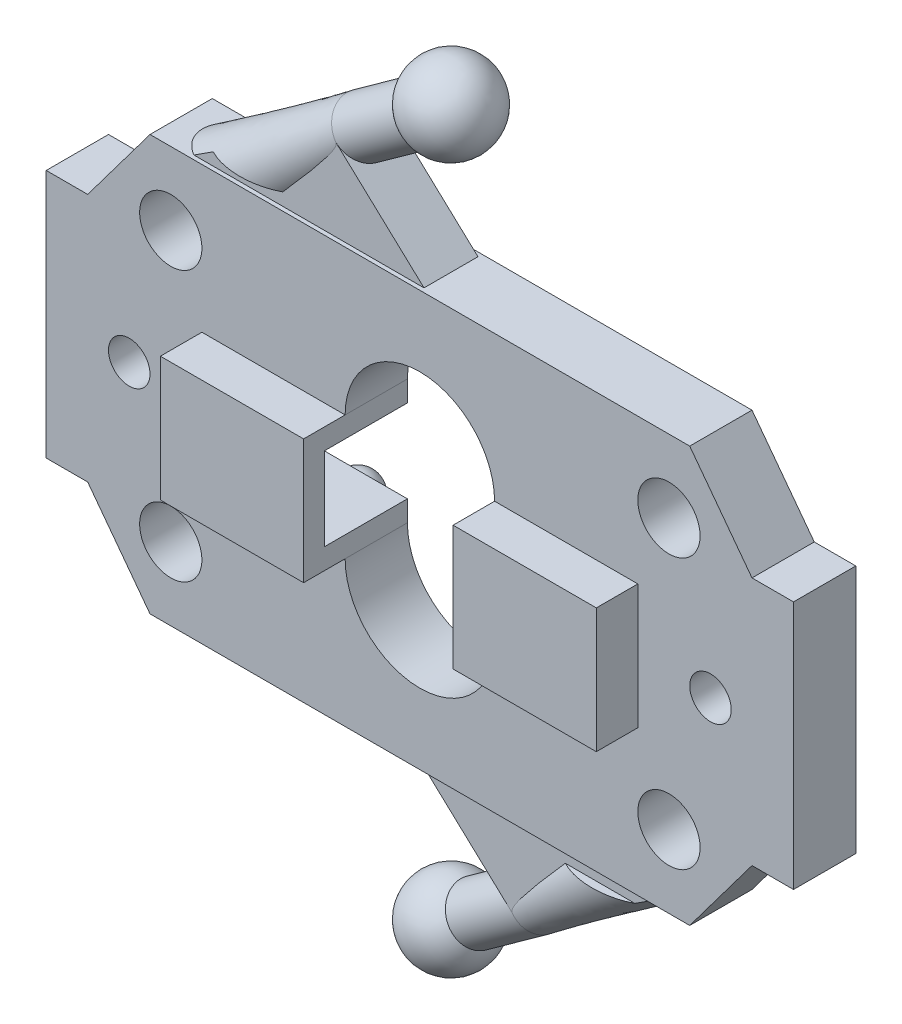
ISO-10303-21;
HEADER;
FILE_DESCRIPTION(('STEP AP214'),'2;1');
FILE_NAME('part.step','',(''),(''),'','','');
FILE_SCHEMA(('AUTOMOTIVE_DESIGN { 1 0 10303 214 1 1 1 1 }'));
ENDSEC;
DATA;
#1=APPLICATION_CONTEXT('core data for automotive mechanical design processes');
#2=APPLICATION_PROTOCOL_DEFINITION('international standard','automotive_design',2000,#1);
#3=PRODUCT_CONTEXT('',#1,'mechanical');
#4=PRODUCT('Part','Part','',(#3));
#5=PRODUCT_RELATED_PRODUCT_CATEGORY('part','',(#4));
#6=PRODUCT_DEFINITION_FORMATION('','',#4);
#7=PRODUCT_DEFINITION_CONTEXT('part definition',#1,'design');
#8=PRODUCT_DEFINITION('design','',#6,#7);
#9=PRODUCT_DEFINITION_SHAPE('','',#8);
#10=(LENGTH_UNIT() NAMED_UNIT(*) SI_UNIT(.MILLI.,.METRE.));
#11=(NAMED_UNIT(*) PLANE_ANGLE_UNIT() SI_UNIT($,.RADIAN.));
#12=(NAMED_UNIT(*) SI_UNIT($,.STERADIAN.) SOLID_ANGLE_UNIT());
#13=UNCERTAINTY_MEASURE_WITH_UNIT(LENGTH_MEASURE(1.E-05),#10,'distance_accuracy_value','');
#14=(GEOMETRIC_REPRESENTATION_CONTEXT(3) GLOBAL_UNCERTAINTY_ASSIGNED_CONTEXT((#13)) GLOBAL_UNIT_ASSIGNED_CONTEXT((#10,
#11,#12)) REPRESENTATION_CONTEXT('',''));
#15=CARTESIAN_POINT('',(0.,0.,0.));
#16=DIRECTION('',(0.,0.,1.));
#17=DIRECTION('',(1.,0.,0.));
#18=AXIS2_PLACEMENT_3D('',#15,#16,#17);
#19=CARTESIAN_POINT('',(9.,0.,-0.75));
#20=DIRECTION('',(0.,0.,1.));
#21=DIRECTION('',(1.,0.,0.));
#22=AXIS2_PLACEMENT_3D('',#19,#20,#21);
#23=PLANE('',#22);
#24=CARTESIAN_POINT('',(-6.,-3.25,-0.75));
#25=DIRECTION('',(0.,0.,1.));
#26=DIRECTION('',(-1.,0.,0.));
#27=AXIS2_PLACEMENT_3D('',#24,#25,#26);
#28=CIRCLE('',#27,0.75);
#29=CARTESIAN_POINT('',(-6.75,-3.25,-0.75));
#30=VERTEX_POINT('',#29);
#31=EDGE_CURVE('E684',#30,#30,#28,.T.);
#32=ORIENTED_EDGE('',*,*,#31,.T.);
#33=EDGE_LOOP('',(#32));
#34=FACE_BOUND('',#33,.T.);
#35=CARTESIAN_POINT('',(-6.,3.25,-0.75));
#36=DIRECTION('',(0.,0.,-1.));
#37=DIRECTION('',(-1.,0.,0.));
#38=AXIS2_PLACEMENT_3D('',#35,#36,#37);
#39=CIRCLE('',#38,0.75);
#40=CARTESIAN_POINT('',(-6.75,3.25,-0.75));
#41=VERTEX_POINT('',#40);
#42=EDGE_CURVE('E772',#41,#41,#39,.T.);
#43=ORIENTED_EDGE('',*,*,#42,.F.);
#44=EDGE_LOOP('',(#43));
#45=FACE_BOUND('',#44,.T.);
#46=CARTESIAN_POINT('',(-7.,0.,-0.75));
#47=DIRECTION('',(0.,0.,-1.));
#48=DIRECTION('',(-1.,0.,0.));
#49=AXIS2_PLACEMENT_3D('',#46,#47,#48);
#50=CIRCLE('',#49,0.500000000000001);
#51=CARTESIAN_POINT('',(-7.5,0.,-0.75));
#52=VERTEX_POINT('',#51);
#53=EDGE_CURVE('E776',#52,#52,#50,.T.);
#54=ORIENTED_EDGE('',*,*,#53,.F.);
#55=EDGE_LOOP('',(#54));
#56=FACE_BOUND('',#55,.T.);
#57=CARTESIAN_POINT('',(6.,-3.25,-0.75));
#58=DIRECTION('',(0.,0.,-1.));
#59=DIRECTION('',(1.,0.,0.));
#60=AXIS2_PLACEMENT_3D('',#57,#58,#59);
#61=CIRCLE('',#60,0.75);
#62=CARTESIAN_POINT('',(6.75,-3.25,-0.75));
#63=VERTEX_POINT('',#62);
#64=EDGE_CURVE('E704',#63,#63,#61,.T.);
#65=ORIENTED_EDGE('',*,*,#64,.F.);
#66=EDGE_LOOP('',(#65));
#67=FACE_BOUND('',#66,.T.);
#68=DIRECTION('',(0.600000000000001,0.799999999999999,0.));
#69=VECTOR('',#68,1.);
#70=CARTESIAN_POINT('',(-6.5,5.,-0.75));
#71=LINE('',#70,#69);
#72=CARTESIAN_POINT('',(-8.,3.,-0.75));
#73=VERTEX_POINT('',#72);
#74=CARTESIAN_POINT('',(-6.5,5.,-0.75));
#75=VERTEX_POINT('',#74);
#76=EDGE_CURVE('E614',#73,#75,#71,.T.);
#77=ORIENTED_EDGE('',*,*,#76,.T.);
#78=DIRECTION('',(-1.,0.,0.));
#79=VECTOR('',#78,1.);
#80=CARTESIAN_POINT('',(0.,5.,-0.75));
#81=LINE('',#80,#79);
#82=CARTESIAN_POINT('',(6.5,5.,-0.75));
#83=VERTEX_POINT('',#82);
#84=EDGE_CURVE('E630',#83,#75,#81,.T.);
#85=ORIENTED_EDGE('',*,*,#84,.F.);
#86=DIRECTION('',(-0.600000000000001,0.799999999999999,0.));
#87=VECTOR('',#86,1.);
#88=CARTESIAN_POINT('',(6.5,5.,-0.75));
#89=LINE('',#88,#87);
#90=CARTESIAN_POINT('',(8.,3.,-0.75));
#91=VERTEX_POINT('',#90);
#92=EDGE_CURVE('E622',#91,#83,#89,.T.);
#93=ORIENTED_EDGE('',*,*,#92,.F.);
#94=DIRECTION('',(-1.,0.,0.));
#95=VECTOR('',#94,1.);
#96=CARTESIAN_POINT('',(8.,3.,-0.75));
#97=LINE('',#96,#95);
#98=CARTESIAN_POINT('',(9.,3.,-0.75));
#99=VERTEX_POINT('',#98);
#100=EDGE_CURVE('E623',#99,#91,#97,.T.);
#101=ORIENTED_EDGE('',*,*,#100,.F.);
#102=DIRECTION('',(0.,1.,0.));
#103=VECTOR('',#102,1.);
#104=CARTESIAN_POINT('',(9.,0.,-0.75));
#105=LINE('',#104,#103);
#106=CARTESIAN_POINT('',(9.,-3.,-0.75));
#107=VERTEX_POINT('',#106);
#108=EDGE_CURVE('E335',#107,#99,#105,.T.);
#109=ORIENTED_EDGE('',*,*,#108,.F.);
#110=DIRECTION('',(-1.,0.,0.));
#111=VECTOR('',#110,1.);
#112=CARTESIAN_POINT('',(8.,-3.,-0.75));
#113=LINE('',#112,#111);
#114=CARTESIAN_POINT('',(8.,-3.,-0.75));
#115=VERTEX_POINT('',#114);
#116=EDGE_CURVE('E725',#107,#115,#113,.T.);
#117=ORIENTED_EDGE('',*,*,#116,.T.);
#118=DIRECTION('',(-0.600000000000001,-0.799999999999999,0.));
#119=VECTOR('',#118,1.);
#120=CARTESIAN_POINT('',(6.5,-5.,-0.75));
#121=LINE('',#120,#119);
#122=CARTESIAN_POINT('',(6.5,-5.,-0.75));
#123=VERTEX_POINT('',#122);
#124=EDGE_CURVE('E722',#115,#123,#121,.T.);
#125=ORIENTED_EDGE('',*,*,#124,.T.);
#126=DIRECTION('',(-1.,0.,0.));
#127=VECTOR('',#126,1.);
#128=CARTESIAN_POINT('',(0.,-5.,-0.75));
#129=LINE('',#128,#127);
#130=CARTESIAN_POINT('',(-6.5,-5.,-0.75));
#131=VERTEX_POINT('',#130);
#132=EDGE_CURVE('E719',#123,#131,#129,.T.);
#133=ORIENTED_EDGE('',*,*,#132,.T.);
#134=DIRECTION('',(0.600000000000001,-0.799999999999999,0.));
#135=VECTOR('',#134,1.);
#136=CARTESIAN_POINT('',(-6.5,-5.,-0.75));
#137=LINE('',#136,#135);
#138=CARTESIAN_POINT('',(-8.,-3.,-0.75));
#139=VERTEX_POINT('',#138);
#140=EDGE_CURVE('E847',#139,#131,#137,.T.);
#141=ORIENTED_EDGE('',*,*,#140,.F.);
#142=DIRECTION('',(1.,0.,0.));
#143=VECTOR('',#142,1.);
#144=CARTESIAN_POINT('',(-8.,-3.,-0.75));
#145=LINE('',#144,#143);
#146=CARTESIAN_POINT('',(-9.,-3.,-0.75));
#147=VERTEX_POINT('',#146);
#148=EDGE_CURVE('E848',#147,#139,#145,.T.);
#149=ORIENTED_EDGE('',*,*,#148,.F.);
#150=DIRECTION('',(0.,1.,0.));
#151=VECTOR('',#150,1.);
#152=CARTESIAN_POINT('',(-9.,0.,-0.75));
#153=LINE('',#152,#151);
#154=CARTESIAN_POINT('',(-9.,3.,-0.75));
#155=VERTEX_POINT('',#154);
#156=EDGE_CURVE('E721',#147,#155,#153,.T.);
#157=ORIENTED_EDGE('',*,*,#156,.T.);
#158=DIRECTION('',(1.,0.,0.));
#159=VECTOR('',#158,1.);
#160=CARTESIAN_POINT('',(-8.,3.,-0.75));
#161=LINE('',#160,#159);
#162=EDGE_CURVE('E793',#155,#73,#161,.T.);
#163=ORIENTED_EDGE('',*,*,#162,.T.);
#164=EDGE_LOOP('',(#77,#85,#93,#101,#109,#117,#125,#133,#141,#149,#157,#163));
#165=FACE_BOUND('',#164,.T.);
#166=CARTESIAN_POINT('',(6.,3.25,-0.75));
#167=DIRECTION('',(0.,0.,1.));
#168=DIRECTION('',(1.,0.,0.));
#169=AXIS2_PLACEMENT_3D('',#166,#167,#168);
#170=CIRCLE('',#169,0.75);
#171=CARTESIAN_POINT('',(6.75,3.25,-0.75));
#172=VERTEX_POINT('',#171);
#173=EDGE_CURVE('E611',#172,#172,#170,.T.);
#174=ORIENTED_EDGE('',*,*,#173,.T.);
#175=EDGE_LOOP('',(#174));
#176=FACE_BOUND('',#175,.T.);
#177=CARTESIAN_POINT('',(7.,0.,-0.75));
#178=DIRECTION('',(0.,0.,1.));
#179=DIRECTION('',(1.,0.,0.));
#180=AXIS2_PLACEMENT_3D('',#177,#178,#179);
#181=CIRCLE('',#180,0.500000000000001);
#182=CARTESIAN_POINT('',(7.5,0.,-0.75));
#183=VERTEX_POINT('',#182);
#184=EDGE_CURVE('E615',#183,#183,#181,.T.);
#185=ORIENTED_EDGE('',*,*,#184,.T.);
#186=EDGE_LOOP('',(#185));
#187=FACE_BOUND('',#186,.T.);
#188=CARTESIAN_POINT('',(0.,1.5,-0.75));
#189=DIRECTION('',(0.,0.,1.));
#190=DIRECTION('',(1.,0.,0.));
#191=AXIS2_PLACEMENT_3D('',#188,#189,#190);
#192=CIRCLE('',#191,1.8);
#193=CARTESIAN_POINT('',(1.8,1.5,-0.75));
#194=VERTEX_POINT('',#193);
#195=CARTESIAN_POINT('',(-1.8,1.5,-0.75));
#196=VERTEX_POINT('',#195);
#197=EDGE_CURVE('E676',#194,#196,#192,.T.);
#198=ORIENTED_EDGE('',*,*,#197,.T.);
#199=DIRECTION('',(0.,1.,0.));
#200=VECTOR('',#199,1.);
#201=CARTESIAN_POINT('',(-1.8,0.,-0.75));
#202=LINE('',#201,#200);
#203=CARTESIAN_POINT('',(-1.8,1.,-0.75));
#204=VERTEX_POINT('',#203);
#205=EDGE_CURVE('E775',#204,#196,#202,.T.);
#206=ORIENTED_EDGE('',*,*,#205,.F.);
#207=DIRECTION('',(-1.,0.,0.));
#208=VECTOR('',#207,1.);
#209=CARTESIAN_POINT('',(-4.,1.,-0.75));
#210=LINE('',#209,#208);
#211=CARTESIAN_POINT('',(-4.,1.,-0.75));
#212=VERTEX_POINT('',#211);
#213=EDGE_CURVE('E678',#204,#212,#210,.T.);
#214=ORIENTED_EDGE('',*,*,#213,.T.);
#215=DIRECTION('',(0.,-1.,0.));
#216=VECTOR('',#215,1.);
#217=CARTESIAN_POINT('',(-4.,0.,-0.75));
#218=LINE('',#217,#216);
#219=CARTESIAN_POINT('',(-4.,-1.,-0.75));
#220=VERTEX_POINT('',#219);
#221=EDGE_CURVE('E831',#212,#220,#218,.T.);
#222=ORIENTED_EDGE('',*,*,#221,.T.);
#223=DIRECTION('',(-1.,0.,0.));
#224=VECTOR('',#223,1.);
#225=CARTESIAN_POINT('',(-4.,-1.,-0.75));
#226=LINE('',#225,#224);
#227=CARTESIAN_POINT('',(-1.8,-1.,-0.75));
#228=VERTEX_POINT('',#227);
#229=EDGE_CURVE('E599',#228,#220,#226,.T.);
#230=ORIENTED_EDGE('',*,*,#229,.F.);
#231=DIRECTION('',(0.,-1.,0.));
#232=VECTOR('',#231,1.);
#233=CARTESIAN_POINT('',(-1.8,0.,-0.75));
#234=LINE('',#233,#232);
#235=CARTESIAN_POINT('',(-1.8,-1.5,-0.75));
#236=VERTEX_POINT('',#235);
#237=EDGE_CURVE('E759',#228,#236,#234,.T.);
#238=ORIENTED_EDGE('',*,*,#237,.T.);
#239=CARTESIAN_POINT('',(0.,-1.5,-0.75));
#240=DIRECTION('',(0.,0.,-1.));
#241=DIRECTION('',(1.,0.,0.));
#242=AXIS2_PLACEMENT_3D('',#239,#240,#241);
#243=CIRCLE('',#242,1.8);
#244=CARTESIAN_POINT('',(1.8,-1.5,-0.75));
#245=VERTEX_POINT('',#244);
#246=EDGE_CURVE('E707',#245,#236,#243,.T.);
#247=ORIENTED_EDGE('',*,*,#246,.F.);
#248=DIRECTION('',(0.,-1.,0.));
#249=VECTOR('',#248,1.);
#250=CARTESIAN_POINT('',(1.8,0.,-0.75));
#251=LINE('',#250,#249);
#252=CARTESIAN_POINT('',(1.8,-1.,-0.75));
#253=VERTEX_POINT('',#252);
#254=EDGE_CURVE('E610',#253,#245,#251,.T.);
#255=ORIENTED_EDGE('',*,*,#254,.F.);
#256=DIRECTION('',(1.,0.,0.));
#257=VECTOR('',#256,1.);
#258=CARTESIAN_POINT('',(4.,-1.,-0.75));
#259=LINE('',#258,#257);
#260=CARTESIAN_POINT('',(4.,-1.,-0.75));
#261=VERTEX_POINT('',#260);
#262=EDGE_CURVE('E681',#253,#261,#259,.T.);
#263=ORIENTED_EDGE('',*,*,#262,.T.);
#264=DIRECTION('',(0.,-1.,0.));
#265=VECTOR('',#264,1.);
#266=CARTESIAN_POINT('',(4.,0.,-0.75));
#267=LINE('',#266,#265);
#268=CARTESIAN_POINT('',(4.,1.,-0.75));
#269=VERTEX_POINT('',#268);
#270=EDGE_CURVE('E691',#269,#261,#267,.T.);
#271=ORIENTED_EDGE('',*,*,#270,.F.);
#272=DIRECTION('',(1.,0.,0.));
#273=VECTOR('',#272,1.);
#274=CARTESIAN_POINT('',(4.,1.,-0.75));
#275=LINE('',#274,#273);
#276=CARTESIAN_POINT('',(1.8,1.,-0.75));
#277=VERTEX_POINT('',#276);
#278=EDGE_CURVE('E692',#277,#269,#275,.T.);
#279=ORIENTED_EDGE('',*,*,#278,.F.);
#280=DIRECTION('',(0.,1.,0.));
#281=VECTOR('',#280,1.);
#282=CARTESIAN_POINT('',(1.8,0.,-0.75));
#283=LINE('',#282,#281);
#284=EDGE_CURVE('E618',#277,#194,#283,.T.);
#285=ORIENTED_EDGE('',*,*,#284,.T.);
#286=EDGE_LOOP('',(#198,#206,#214,#222,#230,#238,#247,#255,#263,#271,#279,#285));
#287=FACE_BOUND('',#286,.T.);
#288=CARTESIAN_POINT('',(-3.50000000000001,-1.99999999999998,-0.75));
#289=DIRECTION('',(0.,0.,1.));
#290=DIRECTION('',(1.,0.,0.));
#291=AXIS2_PLACEMENT_3D('',#288,#289,#290);
#292=CIRCLE('',#291,0.5);
#293=CARTESIAN_POINT('',(-3.00000000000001,-1.99999999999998,-0.75));
#294=VERTEX_POINT('',#293);
#295=EDGE_CURVE('E13',#294,#294,#292,.F.);
#296=ORIENTED_EDGE('',*,*,#295,.F.);
#297=EDGE_LOOP('',(#296));
#298=FACE_BOUND('',#297,.T.);
#299=ADVANCED_FACE('F60',(#34,#45,#56,#67,#165,#176,#187,#287,#298),#23,.F.);
#300=CARTESIAN_POINT('',(0.,5.,0.75));
#301=DIRECTION('',(0.,-1.,0.));
#302=DIRECTION('',(0.,0.,-1.));
#303=AXIS2_PLACEMENT_3D('',#300,#301,#302);
#304=PLANE('',#303);
#305=DIRECTION('',(1.,0.,0.));
#306=VECTOR('',#305,1.);
#307=CARTESIAN_POINT('',(0.,5.,0.65));
#308=LINE('',#307,#306);
#309=CARTESIAN_POINT('',(-5.54327761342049,5.,0.65));
#310=VERTEX_POINT('',#309);
#311=CARTESIAN_POINT('',(0.,5.,0.65));
#312=VERTEX_POINT('',#311);
#313=EDGE_CURVE('E882',#310,#312,#308,.T.);
#314=ORIENTED_EDGE('',*,*,#313,.F.);
#315=CARTESIAN_POINT('',(-5.27958345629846,5.,0.772948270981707));
#316=CARTESIAN_POINT('',(-5.3177465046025,4.99999999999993,0.759250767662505));
#317=CARTESIAN_POINT('',(-5.35543810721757,4.99999999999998,0.744238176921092));
#318=CARTESIAN_POINT('',(-5.42962618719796,5.00000000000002,0.71124945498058));
#319=CARTESIAN_POINT('',(-5.46611948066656,5.,0.693266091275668));
#320=CARTESIAN_POINT('',(-5.53226376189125,4.99999999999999,0.656992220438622));
#321=CARTESIAN_POINT('',(-5.56214255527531,5.,0.639119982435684));
#322=CARTESIAN_POINT('',(-5.62034422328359,5.,0.601003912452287));
#323=CARTESIAN_POINT('',(-5.64866639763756,5.,0.580759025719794));
#324=CARTESIAN_POINT('',(-5.7304851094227,5.,0.516277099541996));
#325=CARTESIAN_POINT('',(-5.78113018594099,5.,0.468137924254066));
#326=CARTESIAN_POINT('',(-5.8496047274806,5.,0.385199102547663));
#327=CARTESIAN_POINT('',(-5.87195978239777,5.,0.354111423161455));
#328=CARTESIAN_POINT('',(-5.91149571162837,5.,0.288758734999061));
#329=CARTESIAN_POINT('',(-5.92867900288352,5.,0.254495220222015));
#330=CARTESIAN_POINT('',(-5.95693166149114,5.,0.183121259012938));
#331=CARTESIAN_POINT('',(-5.96794174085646,5.,0.145986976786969));
#332=CARTESIAN_POINT('',(-5.98252293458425,5.,0.070301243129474));
#333=CARTESIAN_POINT('',(-5.98610585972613,5.,0.0317521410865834));
#334=CARTESIAN_POINT('',(-5.98537929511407,5.,-0.0404278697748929));
#335=CARTESIAN_POINT('',(-5.98200331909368,5.,-0.0740692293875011));
#336=CARTESIAN_POINT('',(-5.96929634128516,5.,-0.140212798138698));
#337=CARTESIAN_POINT('',(-5.95995998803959,5.,-0.172713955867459));
#338=CARTESIAN_POINT('',(-5.93390783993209,5.,-0.242341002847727));
#339=CARTESIAN_POINT('',(-5.91606797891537,5.,-0.279040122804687));
#340=CARTESIAN_POINT('',(-5.87469437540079,5.,-0.349053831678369));
#341=CARTESIAN_POINT('',(-5.85115337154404,5.,-0.382364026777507));
#342=CARTESIAN_POINT('',(-5.79058135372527,5.,-0.456355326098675));
#343=CARTESIAN_POINT('',(-5.75171362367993,5.,-0.495530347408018));
#344=CARTESIAN_POINT('',(-5.66818983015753,5.,-0.567109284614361));
#345=CARTESIAN_POINT('',(-5.62352257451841,5.,-0.599499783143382));
#346=CARTESIAN_POINT('',(-5.54078448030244,5.,-0.651844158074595));
#347=CARTESIAN_POINT('',(-5.50343300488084,5.,-0.672965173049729));
#348=CARTESIAN_POINT('',(-5.42704935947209,5.,-0.711927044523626));
#349=CARTESIAN_POINT('',(-5.38801634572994,5.,-0.729766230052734));
#350=CARTESIAN_POINT('',(-5.26893930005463,5.,-0.778734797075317));
#351=CARTESIAN_POINT('',(-5.18696701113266,5.,-0.805285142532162));
#352=CARTESIAN_POINT('',(-5.04722690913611,5.,-0.840057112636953));
#353=CARTESIAN_POINT('',(-4.99019291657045,5.,-0.851428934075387));
#354=CARTESIAN_POINT('',(-4.87532992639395,5.,-0.869302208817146));
#355=CARTESIAN_POINT('',(-4.81750051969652,5.,-0.87580105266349));
#356=CARTESIAN_POINT('',(-4.70140476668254,5.,-0.884112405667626));
#357=CARTESIAN_POINT('',(-4.64313780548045,5.,-0.885916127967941));
#358=CARTESIAN_POINT('',(-4.5266480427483,5.,-0.884824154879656));
#359=CARTESIAN_POINT('',(-4.46842523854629,5.,-0.881928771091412));
#360=CARTESIAN_POINT('',(-4.35188458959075,5.,-0.871242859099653));
#361=CARTESIAN_POINT('',(-4.2935708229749,5.,-0.863407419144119));
#362=CARTESIAN_POINT('',(-4.17780939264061,5.,-0.842679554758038));
#363=CARTESIAN_POINT('',(-4.12036217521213,5.,-0.829784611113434));
#364=CARTESIAN_POINT('',(-4.00715736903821,5.,-0.798678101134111));
#365=CARTESIAN_POINT('',(-3.95139398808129,5.,-0.780487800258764));
#366=CARTESIAN_POINT('',(-3.84209028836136,5.,-0.73843401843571));
#367=CARTESIAN_POINT('',(-3.78854728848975,5.,-0.714577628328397));
#368=CARTESIAN_POINT('',(-3.68773322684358,5.,-0.662012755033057));
#369=CARTESIAN_POINT('',(-3.64027859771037,5.,-0.633659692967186));
#370=CARTESIAN_POINT('',(-3.54954237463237,5.,-0.570869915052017));
#371=CARTESIAN_POINT('',(-3.5062568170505,5.,-0.536439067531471));
#372=CARTESIAN_POINT('',(-3.43365005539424,5.,-0.468006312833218));
#373=CARTESIAN_POINT('',(-3.40323936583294,5.,-0.435171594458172));
#374=CARTESIAN_POINT('',(-3.34799200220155,4.99999999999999,-0.365093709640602));
#375=CARTESIAN_POINT('',(-3.32314671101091,4.99999999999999,-0.32785749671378));
#376=CARTESIAN_POINT('',(-3.28570618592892,5.00000000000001,-0.258146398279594));
#377=CARTESIAN_POINT('',(-3.27161223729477,5.00000000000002,-0.226488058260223));
#378=CARTESIAN_POINT('',(-3.25453744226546,4.99999999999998,-0.177614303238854));
#379=CARTESIAN_POINT('',(-3.24952408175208,4.99999999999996,-0.161095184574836));
#380=CARTESIAN_POINT('',(-3.24092822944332,5.00000000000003,-0.127672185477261));
#381=CARTESIAN_POINT('',(-3.23734704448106,5.00000000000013,-0.110767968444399));
#382=CARTESIAN_POINT('',(-3.22891088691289,5.00000000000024,-0.05953367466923));
#383=CARTESIAN_POINT('',(-3.22640150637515,5.00000000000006,-0.0247885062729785));
#384=CARTESIAN_POINT('',(-3.22766595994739,4.99999999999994,0.0445887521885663));
#385=CARTESIAN_POINT('',(-3.23144144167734,4.99999999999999,0.0792208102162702));
#386=CARTESIAN_POINT('',(-3.2413870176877,5.,0.12913595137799));
#387=CARTESIAN_POINT('',(-3.24521728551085,5.,0.144918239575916));
#388=CARTESIAN_POINT('',(-3.25412623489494,5.,0.17610909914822));
#389=CARTESIAN_POINT('',(-3.25920337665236,5.,0.191518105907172));
#390=CARTESIAN_POINT('',(-3.27055698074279,5.,0.221900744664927));
#391=CARTESIAN_POINT('',(-3.27683440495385,5.,0.236874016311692));
#392=CARTESIAN_POINT('',(-3.29050361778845,5.,0.266305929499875));
#393=CARTESIAN_POINT('',(-3.29789592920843,5.,0.280764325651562));
#394=CARTESIAN_POINT('',(-3.32830935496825,5.,0.33557066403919));
#395=CARTESIAN_POINT('',(-3.35481164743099,5.,0.374020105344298));
#396=CARTESIAN_POINT('',(-3.41353044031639,5.,0.446268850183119));
#397=CARTESIAN_POINT('',(-3.44575953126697,5.,0.480057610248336));
#398=CARTESIAN_POINT('',(-3.50480680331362,5.,0.53385317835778));
#399=CARTESIAN_POINT('',(-3.53055874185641,5.,0.555047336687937));
#400=CARTESIAN_POINT('',(-3.58387994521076,5.,0.595033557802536));
#401=CARTESIAN_POINT('',(-3.61145042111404,5.,0.613823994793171));
#402=CARTESIAN_POINT('',(-3.66795901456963,5.,0.649282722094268));
#403=CARTESIAN_POINT('',(-3.69689878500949,5.,0.665948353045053));
#404=CARTESIAN_POINT('',(-3.75582919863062,5.,0.697278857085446));
#405=CARTESIAN_POINT('',(-3.78581969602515,5.,0.711944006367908));
#406=CARTESIAN_POINT('',(-3.8616625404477,5.,0.746131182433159));
#407=CARTESIAN_POINT('',(-3.90804684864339,5.,0.764484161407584));
#408=CARTESIAN_POINT('',(-4.00227910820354,5.,0.796959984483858));
#409=CARTESIAN_POINT('',(-4.05012775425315,5.,0.81108078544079));
#410=CARTESIAN_POINT('',(-4.14682265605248,5.,0.835561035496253));
#411=CARTESIAN_POINT('',(-4.19566991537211,4.99999999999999,0.845916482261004));
#412=CARTESIAN_POINT('',(-4.29396251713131,5.,0.863067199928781));
#413=CARTESIAN_POINT('',(-4.34340778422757,5.00000000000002,0.869862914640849));
#414=CARTESIAN_POINT('',(-4.49629367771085,4.99999999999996,0.885331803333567));
#415=CARTESIAN_POINT('',(-4.60041460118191,4.99999999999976,0.888115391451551));
#416=CARTESIAN_POINT('',(-4.75584946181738,5.00000000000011,0.881004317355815));
#417=CARTESIAN_POINT('',(-4.80750994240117,5.00000000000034,0.876758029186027));
#418=CARTESIAN_POINT('',(-4.91037522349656,4.99999999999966,0.864455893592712));
#419=CARTESIAN_POINT('',(-4.96158019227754,4.99999999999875,0.856401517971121));
#420=CARTESIAN_POINT('',(-5.05777532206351,4.99999999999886,0.837417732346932));
#421=CARTESIAN_POINT('',(-5.10284449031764,4.9999999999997,0.82688790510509));
#422=CARTESIAN_POINT('',(-5.19200683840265,5.0000000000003,0.802454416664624));
#423=CARTESIAN_POINT('',(-5.23610116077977,5.00000000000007,0.788554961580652));
#424=CARTESIAN_POINT('',(-5.27958345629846,5.,0.772948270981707));
#425=B_SPLINE_CURVE_WITH_KNOTS('',3,(#315,#316,#317,#318,#319,#320,#321,#322,#323,#324,#325,
#326,#327,#328,#329,#330,#331,#332,#333,#334,#335,#336,#337,#338,#339,#340,#341,#342,#343,#344,
#345,#346,#347,#348,#349,#350,#351,#352,#353,#354,#355,#356,#357,#358,#359,#360,#361,#362,#363,
#364,#365,#366,#367,#368,#369,#370,#371,#372,#373,#374,#375,#376,#377,#378,#379,#380,#381,#382,
#383,#384,#385,#386,#387,#388,#389,#390,#391,#392,#393,#394,#395,#396,#397,#398,#399,#400,#401,
#402,#403,#404,#405,#406,#407,#408,#409,#410,#411,#412,#413,#414,#415,#416,#417,#418,#419,#420,
#421,#422,#423,#424),.UNSPECIFIED.,.T.,.F.,(4,2,2,2,2,2,2,2,2,2,2,2,2,2,2,2,2,2,2,2,2,2,2,2,2,2,
2,2,2,2,2,2,2,2,2,2,2,2,2,2,2,2,2,2,2,2,2,2,2,2,2,2,2,2,4),(0.,0.121608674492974,
0.243517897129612,0.347846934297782,0.452222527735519,0.659982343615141,0.774482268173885,
0.88892859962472,1.00445603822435,1.11979962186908,1.22067669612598,1.32164446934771,
1.44341442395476,1.56534029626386,1.72998150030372,1.89494529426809,2.02350764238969,
2.15213526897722,2.40956296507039,2.58384349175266,2.75821727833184,2.93291716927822,
3.10760547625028,3.28390529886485,3.46029301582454,3.63598193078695,3.81145212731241,
3.97688943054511,4.14216786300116,4.27596859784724,4.40956070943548,4.5130638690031,
4.5647963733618,4.61657597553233,4.7204697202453,4.82439070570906,4.87306884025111,
4.92168716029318,4.97034460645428,5.01902494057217,5.15830788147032,5.29790091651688,
5.39781197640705,5.49779025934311,5.59789246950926,5.69798084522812,5.84740381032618,
5.99689879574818,6.14655222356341,6.29618698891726,6.60731878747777,6.76272285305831,
6.91806690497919,7.05679794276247,7.19535669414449),.UNSPECIFIED.);
#426=CARTESIAN_POINT('',(-5.54254084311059,5.,-0.65));
#427=VERTEX_POINT('',#426);
#428=EDGE_CURVE('E96',#310,#427,#425,.T.);
#429=ORIENTED_EDGE('',*,*,#428,.T.);
#430=DIRECTION('',(1.,0.,0.));
#431=VECTOR('',#430,1.);
#432=CARTESIAN_POINT('',(0.,5.,-0.65));
#433=LINE('',#432,#431);
#434=CARTESIAN_POINT('',(0.,5.,-0.65));
#435=VERTEX_POINT('',#434);
#436=EDGE_CURVE('E633',#427,#435,#433,.T.);
#437=ORIENTED_EDGE('',*,*,#436,.T.);
#438=DIRECTION('',(0.,0.,-1.));
#439=VECTOR('',#438,1.);
#440=CARTESIAN_POINT('',(0.,5.,0.65));
#441=LINE('',#440,#439);
#442=EDGE_CURVE('E308',#312,#435,#441,.T.);
#443=ORIENTED_EDGE('',*,*,#442,.F.);
#444=EDGE_LOOP('',(#314,#429,#437,#443));
#445=FACE_BOUND('',#444,.T.);
#446=ORIENTED_EDGE('',*,*,#84,.T.);
#447=DIRECTION('',(0.,0.,-1.));
#448=VECTOR('',#447,1.);
#449=CARTESIAN_POINT('',(-6.5,5.,0.75));
#450=LINE('',#449,#448);
#451=CARTESIAN_POINT('',(-6.5,5.,0.75));
#452=VERTEX_POINT('',#451);
#453=EDGE_CURVE('E788',#452,#75,#450,.T.);
#454=ORIENTED_EDGE('',*,*,#453,.F.);
#455=DIRECTION('',(-1.,0.,0.));
#456=VECTOR('',#455,1.);
#457=CARTESIAN_POINT('',(0.,5.,0.75));
#458=LINE('',#457,#456);
#459=CARTESIAN_POINT('',(6.5,5.,0.75));
#460=VERTEX_POINT('',#459);
#461=EDGE_CURVE('E639',#460,#452,#458,.T.);
#462=ORIENTED_EDGE('',*,*,#461,.F.);
#463=DIRECTION('',(0.,0.,-1.));
#464=VECTOR('',#463,1.);
#465=CARTESIAN_POINT('',(6.5,5.,0.75));
#466=LINE('',#465,#464);
#467=EDGE_CURVE('E628',#460,#83,#466,.T.);
#468=ORIENTED_EDGE('',*,*,#467,.T.);
#469=EDGE_LOOP('',(#446,#454,#462,#468));
#470=FACE_BOUND('',#469,.T.);
#471=ADVANCED_FACE('F418',(#445,#470),#304,.F.);
#472=CARTESIAN_POINT('',(-2.12325090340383,6.97460849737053,-0.65));
#473=DIRECTION('',(0.,0.,-1.));
#474=DIRECTION('',(-1.,0.,0.));
#475=AXIS2_PLACEMENT_3D('',#472,#473,#474);
#476=PLANE('',#475);
#477=ORIENTED_EDGE('',*,*,#436,.F.);
#478=CARTESIAN_POINT('',(-5.07537340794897,5.3,-0.65));
#479=CARTESIAN_POINT('',(-5.2075616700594,5.21529699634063,-0.650000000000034));
#480=CARTESIAN_POINT('',(-5.33967962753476,5.1304846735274,-0.650000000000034));
#481=CARTESIAN_POINT('',(-5.60377493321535,4.9606413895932,-0.649999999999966));
#482=CARTESIAN_POINT('',(-5.73575228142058,4.87561042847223,-0.649999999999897));
#483=CARTESIAN_POINT('',(-5.86765932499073,4.7904701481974,-0.649999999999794));
#484=B_SPLINE_CURVE_WITH_KNOTS('',3,(#478,#479,#480,#481,#482,#483),.UNSPECIFIED.,.F.,.F.,(4,2,
4),(0.,0.470993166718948,0.941986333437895),.UNSPECIFIED.);
#485=CARTESIAN_POINT('',(-5.07537340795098,5.3,-0.65));
#486=VERTEX_POINT('',#485);
#487=EDGE_CURVE('E84',#427,#486,#484,.F.);
#488=ORIENTED_EDGE('',*,*,#487,.T.);
#489=DIRECTION('',(1.,0.,0.));
#490=VECTOR('',#489,1.);
#491=CARTESIAN_POINT('',(-9.,5.3,-0.65));
#492=LINE('',#491,#490);
#493=CARTESIAN_POINT('',(-3.40261259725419,5.3,-0.65));
#494=VERTEX_POINT('',#493);
#495=EDGE_CURVE('E68',#486,#494,#492,.T.);
#496=ORIENTED_EDGE('',*,*,#495,.T.);
#497=CARTESIAN_POINT('',(-2.13799874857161,6.98645614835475,-0.65));
#498=CARTESIAN_POINT('',(-2.13587848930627,6.98550823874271,-0.65));
#499=CARTESIAN_POINT('',(-2.13383423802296,6.98436997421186,-0.65));
#500=CARTESIAN_POINT('',(-2.13000467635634,6.98173884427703,-0.65));
#501=CARTESIAN_POINT('',(-2.12821815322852,6.98024773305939,-0.65));
#502=CARTESIAN_POINT('',(-2.12497517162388,6.9769137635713,-0.65));
#503=CARTESIAN_POINT('',(-2.12352154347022,6.9750681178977,-0.650000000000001));
#504=CARTESIAN_POINT('',(-2.12102051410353,6.97112488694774,-0.649999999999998));
#505=CARTESIAN_POINT('',(-2.11997287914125,6.96902744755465,-0.649999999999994));
#506=CARTESIAN_POINT('',(-2.11717307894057,6.96191610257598,-0.649999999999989));
#507=CARTESIAN_POINT('',(-2.11622618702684,6.9565939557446,-0.649999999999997));
#508=CARTESIAN_POINT('',(-2.11561298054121,6.94636828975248,-0.650000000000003));
#509=CARTESIAN_POINT('',(-2.11585412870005,6.9414639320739,-0.650000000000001));
#510=CARTESIAN_POINT('',(-2.1169786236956,6.93171842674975,-0.649999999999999));
#511=CARTESIAN_POINT('',(-2.11786392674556,6.9268775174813,-0.65));
#512=CARTESIAN_POINT('',(-2.12131645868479,6.91171651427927,-0.650000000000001));
#513=CARTESIAN_POINT('',(-2.12464174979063,6.90158072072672,-0.65));
#514=CARTESIAN_POINT('',(-2.13220363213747,6.88168058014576,-0.65));
#515=CARTESIAN_POINT('',(-2.13644100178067,6.87191655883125,-0.65));
#516=CARTESIAN_POINT('',(-2.14552043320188,6.8525636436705,-0.65));
#517=CARTESIAN_POINT('',(-2.15036772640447,6.84297720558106,-0.65));
#518=CARTESIAN_POINT('',(-2.1604349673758,6.82401881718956,-0.65));
#519=CARTESIAN_POINT('',(-2.16565451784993,6.81464665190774,-0.65));
#520=CARTESIAN_POINT('',(-2.18151815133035,6.7871034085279,-0.649999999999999));
#521=CARTESIAN_POINT('',(-2.19254431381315,6.76915302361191,-0.65));
#522=CARTESIAN_POINT('',(-2.21521170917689,6.73364305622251,-0.65));
#523=CARTESIAN_POINT('',(-2.22685316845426,6.71608362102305,-0.65));
#524=CARTESIAN_POINT('',(-2.26242338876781,6.66378344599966,-0.65));
#525=CARTESIAN_POINT('',(-2.28697104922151,6.62946478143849,-0.65));
#526=CARTESIAN_POINT('',(-2.3368322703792,6.5616900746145,-0.65));
#527=CARTESIAN_POINT('',(-2.36214087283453,6.52823032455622,-0.65));
#528=CARTESIAN_POINT('',(-2.41337396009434,6.46182495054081,-0.65));
#529=CARTESIAN_POINT('',(-2.43929798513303,6.42887897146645,-0.65));
#530=CARTESIAN_POINT('',(-2.5132497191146,6.33610122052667,-0.649999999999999));
#531=CARTESIAN_POINT('',(-2.56176046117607,6.2766559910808,-0.65));
#532=CARTESIAN_POINT('',(-2.65958863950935,6.15840836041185,-0.65));
#533=CARTESIAN_POINT('',(-2.70890630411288,6.0996061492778,-0.65));
#534=CARTESIAN_POINT('',(-2.80814906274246,5.98238536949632,-0.65));
#535=CARTESIAN_POINT('',(-2.85807486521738,5.92396740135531,-0.65));
#536=CARTESIAN_POINT('',(-2.95829601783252,5.80745936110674,-0.65));
#537=CARTESIAN_POINT('',(-3.00859133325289,5.74936925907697,-0.649999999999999));
#538=CARTESIAN_POINT('',(-3.10950859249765,5.63337446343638,-0.649999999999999));
#539=CARTESIAN_POINT('',(-3.16013080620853,5.57547000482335,-0.65));
#540=CARTESIAN_POINT('',(-3.26157627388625,5.45983432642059,-0.65));
#541=CARTESIAN_POINT('',(-3.3123995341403,5.40210311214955,-0.65));
#542=CARTESIAN_POINT('',(-3.41415037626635,5.28689945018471,-0.65));
#543=CARTESIAN_POINT('',(-3.4650776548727,5.22942673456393,-0.65));
#544=CARTESIAN_POINT('',(-3.56708238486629,5.11461844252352,-0.65));
#545=CARTESIAN_POINT('',(-3.61815983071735,5.05728286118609,-0.65));
#546=CARTESIAN_POINT('',(-3.66929611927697,5.,-0.65));
#547=B_SPLINE_CURVE_WITH_KNOTS('',3,(#497,#498,#499,#500,#501,#502,#503,#504,#505,#506,#507,
#508,#509,#510,#511,#512,#513,#514,#515,#516,#517,#518,#519,#520,#521,#522,#523,#524,#525,#526,
#527,#528,#529,#530,#531,#532,#533,#534,#535,#536,#537,#538,#539,#540,#541,#542,#543,#544,#545,
#546),.UNSPECIFIED.,.F.,.F.,(4,2,2,2,2,2,2,2,2,2,2,2,2,2,2,2,2,2,2,2,2,2,2,2,4),(0.,
0.00697196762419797,0.0139099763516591,0.0209049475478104,0.0278958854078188,0.0438020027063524,
0.0584896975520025,0.0732221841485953,0.105111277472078,0.137027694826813,0.169239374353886,
0.201417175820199,0.264591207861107,0.327788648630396,0.454337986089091,0.580190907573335,
0.705952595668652,0.936120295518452,1.16635429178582,1.39688861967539,1.62740155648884,
1.85813847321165,2.0888826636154,2.31925229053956,2.54961352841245),.UNSPECIFIED.);
#548=CARTESIAN_POINT('',(-2.12333494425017,6.97471231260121,-0.649999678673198));
#549=VERTEX_POINT('',#548);
#550=EDGE_CURVE('E318',#549,#494,#547,.T.);
#551=ORIENTED_EDGE('',*,*,#550,.F.);
#552=DIRECTION('',(-0.732274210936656,0.681009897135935,0.));
#553=VECTOR('',#552,1.);
#554=CARTESIAN_POINT('',(-2.12325090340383,6.97460849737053,-0.65));
#555=LINE('',#554,#553);
#556=EDGE_CURVE('E302',#435,#549,#555,.T.);
#557=ORIENTED_EDGE('',*,*,#556,.F.);
#558=EDGE_LOOP('',(#477,#488,#496,#551,#557));
#559=FACE_BOUND('',#558,.T.);
#560=ADVANCED_FACE('F319',(#559),#476,.T.);
#561=CARTESIAN_POINT('',(-5.71561855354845,4.62388709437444,0.843653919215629));
#562=CARTESIAN_POINT('',(-2.4550141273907,7.43640244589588,0.31492778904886));
#563=CARTESIAN_POINT('',(-5.67459864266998,4.56678990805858,0.888394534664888));
#564=CARTESIAN_POINT('',(-2.43970179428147,7.41508862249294,0.362312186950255));
#565=CARTESIAN_POINT('',(-5.62502262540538,4.49778314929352,0.930456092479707));
#566=CARTESIAN_POINT('',(-2.4190186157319,7.3862989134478,0.412722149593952));
#567=CARTESIAN_POINT('',(-5.50550046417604,4.33141567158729,0.990016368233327));
#568=CARTESIAN_POINT('',(-2.36156970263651,7.30633356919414,0.510362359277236));
#569=CARTESIAN_POINT('',(-5.43519035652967,4.23354833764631,1.00727989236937));
#570=CARTESIAN_POINT('',(-2.32455352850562,7.25480933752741,0.557652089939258));
#571=CARTESIAN_POINT('',(-5.28005895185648,4.01761498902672,0.986831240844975));
#572=CARTESIAN_POINT('',(-2.23227183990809,7.12635891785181,0.628567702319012));
#573=CARTESIAN_POINT('',(-5.19514317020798,3.89941745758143,0.947874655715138));
#574=CARTESIAN_POINT('',(-2.17672683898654,7.04904370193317,0.651533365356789));
#575=CARTESIAN_POINT('',(-5.03575766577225,3.67756266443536,0.793600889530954));
#576=CARTESIAN_POINT('',(-2.05776153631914,6.88345133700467,0.648303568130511));
#577=CARTESIAN_POINT('',(-4.96233570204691,3.57536381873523,0.677496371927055));
#578=CARTESIAN_POINT('',(-1.99479677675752,6.79580827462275,0.621100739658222));
#579=CARTESIAN_POINT('',(-4.85791813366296,3.43002100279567,0.396278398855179));
#580=CARTESIAN_POINT('',(-1.88420903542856,6.64187695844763,0.516124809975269));
#581=CARTESIAN_POINT('',(-4.82764514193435,3.3878828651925,0.233111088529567));
#582=CARTESIAN_POINT('',(-1.83735136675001,6.57665397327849,0.439078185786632));
#583=CARTESIAN_POINT('',(-4.81360354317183,3.36833782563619,-0.0796899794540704));
#584=CARTESIAN_POINT('',(-1.7726415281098,6.48658186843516,0.267953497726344));
#585=CARTESIAN_POINT('',(-4.82897505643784,3.38973402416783,-0.22803040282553));
#586=CARTESIAN_POINT('',(-1.754532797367,6.4613756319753,0.175071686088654));
#587=CARTESIAN_POINT('',(-4.88386559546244,3.46613826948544,-0.477551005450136));
#588=CARTESIAN_POINT('',(-1.74065025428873,6.44205198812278,0.00337918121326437));
#589=CARTESIAN_POINT('',(-4.92276689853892,3.5202864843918,-0.579404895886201));
#590=CARTESIAN_POINT('',(-1.74440163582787,6.44727367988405,-0.0754873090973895));
#591=CARTESIAN_POINT('',(-5.00486580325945,3.63456309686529,-0.739753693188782));
#592=CARTESIAN_POINT('',(-1.76221590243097,6.47207004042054,-0.210750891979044));
#593=CARTESIAN_POINT('',(-5.04809323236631,3.69473301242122,-0.798913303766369));
#594=CARTESIAN_POINT('',(-1.77617534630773,6.49150072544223,-0.267543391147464));
#595=CARTESIAN_POINT('',(-5.13013305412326,3.80892738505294,-0.888394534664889));
#596=CARTESIAN_POINT('',(-1.80680001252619,6.53412837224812,-0.362312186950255));
#597=CARTESIAN_POINT('',(-5.17970907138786,3.87793414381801,-0.930456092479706));
#598=CARTESIAN_POINT('',(-1.82748319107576,6.56291808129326,-0.412722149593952));
#599=CARTESIAN_POINT('',(-5.2992312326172,4.04430162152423,-0.990016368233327));
#600=CARTESIAN_POINT('',(-1.88493210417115,6.64288342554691,-0.510362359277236));
#601=CARTESIAN_POINT('',(-5.36954134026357,4.14216895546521,-1.00727989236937));
#602=CARTESIAN_POINT('',(-1.92194827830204,6.69440765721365,-0.557652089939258));
#603=CARTESIAN_POINT('',(-5.52467274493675,4.3581023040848,-0.986831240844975));
#604=CARTESIAN_POINT('',(-2.01422996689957,6.82285807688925,-0.628567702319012));
#605=CARTESIAN_POINT('',(-5.60958852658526,4.4762998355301,-0.947874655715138));
#606=CARTESIAN_POINT('',(-2.06977496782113,6.90017329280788,-0.651533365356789));
#607=CARTESIAN_POINT('',(-5.76897403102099,4.69815462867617,-0.793600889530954));
#608=CARTESIAN_POINT('',(-2.18874027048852,7.06576565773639,-0.648303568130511));
#609=CARTESIAN_POINT('',(-5.84239599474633,4.8003534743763,-0.677496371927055));
#610=CARTESIAN_POINT('',(-2.25170503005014,7.15340872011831,-0.621100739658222));
#611=CARTESIAN_POINT('',(-5.94681356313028,4.94569629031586,-0.396278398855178));
#612=CARTESIAN_POINT('',(-2.36229277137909,7.30734003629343,-0.516124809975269));
#613=CARTESIAN_POINT('',(-5.97708655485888,4.98783442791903,-0.233111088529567));
#614=CARTESIAN_POINT('',(-2.40915044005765,7.37256302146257,-0.439078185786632));
#615=CARTESIAN_POINT('',(-5.9911281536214,5.00737946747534,0.0796899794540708));
#616=CARTESIAN_POINT('',(-2.47386027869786,7.46263512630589,-0.267953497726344));
#617=CARTESIAN_POINT('',(-5.9757566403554,4.9859832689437,0.228030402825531));
#618=CARTESIAN_POINT('',(-2.49196900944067,7.48784136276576,-0.175071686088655));
#619=CARTESIAN_POINT('',(-5.9208661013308,4.90957902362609,0.477551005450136));
#620=CARTESIAN_POINT('',(-2.50585155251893,7.50716500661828,-0.00337918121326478));
#621=CARTESIAN_POINT('',(-5.88196479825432,4.85543080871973,0.579404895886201));
#622=CARTESIAN_POINT('',(-2.50210017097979,7.50194331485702,0.075487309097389));
#623=CARTESIAN_POINT('',(-5.79986589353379,4.74115419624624,0.739753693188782));
#624=CARTESIAN_POINT('',(-2.48428590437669,7.47714695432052,0.210750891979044));
#625=CARTESIAN_POINT('',(-5.75663846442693,4.6809842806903,0.798913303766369));
#626=CARTESIAN_POINT('',(-2.47032646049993,7.45771626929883,0.267543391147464));
#627=CARTESIAN_POINT('',(-5.71561855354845,4.62388709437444,0.843653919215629));
#628=CARTESIAN_POINT('',(-2.4550141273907,7.43640244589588,0.31492778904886));
#629=B_SPLINE_SURFACE_WITH_KNOTS('',3,1,((#561,#562),(#563,#564),(#565,#566),(#567,#568),(#569,
#570),(#571,#572),(#573,#574),(#575,#576),(#577,#578),(#579,#580),(#581,#582),(#583,#584),(#585,
#586),(#587,#588),(#589,#590),(#591,#592),(#593,#594),(#595,#596),(#597,#598),(#599,#600),(#601,
#602),(#603,#604),(#605,#606),(#607,#608),(#609,#610),(#611,#612),(#613,#614),(#615,#616),(#617,
#618),(#619,#620),(#621,#622),(#623,#624),(#625,#626),(#627,#628)),.UNSPECIFIED.,.T.,.F.,.F.,(4,
2,2,2,2,2,2,2,2,2,2,2,2,2,2,2,4),(2,2),(0.,0.0625,0.125,0.1875,0.25,0.3125,0.375,0.4375,0.5,
0.5625,0.625,0.6875,0.75,0.8125,0.875,0.9375,1.),(0.,1.),.UNSPECIFIED.);
#630=CARTESIAN_POINT('',(-5.07627018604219,5.30000000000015,0.650000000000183));
#631=CARTESIAN_POINT('',(-5.15416259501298,5.25009003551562,0.650000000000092));
#632=CARTESIAN_POINT('',(-5.23202608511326,5.20013505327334,0.650000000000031));
#633=CARTESIAN_POINT('',(-5.38769522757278,5.10013505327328,0.649999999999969));
#634=CARTESIAN_POINT('',(-5.46550087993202,5.05009003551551,0.649999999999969));
#635=CARTESIAN_POINT('',(-5.54327761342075,5.,0.65));
#636=B_SPLINE_CURVE_WITH_KNOTS('',3,(#630,#631,#632,#633,#634,#635),.UNSPECIFIED.,.F.,.F.,(4,2,
4),(0.,0.27753199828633,0.555063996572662),.UNSPECIFIED.);
#637=CARTESIAN_POINT('',(-5.07627018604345,5.3,0.65));
#638=VERTEX_POINT('',#637);
#639=EDGE_CURVE('E388',#638,#310,#636,.T.);
#640=CARTESIAN_POINT('',(-3.40339726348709,5.3,0.650000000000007));
#641=CARTESIAN_POINT('',(-3.42313225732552,5.3,0.660421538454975));
#642=CARTESIAN_POINT('',(-3.44310869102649,5.3,0.670373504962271));
#643=CARTESIAN_POINT('',(-3.48348238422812,5.3,0.689372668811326));
#644=CARTESIAN_POINT('',(-3.5038795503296,5.3,0.698420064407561));
#645=CARTESIAN_POINT('',(-3.56554850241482,5.3,0.724232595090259));
#646=CARTESIAN_POINT('',(-3.60736889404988,5.3,0.739705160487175));
#647=CARTESIAN_POINT('',(-3.692081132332,5.3,0.767137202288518));
#648=CARTESIAN_POINT('',(-3.7349716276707,5.3,0.77910088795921));
#649=CARTESIAN_POINT('',(-3.82151582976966,5.3,0.79985988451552));
#650=CARTESIAN_POINT('',(-3.86516991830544,5.3,0.808653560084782));
#651=CARTESIAN_POINT('',(-4.00068279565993,5.3,0.831229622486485));
#652=CARTESIAN_POINT('',(-4.0934316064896,5.3,0.840066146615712));
#653=CARTESIAN_POINT('',(-4.23273360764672,5.3,0.843740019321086));
#654=CARTESIAN_POINT('',(-4.27923046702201,5.3,0.843364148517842));
#655=CARTESIAN_POINT('',(-4.37208779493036,5.3,0.83944039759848));
#656=CARTESIAN_POINT('',(-4.41844830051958,5.29999999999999,0.835893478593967));
#657=CARTESIAN_POINT('',(-4.51772038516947,5.29999999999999,0.824788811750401));
#658=CARTESIAN_POINT('',(-4.57057431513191,5.3,0.816710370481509));
#659=CARTESIAN_POINT('',(-4.67540848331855,5.3,0.79619559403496));
#660=CARTESIAN_POINT('',(-4.72738916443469,5.3,0.783761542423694));
#661=CARTESIAN_POINT('',(-4.83003559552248,5.3,0.754082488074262));
#662=CARTESIAN_POINT('',(-4.88070010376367,5.3,0.736833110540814));
#663=CARTESIAN_POINT('',(-4.95525920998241,5.3,0.707234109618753));
#664=CARTESIAN_POINT('',(-4.97989806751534,5.3,0.696733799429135));
#665=CARTESIAN_POINT('',(-5.02856976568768,5.3,0.67439446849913));
#666=CARTESIAN_POINT('',(-5.05260240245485,5.3,0.662555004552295));
#667=CARTESIAN_POINT('',(-5.07627018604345,5.3,0.649999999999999));
#668=B_SPLINE_CURVE_WITH_KNOTS('',3,(#640,#641,#642,#643,#644,#645,#646,#647,#648,#649,#650,
#651,#652,#653,#654,#655,#656,#657,#658,#659,#660,#661,#662,#663,#664,#665,#666,#667),
.UNSPECIFIED.,.F.,.F.,(4,2,2,2,2,2,2,2,2,2,2,2,2,4),(0.,0.0669367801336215,0.133858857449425,
0.267463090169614,0.400906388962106,0.534418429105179,0.812852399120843,0.952267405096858,
1.09164017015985,1.25186565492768,1.4120072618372,1.57229483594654,1.65260960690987,
1.7329510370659),.UNSPECIFIED.);
#669=CARTESIAN_POINT('',(-3.40339726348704,5.3,0.65));
#670=VERTEX_POINT('',#669);
#671=EDGE_CURVE('E381',#670,#638,#668,.T.);
#672=CARTESIAN_POINT('',(-2.13836608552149,6.98645614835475,0.650000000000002));
#673=CARTESIAN_POINT('',(-2.1362043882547,6.98550523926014,0.650000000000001));
#674=CARTESIAN_POINT('',(-2.13411053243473,6.98436867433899,0.65));
#675=CARTESIAN_POINT('',(-2.1301726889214,6.98173446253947,0.65));
#676=CARTESIAN_POINT('',(-2.12832816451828,6.98023761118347,0.65));
#677=CARTESIAN_POINT('',(-2.12526089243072,6.97715804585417,0.65));
#678=CARTESIAN_POINT('',(-2.12398585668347,6.97562783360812,0.65));
#679=CARTESIAN_POINT('',(-2.12172362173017,6.97237355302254,0.65));
#680=CARTESIAN_POINT('',(-2.12073591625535,6.97064983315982,0.650000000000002));
#681=CARTESIAN_POINT('',(-2.1178424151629,6.96449177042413,0.650000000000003));
#682=CARTESIAN_POINT('',(-2.11665548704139,6.95972003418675,0.650000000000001));
#683=CARTESIAN_POINT('',(-2.11559377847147,6.95077386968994,0.65));
#684=CARTESIAN_POINT('',(-2.11556043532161,6.94660795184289,0.650000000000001));
#685=CARTESIAN_POINT('',(-2.11605370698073,6.93830075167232,0.649999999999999));
#686=CARTESIAN_POINT('',(-2.11658206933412,6.93415958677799,0.649999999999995));
#687=CARTESIAN_POINT('',(-2.11846686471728,6.92337959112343,0.650000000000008));
#688=CARTESIAN_POINT('',(-2.12013456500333,6.9167991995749,0.650000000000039));
#689=CARTESIAN_POINT('',(-2.12404081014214,6.90382624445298,0.649999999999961));
#690=CARTESIAN_POINT('',(-2.12627908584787,6.8974335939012,0.649999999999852));
#691=CARTESIAN_POINT('',(-2.1311513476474,6.88475383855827,0.650000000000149));
#692=CARTESIAN_POINT('',(-2.13378786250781,6.87846771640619,0.650000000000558));
#693=CARTESIAN_POINT('',(-2.13933131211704,6.86602025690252,0.649999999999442));
#694=CARTESIAN_POINT('',(-2.14223815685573,6.85985887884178,0.649999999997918));
#695=CARTESIAN_POINT('',(-2.15226395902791,6.83947296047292,0.649999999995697));
#696=CARTESIAN_POINT('',(-2.15982475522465,6.82546666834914,0.649999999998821));
#697=CARTESIAN_POINT('',(-2.17557409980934,6.7978093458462,0.65000000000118));
#698=CARTESIAN_POINT('',(-2.18376306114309,6.78415855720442,0.650000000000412));
#699=CARTESIAN_POINT('',(-2.20897532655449,6.7435477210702,0.649999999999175));
#700=CARTESIAN_POINT('',(-2.22661953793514,6.71697458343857,0.649999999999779));
#701=CARTESIAN_POINT('',(-2.26276427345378,6.66447474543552,0.650000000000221));
#702=CARTESIAN_POINT('',(-2.28126382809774,6.63854736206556,0.65000000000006));
#703=CARTESIAN_POINT('',(-2.31881724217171,6.58714504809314,0.64999999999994));
#704=CARTESIAN_POINT('',(-2.33787041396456,6.56166961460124,0.649999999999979));
#705=CARTESIAN_POINT('',(-2.39533081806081,6.48606887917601,0.650000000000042));
#706=CARTESIAN_POINT('',(-2.43431396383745,6.43638312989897,0.650000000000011));
#707=CARTESIAN_POINT('',(-2.51316399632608,6.33771496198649,0.649999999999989));
#708=CARTESIAN_POINT('',(-2.5530309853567,6.28873262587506,0.649999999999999));
#709=CARTESIAN_POINT('',(-2.67354126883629,6.14242125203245,0.650000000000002));
#710=CARTESIAN_POINT('',(-2.75503923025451,6.04579744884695,0.649999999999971));
#711=CARTESIAN_POINT('',(-2.91910551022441,5.85365039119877,0.650000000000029));
#712=CARTESIAN_POINT('',(-3.00167259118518,5.75812607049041,0.650000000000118));
#713=CARTESIAN_POINT('',(-3.16751146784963,5.5677352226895,0.649999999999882));
#714=CARTESIAN_POINT('',(-3.25078307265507,5.47286852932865,0.649999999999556));
#715=CARTESIAN_POINT('',(-3.39005251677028,5.31501762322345,0.650000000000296));
#716=CARTESIAN_POINT('',(-3.44591717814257,5.2519156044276,0.650000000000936));
#717=CARTESIAN_POINT('',(-3.55782776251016,5.12585606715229,0.649999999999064));
#718=CARTESIAN_POINT('',(-3.61387371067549,5.06289857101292,0.649999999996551));
#719=CARTESIAN_POINT('',(-3.66998568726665,4.99999999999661,0.649999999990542));
#720=B_SPLINE_CURVE_WITH_KNOTS('',3,(#672,#673,#674,#675,#676,#677,#678,#679,#680,#681,#682,
#683,#684,#685,#686,#687,#688,#689,#690,#691,#692,#693,#694,#695,#696,#697,#698,#699,#700,#701,
#702,#703,#704,#705,#706,#707,#708,#709,#710,#711,#712,#713,#714,#715,#716,#717,#718,#719),
.UNSPECIFIED.,.F.,.F.,(4,2,2,2,2,2,2,2,2,2,2,2,2,2,2,2,2,2,2,2,2,2,2,4),(0.,0.00709731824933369,
0.0141791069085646,0.0201222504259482,0.026054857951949,0.0405082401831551,0.0529657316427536,
0.0654620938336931,0.0857772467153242,0.106082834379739,0.126523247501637,0.146956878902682,
0.194673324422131,0.242421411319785,0.338071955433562,0.43361662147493,0.529047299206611,
0.718487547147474,0.907949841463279,1.28713982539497,1.66592438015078,2.04460939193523,
2.29744218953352,2.55031174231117),.UNSPECIFIED.);
#721=CARTESIAN_POINT('',(-2.12313082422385,6.97440953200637,0.65));
#722=VERTEX_POINT('',#721);
#723=EDGE_CURVE('E598',#722,#670,#720,.T.);
#724=CARTESIAN_POINT('',(-2.4550141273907,7.43640244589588,0.31492778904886));
#725=CARTESIAN_POINT('',(-2.47032646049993,7.45771626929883,0.267543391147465));
#726=CARTESIAN_POINT('',(-2.48428590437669,7.47714695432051,0.210750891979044));
#727=CARTESIAN_POINT('',(-2.50210017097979,7.50194331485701,0.0754873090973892));
#728=CARTESIAN_POINT('',(-2.50585155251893,7.50716500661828,-0.00337918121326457));
#729=CARTESIAN_POINT('',(-2.49196900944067,7.48784136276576,-0.175071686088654));
#730=CARTESIAN_POINT('',(-2.47386027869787,7.46263512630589,-0.267953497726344));
#731=CARTESIAN_POINT('',(-2.40915044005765,7.37256302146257,-0.439078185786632));
#732=CARTESIAN_POINT('',(-2.3622927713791,7.30734003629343,-0.516124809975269));
#733=CARTESIAN_POINT('',(-2.25170503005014,7.15340872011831,-0.621100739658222));
#734=CARTESIAN_POINT('',(-2.18874027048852,7.06576565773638,-0.648303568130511));
#735=CARTESIAN_POINT('',(-2.06977496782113,6.90017329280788,-0.65153336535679));
#736=CARTESIAN_POINT('',(-2.01422996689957,6.82285807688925,-0.628567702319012));
#737=CARTESIAN_POINT('',(-1.92194827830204,6.69440765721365,-0.557652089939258));
#738=CARTESIAN_POINT('',(-1.88493210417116,6.64288342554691,-0.510362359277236));
#739=CARTESIAN_POINT('',(-1.82748319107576,6.56291808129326,-0.412722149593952));
#740=CARTESIAN_POINT('',(-1.80680001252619,6.53412837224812,-0.362312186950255));
#741=CARTESIAN_POINT('',(-1.77617534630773,6.49150072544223,-0.267543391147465));
#742=CARTESIAN_POINT('',(-1.76221590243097,6.47207004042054,-0.210750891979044));
#743=CARTESIAN_POINT('',(-1.74440163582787,6.44727367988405,-0.0754873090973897));
#744=CARTESIAN_POINT('',(-1.74065025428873,6.44205198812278,0.00337918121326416));
#745=CARTESIAN_POINT('',(-1.754532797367,6.4613756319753,0.175071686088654));
#746=CARTESIAN_POINT('',(-1.7726415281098,6.48658186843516,0.267953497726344));
#747=CARTESIAN_POINT('',(-1.83735136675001,6.57665397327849,0.439078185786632));
#748=CARTESIAN_POINT('',(-1.88420903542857,6.64187695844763,0.516124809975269));
#749=CARTESIAN_POINT('',(-1.99479677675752,6.79580827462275,0.621100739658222));
#750=CARTESIAN_POINT('',(-2.05776153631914,6.88345133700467,0.648303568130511));
#751=CARTESIAN_POINT('',(-2.17672683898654,7.04904370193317,0.651533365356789));
#752=CARTESIAN_POINT('',(-2.23227183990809,7.1263589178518,0.628567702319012));
#753=CARTESIAN_POINT('',(-2.32455352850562,7.25480933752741,0.557652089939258));
#754=CARTESIAN_POINT('',(-2.36156970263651,7.30633356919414,0.510362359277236));
#755=CARTESIAN_POINT('',(-2.4190186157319,7.3862989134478,0.412722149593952));
#756=CARTESIAN_POINT('',(-2.43970179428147,7.41508862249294,0.362312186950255));
#757=CARTESIAN_POINT('',(-2.4550141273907,7.43640244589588,0.31492778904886));
#758=B_SPLINE_CURVE_WITH_KNOTS('',3,(#724,#725,#726,#727,#728,#729,#730,#731,#732,#733,#734,
#735,#736,#737,#738,#739,#740,#741,#742,#743,#744,#745,#746,#747,#748,#749,#750,#751,#752,#753,
#754,#755,#756,#757),.UNSPECIFIED.,.T.,.F.,(4,2,2,2,2,2,2,2,2,2,2,2,2,2,2,2,4),(0.,
0.0625000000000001,0.125,0.1875,0.25,0.3125,0.375,0.4375,0.5,0.5625,0.625,0.6875,0.75,0.8125,
0.875,0.9375,1.),.UNSPECIFIED.);
#759=CARTESIAN_POINT('',(-2.45503995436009,7.43643839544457,0.314952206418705));
#760=VERTEX_POINT('',#759);
#761=EDGE_CURVE('E312',#722,#760,#758,.T.);
#762=CARTESIAN_POINT('',(-2.12325090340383,6.97460849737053,0.));
#763=DIRECTION('',(-0.812141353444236,-0.583460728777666,0.));
#764=DIRECTION('',(0.583460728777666,-0.812141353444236,0.));
#765=AXIS2_PLACEMENT_3D('',#762,#763,#764);
#766=CIRCLE('',#765,0.650000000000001);
#767=EDGE_CURVE('E104',#760,#549,#766,.T.);
#768=CARTESIAN_POINT('',(-3.40261259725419,5.2999999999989,-0.650000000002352));
#769=CARTESIAN_POINT('',(-3.44199899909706,5.2999999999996,-0.670837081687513));
#770=CARTESIAN_POINT('',(-3.482347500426,5.29999999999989,-0.689774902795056));
#771=CARTESIAN_POINT('',(-3.56448289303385,5.30000000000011,-0.724058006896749));
#772=CARTESIAN_POINT('',(-3.60626770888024,5.30000000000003,-0.73940824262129));
#773=CARTESIAN_POINT('',(-3.69083322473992,5.29999999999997,-0.766756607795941));
#774=CARTESIAN_POINT('',(-3.73361220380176,5.29999999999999,-0.77876012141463));
#775=CARTESIAN_POINT('',(-3.81994680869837,5.30000000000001,-0.799618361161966));
#776=CARTESIAN_POINT('',(-3.86350280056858,5.30000000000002,-0.808471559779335));
#777=CARTESIAN_POINT('',(-3.9633014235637,5.30000000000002,-0.825201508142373));
#778=CARTESIAN_POINT('',(-4.01970568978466,5.3,-0.832123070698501));
#779=CARTESIAN_POINT('',(-4.13290299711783,5.29999999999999,-0.841155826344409));
#780=CARTESIAN_POINT('',(-4.18969612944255,5.3,-0.843265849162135));
#781=CARTESIAN_POINT('',(-4.30337234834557,5.3,-0.84283812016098));
#782=CARTESIAN_POINT('',(-4.36025539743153,5.3,-0.840291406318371));
#783=CARTESIAN_POINT('',(-4.47359578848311,5.3,-0.830437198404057));
#784=CARTESIAN_POINT('',(-4.53005329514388,5.3,-0.823131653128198));
#785=CARTESIAN_POINT('',(-4.62858997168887,5.3,-0.805841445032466));
#786=CARTESIAN_POINT('',(-4.67085769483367,5.3,-0.796925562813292));
#787=CARTESIAN_POINT('',(-4.75463527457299,5.3,-0.77602614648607));
#788=CARTESIAN_POINT('',(-4.79614508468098,5.3,-0.764042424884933));
#789=CARTESIAN_POINT('',(-4.87805487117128,5.3,-0.737003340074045));
#790=CARTESIAN_POINT('',(-4.91845715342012,5.3,-0.721955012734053));
#791=CARTESIAN_POINT('',(-4.99787172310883,5.3,-0.688596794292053));
#792=CARTESIAN_POINT('',(-5.03688453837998,5.3,-0.670288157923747));
#793=CARTESIAN_POINT('',(-5.12331530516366,5.3,-0.624729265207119));
#794=CARTESIAN_POINT('',(-5.17018476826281,5.3,-0.596397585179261));
#795=CARTESIAN_POINT('',(-5.23695711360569,5.3,-0.548981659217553));
#796=CARTESIAN_POINT('',(-5.2586205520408,5.3,-0.532361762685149));
#797=CARTESIAN_POINT('',(-5.30050037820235,5.3,-0.497392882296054));
#798=CARTESIAN_POINT('',(-5.32071708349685,5.3,-0.479044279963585));
#799=CARTESIAN_POINT('',(-5.36959771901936,5.3,-0.430531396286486));
#800=CARTESIAN_POINT('',(-5.39713977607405,5.3,-0.399212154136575));
#801=CARTESIAN_POINT('',(-5.44698535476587,5.3,-0.332634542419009));
#802=CARTESIAN_POINT('',(-5.46929410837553,5.3,-0.297380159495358));
#803=CARTESIAN_POINT('',(-5.5028486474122,5.3,-0.231549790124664));
#804=CARTESIAN_POINT('',(-5.515451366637,5.3,-0.201676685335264));
#805=CARTESIAN_POINT('',(-5.53050484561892,5.3,-0.155635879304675));
#806=CARTESIAN_POINT('',(-5.53488014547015,5.3,-0.140088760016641));
#807=CARTESIAN_POINT('',(-5.54222470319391,5.3,-0.108666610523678));
#808=CARTESIAN_POINT('',(-5.54519391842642,5.3,-0.0927915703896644));
#809=CARTESIAN_POINT('',(-5.55197649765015,5.3,-0.0447327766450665));
#810=CARTESIAN_POINT('',(-5.55363176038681,5.3,-0.0122157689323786));
#811=CARTESIAN_POINT('',(-5.55110546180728,5.3,0.0525936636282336));
#812=CARTESIAN_POINT('',(-5.54691868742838,5.3,0.0848858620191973));
#813=CARTESIAN_POINT('',(-5.53350342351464,5.3,0.146631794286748));
#814=CARTESIAN_POINT('',(-5.52454764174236,5.3,0.176145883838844));
#815=CARTESIAN_POINT('',(-5.50231110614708,5.3,0.233468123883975));
#816=CARTESIAN_POINT('',(-5.48903096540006,5.3,0.261276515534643));
#817=CARTESIAN_POINT('',(-5.45238633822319,5.29999999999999,0.326157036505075));
#818=CARTESIAN_POINT('',(-5.42713334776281,5.3,0.362160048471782));
#819=CARTESIAN_POINT('',(-5.37117433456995,5.3,0.42971121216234));
#820=CARTESIAN_POINT('',(-5.34045110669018,5.3,0.461244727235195));
#821=CARTESIAN_POINT('',(-5.28370092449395,5.3,0.512156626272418));
#822=CARTESIAN_POINT('',(-5.25856576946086,5.3,0.532549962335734));
#823=CARTESIAN_POINT('',(-5.20667209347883,5.3,0.571050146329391));
#824=CARTESIAN_POINT('',(-5.17991629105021,5.3,0.589160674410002));
#825=CARTESIAN_POINT('',(-5.12502855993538,5.3,0.623273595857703));
#826=CARTESIAN_POINT('',(-5.09689415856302,5.3,0.639271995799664));
#827=CARTESIAN_POINT('',(-5.03954249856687,5.3,0.669201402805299));
#828=CARTESIAN_POINT('',(-5.01032465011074,5.30000000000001,0.683131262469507));
#829=CARTESIAN_POINT('',(-4.89212414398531,5.29999999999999,0.734944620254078));
#830=CARTESIAN_POINT('',(-4.79976947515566,5.29999999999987,0.765413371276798));
#831=CARTESIAN_POINT('',(-4.65866367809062,5.30000000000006,0.79978850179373));
#832=CARTESIAN_POINT('',(-4.6111286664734,5.30000000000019,0.809364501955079));
#833=CARTESIAN_POINT('',(-4.51546332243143,5.29999999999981,0.824976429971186));
#834=CARTESIAN_POINT('',(-4.46733304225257,5.29999999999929,0.831012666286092));
#835=CARTESIAN_POINT('',(-4.36908281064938,5.29999999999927,0.839731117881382));
#836=CARTESIAN_POINT('',(-4.31895207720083,5.2999999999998,0.842288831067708));
#837=CARTESIAN_POINT('',(-4.21863750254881,5.3000000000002,0.843720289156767));
#838=CARTESIAN_POINT('',(-4.16845366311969,5.30000000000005,0.842594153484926));
#839=CARTESIAN_POINT('',(-4.06845884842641,5.29999999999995,0.836590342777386));
#840=CARTESIAN_POINT('',(-4.01864721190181,5.29999999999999,0.831723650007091));
#841=CARTESIAN_POINT('',(-3.91952017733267,5.30000000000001,0.818307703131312));
#842=CARTESIAN_POINT('',(-3.87020476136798,5.3,0.809758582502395));
#843=CARTESIAN_POINT('',(-3.78142785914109,5.3,0.790706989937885));
#844=CARTESIAN_POINT('',(-3.74182703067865,5.3,0.780855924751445));
#845=CARTESIAN_POINT('',(-3.66345875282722,5.3,0.758309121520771));
#846=CARTESIAN_POINT('',(-3.62469090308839,5.3,0.745614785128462));
#847=CARTESIAN_POINT('',(-3.54807086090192,5.3,0.717262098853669));
#848=CARTESIAN_POINT('',(-3.51022292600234,5.3,0.70159215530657));
#849=CARTESIAN_POINT('',(-3.45446612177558,5.3,0.675836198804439));
#850=CARTESIAN_POINT('',(-3.43603574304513,5.3,0.66686784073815));
#851=CARTESIAN_POINT('',(-3.39957650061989,5.3,0.6481422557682));
#852=CARTESIAN_POINT('',(-3.38154770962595,5.3,0.638384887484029));
#853=CARTESIAN_POINT('',(-3.363749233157,5.3,0.628214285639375));
#854=B_SPLINE_CURVE_WITH_KNOTS('',3,(#768,#769,#770,#771,#772,#773,#774,#775,#776,#777,#778,
#779,#780,#781,#782,#783,#784,#785,#786,#787,#788,#789,#790,#791,#792,#793,#794,#795,#796,#797,
#798,#799,#800,#801,#802,#803,#804,#805,#806,#807,#808,#809,#810,#811,#812,#813,#814,#815,#816,
#817,#818,#819,#820,#821,#822,#823,#824,#825,#826,#827,#828,#829,#830,#831,#832,#833,#834,#835,
#836,#837,#838,#839,#840,#841,#842,#843,#844,#845,#846,#847,#848,#849,#850,#851,#852,#853),
.UNSPECIFIED.,.F.,.F.,(4,2,2,2,2,2,2,2,2,2,2,2,2,2,2,2,2,2,2,2,2,2,2,2,2,2,2,2,2,2,2,2,2,2,2,2,
2,2,2,2,2,2,4),(0.,0.133570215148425,0.26695493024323,0.400123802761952,0.533357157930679,
0.703618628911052,0.873921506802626,1.04455248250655,1.21511362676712,1.34460255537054,
1.47409939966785,1.6033022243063,1.73245543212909,1.89621145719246,1.97804532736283,
2.05986117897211,2.18453052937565,2.30907470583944,2.40592463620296,2.45431962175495,
2.50271607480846,2.5998216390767,2.69701390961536,2.78916606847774,2.88130516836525,
3.01249618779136,3.14410736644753,3.24108387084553,3.33790198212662,3.43490060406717,
3.53195283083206,3.82188857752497,3.96727856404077,4.11265587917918,4.26311050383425,
4.41356025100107,4.5635699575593,4.71357422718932,4.83590273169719,4.95817106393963,
5.08092593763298,5.14239922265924,5.20388354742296),.UNSPECIFIED.);
#855=EDGE_CURVE('E314',#486,#494,#854,.F.);
#856=CARTESIAN_POINT('',(-4.85642032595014,3.42793614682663,-0.352790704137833));
#857=CARTESIAN_POINT('',(-1.74759152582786,6.45171381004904,0.0892254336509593));
#858=CARTESIAN_POINT('',(-4.88386559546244,3.46613826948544,-0.477551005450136));
#859=CARTESIAN_POINT('',(-1.74065025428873,6.44205198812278,0.00337918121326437));
#860=CARTESIAN_POINT('',(-4.92276689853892,3.5202864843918,-0.579404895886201));
#861=CARTESIAN_POINT('',(-1.74440163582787,6.44727367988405,-0.0754873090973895));
#862=CARTESIAN_POINT('',(-5.00486580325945,3.63456309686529,-0.739753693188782));
#863=CARTESIAN_POINT('',(-1.76221590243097,6.47207004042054,-0.210750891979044));
#864=CARTESIAN_POINT('',(-5.04809323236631,3.69473301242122,-0.798913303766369));
#865=CARTESIAN_POINT('',(-1.77617534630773,6.49150072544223,-0.267543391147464));
#866=CARTESIAN_POINT('',(-5.13013305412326,3.80892738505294,-0.888394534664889));
#867=CARTESIAN_POINT('',(-1.80680001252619,6.53412837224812,-0.362312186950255));
#868=CARTESIAN_POINT('',(-5.17970907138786,3.87793414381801,-0.930456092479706));
#869=CARTESIAN_POINT('',(-1.82748319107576,6.56291808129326,-0.412722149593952));
#870=CARTESIAN_POINT('',(-5.2992312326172,4.04430162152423,-0.990016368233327));
#871=CARTESIAN_POINT('',(-1.88493210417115,6.64288342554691,-0.510362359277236));
#872=CARTESIAN_POINT('',(-5.36954134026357,4.14216895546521,-1.00727989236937));
#873=CARTESIAN_POINT('',(-1.92194827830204,6.69440765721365,-0.557652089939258));
#874=CARTESIAN_POINT('',(-5.52467274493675,4.3581023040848,-0.986831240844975));
#875=CARTESIAN_POINT('',(-2.01422996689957,6.82285807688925,-0.628567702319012));
#876=CARTESIAN_POINT('',(-5.60958852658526,4.4762998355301,-0.947874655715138));
#877=CARTESIAN_POINT('',(-2.06977496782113,6.90017329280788,-0.651533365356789));
#878=CARTESIAN_POINT('',(-5.76897403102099,4.69815462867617,-0.793600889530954));
#879=CARTESIAN_POINT('',(-2.18874027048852,7.06576565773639,-0.648303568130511));
#880=CARTESIAN_POINT('',(-5.84239599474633,4.8003534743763,-0.677496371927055));
#881=CARTESIAN_POINT('',(-2.25170503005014,7.15340872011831,-0.621100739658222));
#882=CARTESIAN_POINT('',(-5.94681356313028,4.94569629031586,-0.396278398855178));
#883=CARTESIAN_POINT('',(-2.36229277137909,7.30734003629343,-0.516124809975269));
#884=CARTESIAN_POINT('',(-5.97708655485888,4.98783442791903,-0.233111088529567));
#885=CARTESIAN_POINT('',(-2.40915044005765,7.37256302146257,-0.439078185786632));
#886=CARTESIAN_POINT('',(-5.9911281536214,5.00737946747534,0.0796899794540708));
#887=CARTESIAN_POINT('',(-2.47386027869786,7.46263512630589,-0.267953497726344));
#888=CARTESIAN_POINT('',(-5.9757566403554,4.9859832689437,0.228030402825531));
#889=CARTESIAN_POINT('',(-2.49196900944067,7.48784136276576,-0.175071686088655));
#890=CARTESIAN_POINT('',(-5.9208661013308,4.90957902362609,0.477551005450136));
#891=CARTESIAN_POINT('',(-2.50585155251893,7.50716500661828,-0.00337918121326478));
#892=CARTESIAN_POINT('',(-5.88196479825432,4.85543080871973,0.579404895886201));
#893=CARTESIAN_POINT('',(-2.50210017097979,7.50194331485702,0.075487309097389));
#894=CARTESIAN_POINT('',(-5.79986589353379,4.74115419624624,0.739753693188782));
#895=CARTESIAN_POINT('',(-2.48428590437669,7.47714695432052,0.210750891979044));
#896=CARTESIAN_POINT('',(-5.75663846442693,4.6809842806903,0.798913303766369));
#897=CARTESIAN_POINT('',(-2.47032646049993,7.45771626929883,0.267543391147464));
#898=CARTESIAN_POINT('',(-5.67459864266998,4.56678990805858,0.888394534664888));
#899=CARTESIAN_POINT('',(-2.43970179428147,7.41508862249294,0.362312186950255));
#900=CARTESIAN_POINT('',(-5.62502262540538,4.49778314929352,0.930456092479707));
#901=CARTESIAN_POINT('',(-2.4190186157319,7.3862989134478,0.412722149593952));
#902=CARTESIAN_POINT('',(-5.50550046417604,4.33141567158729,0.990016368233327));
#903=CARTESIAN_POINT('',(-2.36156970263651,7.30633356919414,0.510362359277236));
#904=CARTESIAN_POINT('',(-5.43519035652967,4.23354833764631,1.00727989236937));
#905=CARTESIAN_POINT('',(-2.32455352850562,7.25480933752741,0.557652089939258));
#906=CARTESIAN_POINT('',(-5.28005895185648,4.01761498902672,0.986831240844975));
#907=CARTESIAN_POINT('',(-2.23227183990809,7.12635891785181,0.628567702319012));
#908=CARTESIAN_POINT('',(-5.19514317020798,3.89941745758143,0.947874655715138));
#909=CARTESIAN_POINT('',(-2.17672683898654,7.04904370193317,0.651533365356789));
#910=CARTESIAN_POINT('',(-5.03575766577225,3.67756266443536,0.793600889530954));
#911=CARTESIAN_POINT('',(-2.05776153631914,6.88345133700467,0.648303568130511));
#912=CARTESIAN_POINT('',(-4.96233570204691,3.57536381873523,0.677496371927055));
#913=CARTESIAN_POINT('',(-1.99479677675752,6.79580827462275,0.621100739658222));
#914=CARTESIAN_POINT('',(-4.85791813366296,3.43002100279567,0.396278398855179));
#915=CARTESIAN_POINT('',(-1.88420903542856,6.64187695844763,0.516124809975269));
#916=CARTESIAN_POINT('',(-4.82764514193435,3.3878828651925,0.233111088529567));
#917=CARTESIAN_POINT('',(-1.83735136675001,6.57665397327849,0.439078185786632));
#918=CARTESIAN_POINT('',(-4.81360354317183,3.36833782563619,-0.0796899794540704));
#919=CARTESIAN_POINT('',(-1.7726415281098,6.48658186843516,0.267953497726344));
#920=CARTESIAN_POINT('',(-4.82897505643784,3.38973402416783,-0.22803040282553));
#921=CARTESIAN_POINT('',(-1.754532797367,6.4613756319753,0.175071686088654));
#922=CARTESIAN_POINT('',(-4.85642032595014,3.42793614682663,-0.352790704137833));
#923=CARTESIAN_POINT('',(-1.74759152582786,6.45171381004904,0.0892254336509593));
#924=B_SPLINE_SURFACE_WITH_KNOTS('',3,1,((#856,#857),(#858,#859),(#860,#861),(#862,#863),(#864,
#865),(#866,#867),(#868,#869),(#870,#871),(#872,#873),(#874,#875),(#876,#877),(#878,#879),(#880,
#881),(#882,#883),(#884,#885),(#886,#887),(#888,#889),(#890,#891),(#892,#893),(#894,#895),(#896,
#897),(#898,#899),(#900,#901),(#902,#903),(#904,#905),(#906,#907),(#908,#909),(#910,#911),(#912,
#913),(#914,#915),(#916,#917),(#918,#919),(#920,#921),(#922,#923)),.UNSPECIFIED.,.T.,.F.,.F.,(4,
2,2,2,2,2,2,2,2,2,2,2,2,2,2,2,4),(2,2),(0.375,0.4375,0.5,0.5625,0.625,0.6875,0.75,0.8125,0.875,
0.9375,1.,1.0625,1.125,1.1875,1.25,1.3125,1.375),(0.,1.),.UNSPECIFIED.);
#925=ORIENTED_EDGE('',*,*,#639,.F.);
#926=ORIENTED_EDGE('',*,*,#671,.F.);
#927=ORIENTED_EDGE('',*,*,#723,.F.);
#928=ORIENTED_EDGE('',*,*,#761,.T.);
#929=ORIENTED_EDGE('',*,*,#767,.T.);
#930=ORIENTED_EDGE('',*,*,#550,.T.);
#931=ORIENTED_EDGE('',*,*,#855,.F.);
#932=ORIENTED_EDGE('',*,*,#487,.F.);
#933=ORIENTED_EDGE('',*,*,#428,.F.);
#934=EDGE_LOOP('',(#925,#926,#927,#928,#929,#930,#931,#932,#933));
#935=FACE_BOUND('',#934,.T.);
#936=ADVANCED_FACE('F325',(#935),#924,.T.);
#937=CARTESIAN_POINT('',(-2.12325090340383,6.97460849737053,0.65));
#938=DIRECTION('',(-0.681009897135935,-0.732274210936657,0.));
#939=DIRECTION('',(0.732274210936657,-0.681009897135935,0.));
#940=AXIS2_PLACEMENT_3D('',#937,#938,#939);
#941=PLANE('',#940);
#942=CARTESIAN_POINT('',(-2.12325090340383,6.97460849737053,0.));
#943=DIRECTION('',(-0.681009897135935,-0.732274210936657,0.));
#944=DIRECTION('',(-0.732274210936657,0.681009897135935,0.));
#945=AXIS2_PLACEMENT_3D('',#942,#943,#944);
#946=ELLIPSE('',#945,0.663042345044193,0.65);
#947=EDGE_CURVE('E305',#722,#549,#946,.F.);
#948=ORIENTED_EDGE('',*,*,#947,.F.);
#949=DIRECTION('',(-0.732274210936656,0.681009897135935,0.));
#950=VECTOR('',#949,1.);
#951=CARTESIAN_POINT('',(-2.12325090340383,6.97460849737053,0.65));
#952=LINE('',#951,#950);
#953=EDGE_CURVE('E596',#312,#722,#952,.T.);
#954=ORIENTED_EDGE('',*,*,#953,.F.);
#955=ORIENTED_EDGE('',*,*,#442,.T.);
#956=ORIENTED_EDGE('',*,*,#556,.T.);
#957=EDGE_LOOP('',(#948,#954,#955,#956));
#958=FACE_BOUND('',#957,.T.);
#959=ADVANCED_FACE('F303',(#958),#941,.F.);
#960=CARTESIAN_POINT('',(9.,0.,0.75));
#961=DIRECTION('',(-1.,0.,0.));
#962=DIRECTION('',(0.,0.,1.));
#963=AXIS2_PLACEMENT_3D('',#960,#961,#962);
#964=PLANE('',#963);
#965=ORIENTED_EDGE('',*,*,#108,.T.);
#966=DIRECTION('',(0.,0.,-1.));
#967=VECTOR('',#966,1.);
#968=CARTESIAN_POINT('',(9.,3.,0.75));
#969=LINE('',#968,#967);
#970=CARTESIAN_POINT('',(9.,3.,0.75));
#971=VERTEX_POINT('',#970);
#972=EDGE_CURVE('E619',#971,#99,#969,.T.);
#973=ORIENTED_EDGE('',*,*,#972,.F.);
#974=DIRECTION('',(0.,1.,0.));
#975=VECTOR('',#974,1.);
#976=CARTESIAN_POINT('',(9.,0.,0.75));
#977=LINE('',#976,#975);
#978=CARTESIAN_POINT('',(9.,-3.,0.75));
#979=VERTEX_POINT('',#978);
#980=EDGE_CURVE('E649',#979,#971,#977,.T.);
#981=ORIENTED_EDGE('',*,*,#980,.F.);
#982=DIRECTION('',(0.,0.,-1.));
#983=VECTOR('',#982,1.);
#984=CARTESIAN_POINT('',(9.,-3.,0.75));
#985=LINE('',#984,#983);
#986=EDGE_CURVE('E637',#979,#107,#985,.T.);
#987=ORIENTED_EDGE('',*,*,#986,.T.);
#988=EDGE_LOOP('',(#965,#973,#981,#987));
#989=FACE_BOUND('',#988,.T.);
#990=ADVANCED_FACE('F405',(#989),#964,.F.);
#991=CARTESIAN_POINT('',(8.,3.,0.75));
#992=DIRECTION('',(0.,-1.,0.));
#993=DIRECTION('',(0.,0.,-1.));
#994=AXIS2_PLACEMENT_3D('',#991,#992,#993);
#995=PLANE('',#994);
#996=ORIENTED_EDGE('',*,*,#100,.T.);
#997=DIRECTION('',(0.,0.,-1.));
#998=VECTOR('',#997,1.);
#999=CARTESIAN_POINT('',(8.,3.,0.75));
#1000=LINE('',#999,#998);
#1001=CARTESIAN_POINT('',(8.,3.,0.75));
#1002=VERTEX_POINT('',#1001);
#1003=EDGE_CURVE('E624',#1002,#91,#1000,.T.);
#1004=ORIENTED_EDGE('',*,*,#1003,.F.);
#1005=DIRECTION('',(-1.,0.,0.));
#1006=VECTOR('',#1005,1.);
#1007=CARTESIAN_POINT('',(8.,3.,0.75));
#1008=LINE('',#1007,#1006);
#1009=EDGE_CURVE('E647',#971,#1002,#1008,.T.);
#1010=ORIENTED_EDGE('',*,*,#1009,.F.);
#1011=ORIENTED_EDGE('',*,*,#972,.T.);
#1012=EDGE_LOOP('',(#996,#1004,#1010,#1011));
#1013=FACE_BOUND('',#1012,.T.);
#1014=ADVANCED_FACE('F408',(#1013),#995,.F.);
#1015=CARTESIAN_POINT('',(6.5,5.,0.75));
#1016=DIRECTION('',(-0.799999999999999,-0.600000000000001,0.));
#1017=DIRECTION('',(0.600000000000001,-0.799999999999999,0.));
#1018=AXIS2_PLACEMENT_3D('',#1015,#1016,#1017);
#1019=PLANE('',#1018);
#1020=ORIENTED_EDGE('',*,*,#92,.T.);
#1021=ORIENTED_EDGE('',*,*,#467,.F.);
#1022=DIRECTION('',(-0.600000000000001,0.799999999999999,0.));
#1023=VECTOR('',#1022,1.);
#1024=CARTESIAN_POINT('',(6.5,5.,0.75));
#1025=LINE('',#1024,#1023);
#1026=EDGE_CURVE('E643',#1002,#460,#1025,.T.);
#1027=ORIENTED_EDGE('',*,*,#1026,.F.);
#1028=ORIENTED_EDGE('',*,*,#1003,.T.);
#1029=EDGE_LOOP('',(#1020,#1021,#1027,#1028));
#1030=FACE_BOUND('',#1029,.T.);
#1031=ADVANCED_FACE('F412',(#1030),#1019,.F.);
#1032=CARTESIAN_POINT('',(9.,0.,0.75));
#1033=DIRECTION('',(0.,0.,1.));
#1034=DIRECTION('',(1.,0.,0.));
#1035=AXIS2_PLACEMENT_3D('',#1032,#1033,#1034);
#1036=PLANE('',#1035);
#1037=DIRECTION('',(1.,0.,0.));
#1038=VECTOR('',#1037,1.);
#1039=CARTESIAN_POINT('',(-9.,1.5,0.75));
#1040=LINE('',#1039,#1038);
#1041=CARTESIAN_POINT('',(-5.25,1.5,0.75));
#1042=VERTEX_POINT('',#1041);
#1043=CARTESIAN_POINT('',(-1.8,1.5,0.75));
#1044=VERTEX_POINT('',#1043);
#1045=EDGE_CURVE('E627',#1042,#1044,#1040,.T.);
#1046=ORIENTED_EDGE('',*,*,#1045,.T.);
#1047=CARTESIAN_POINT('',(0.,1.5,0.75));
#1048=DIRECTION('',(0.,0.,1.));
#1049=DIRECTION('',(1.,0.,0.));
#1050=AXIS2_PLACEMENT_3D('',#1047,#1048,#1049);
#1051=CIRCLE('',#1050,1.8);
#1052=CARTESIAN_POINT('',(1.8,1.5,0.75));
#1053=VERTEX_POINT('',#1052);
#1054=EDGE_CURVE('E672',#1053,#1044,#1051,.T.);
#1055=ORIENTED_EDGE('',*,*,#1054,.F.);
#1056=DIRECTION('',(-1.,0.,0.));
#1057=VECTOR('',#1056,1.);
#1058=CARTESIAN_POINT('',(9.,1.5,0.75));
#1059=LINE('',#1058,#1057);
#1060=CARTESIAN_POINT('',(5.25,1.5,0.75));
#1061=VERTEX_POINT('',#1060);
#1062=EDGE_CURVE('E652',#1061,#1053,#1059,.T.);
#1063=ORIENTED_EDGE('',*,*,#1062,.F.);
#1064=DIRECTION('',(0.,1.,0.));
#1065=VECTOR('',#1064,1.);
#1066=CARTESIAN_POINT('',(5.25,0.,0.75));
#1067=LINE('',#1066,#1065);
#1068=CARTESIAN_POINT('',(5.25,-1.5,0.75));
#1069=VERTEX_POINT('',#1068);
#1070=EDGE_CURVE('E655',#1069,#1061,#1067,.T.);
#1071=ORIENTED_EDGE('',*,*,#1070,.F.);
#1072=DIRECTION('',(-1.,0.,0.));
#1073=VECTOR('',#1072,1.);
#1074=CARTESIAN_POINT('',(9.,-1.5,0.75));
#1075=LINE('',#1074,#1073);
#1076=CARTESIAN_POINT('',(1.8,-1.5,0.75));
#1077=VERTEX_POINT('',#1076);
#1078=EDGE_CURVE('E734',#1069,#1077,#1075,.T.);
#1079=ORIENTED_EDGE('',*,*,#1078,.T.);
#1080=CARTESIAN_POINT('',(0.,-1.5,0.75));
#1081=DIRECTION('',(0.,0.,-1.));
#1082=DIRECTION('',(1.,0.,0.));
#1083=AXIS2_PLACEMENT_3D('',#1080,#1081,#1082);
#1084=CIRCLE('',#1083,1.8);
#1085=CARTESIAN_POINT('',(-1.8,-1.5,0.75));
#1086=VERTEX_POINT('',#1085);
#1087=EDGE_CURVE('E737',#1077,#1086,#1084,.T.);
#1088=ORIENTED_EDGE('',*,*,#1087,.T.);
#1089=DIRECTION('',(1.,0.,0.));
#1090=VECTOR('',#1089,1.);
#1091=CARTESIAN_POINT('',(-9.,-1.5,0.75));
#1092=LINE('',#1091,#1090);
#1093=CARTESIAN_POINT('',(-5.25,-1.5,0.75));
#1094=VERTEX_POINT('',#1093);
#1095=EDGE_CURVE('E862',#1094,#1086,#1092,.T.);
#1096=ORIENTED_EDGE('',*,*,#1095,.F.);
#1097=DIRECTION('',(0.,1.,0.));
#1098=VECTOR('',#1097,1.);
#1099=CARTESIAN_POINT('',(-5.25,0.,0.75));
#1100=LINE('',#1099,#1098);
#1101=EDGE_CURVE('E642',#1094,#1042,#1100,.T.);
#1102=ORIENTED_EDGE('',*,*,#1101,.T.);
#1103=EDGE_LOOP('',(#1046,#1055,#1063,#1071,#1079,#1088,#1096,#1102));
#1104=FACE_BOUND('',#1103,.T.);
#1105=CARTESIAN_POINT('',(7.,0.,0.75));
#1106=DIRECTION('',(0.,0.,1.));
#1107=DIRECTION('',(1.,0.,0.));
#1108=AXIS2_PLACEMENT_3D('',#1105,#1106,#1107);
#1109=CIRCLE('',#1108,0.500000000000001);
#1110=CARTESIAN_POINT('',(7.5,0.,0.75));
#1111=VERTEX_POINT('',#1110);
#1112=EDGE_CURVE('E665',#1111,#1111,#1109,.T.);
#1113=ORIENTED_EDGE('',*,*,#1112,.F.);
#1114=EDGE_LOOP('',(#1113));
#1115=FACE_BOUND('',#1114,.T.);
#1116=ORIENTED_EDGE('',*,*,#461,.T.);
#1117=DIRECTION('',(0.600000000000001,0.799999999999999,0.));
#1118=VECTOR('',#1117,1.);
#1119=CARTESIAN_POINT('',(-6.5,5.,0.75));
#1120=LINE('',#1119,#1118);
#1121=CARTESIAN_POINT('',(-8.,3.,0.75));
#1122=VERTEX_POINT('',#1121);
#1123=EDGE_CURVE('E787',#1122,#452,#1120,.T.);
#1124=ORIENTED_EDGE('',*,*,#1123,.F.);
#1125=DIRECTION('',(1.,0.,0.));
#1126=VECTOR('',#1125,1.);
#1127=CARTESIAN_POINT('',(-8.,3.,0.75));
#1128=LINE('',#1127,#1126);
#1129=CARTESIAN_POINT('',(-9.,3.,0.75));
#1130=VERTEX_POINT('',#1129);
#1131=EDGE_CURVE('E783',#1130,#1122,#1128,.T.);
#1132=ORIENTED_EDGE('',*,*,#1131,.F.);
#1133=DIRECTION('',(0.,1.,0.));
#1134=VECTOR('',#1133,1.);
#1135=CARTESIAN_POINT('',(-9.,0.,0.75));
#1136=LINE('',#1135,#1134);
#1137=CARTESIAN_POINT('',(-9.,-3.,0.75));
#1138=VERTEX_POINT('',#1137);
#1139=EDGE_CURVE('E756',#1138,#1130,#1136,.T.);
#1140=ORIENTED_EDGE('',*,*,#1139,.F.);
#1141=DIRECTION('',(1.,0.,0.));
#1142=VECTOR('',#1141,1.);
#1143=CARTESIAN_POINT('',(-8.,-3.,0.75));
#1144=LINE('',#1143,#1142);
#1145=CARTESIAN_POINT('',(-8.,-3.,0.75));
#1146=VERTEX_POINT('',#1145);
#1147=EDGE_CURVE('E641',#1138,#1146,#1144,.T.);
#1148=ORIENTED_EDGE('',*,*,#1147,.T.);
#1149=DIRECTION('',(0.600000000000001,-0.799999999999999,0.));
#1150=VECTOR('',#1149,1.);
#1151=CARTESIAN_POINT('',(-6.5,-5.,0.75));
#1152=LINE('',#1151,#1150);
#1153=CARTESIAN_POINT('',(-6.5,-5.,0.75));
#1154=VERTEX_POINT('',#1153);
#1155=EDGE_CURVE('E651',#1146,#1154,#1152,.T.);
#1156=ORIENTED_EDGE('',*,*,#1155,.T.);
#1157=DIRECTION('',(-1.,0.,0.));
#1158=VECTOR('',#1157,1.);
#1159=CARTESIAN_POINT('',(0.,-5.,0.75));
#1160=LINE('',#1159,#1158);
#1161=CARTESIAN_POINT('',(6.5,-5.,0.75));
#1162=VERTEX_POINT('',#1161);
#1163=EDGE_CURVE('E718',#1162,#1154,#1160,.T.);
#1164=ORIENTED_EDGE('',*,*,#1163,.F.);
#1165=DIRECTION('',(-0.600000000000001,-0.799999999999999,0.));
#1166=VECTOR('',#1165,1.);
#1167=CARTESIAN_POINT('',(6.5,-5.,0.75));
#1168=LINE('',#1167,#1166);
#1169=CARTESIAN_POINT('',(8.,-3.,0.75));
#1170=VERTEX_POINT('',#1169);
#1171=EDGE_CURVE('E714',#1170,#1162,#1168,.T.);
#1172=ORIENTED_EDGE('',*,*,#1171,.F.);
#1173=DIRECTION('',(-1.,0.,0.));
#1174=VECTOR('',#1173,1.);
#1175=CARTESIAN_POINT('',(8.,-3.,0.75));
#1176=LINE('',#1175,#1174);
#1177=EDGE_CURVE('E690',#979,#1170,#1176,.T.);
#1178=ORIENTED_EDGE('',*,*,#1177,.F.);
#1179=ORIENTED_EDGE('',*,*,#980,.T.);
#1180=ORIENTED_EDGE('',*,*,#1009,.T.);
#1181=ORIENTED_EDGE('',*,*,#1026,.T.);
#1182=EDGE_LOOP('',(#1116,#1124,#1132,#1140,#1148,#1156,#1164,#1172,#1178,#1179,#1180,#1181));
#1183=FACE_BOUND('',#1182,.T.);
#1184=CARTESIAN_POINT('',(6.,3.25,0.75));
#1185=DIRECTION('',(0.,0.,1.));
#1186=DIRECTION('',(1.,0.,0.));
#1187=AXIS2_PLACEMENT_3D('',#1184,#1185,#1186);
#1188=CIRCLE('',#1187,0.75);
#1189=CARTESIAN_POINT('',(6.75,3.25,0.75));
#1190=VERTEX_POINT('',#1189);
#1191=EDGE_CURVE('E608',#1190,#1190,#1188,.T.);
#1192=ORIENTED_EDGE('',*,*,#1191,.F.);
#1193=EDGE_LOOP('',(#1192));
#1194=FACE_BOUND('',#1193,.T.);
#1195=CARTESIAN_POINT('',(6.,-3.25,0.75));
#1196=DIRECTION('',(0.,0.,-1.));
#1197=DIRECTION('',(1.,0.,0.));
#1198=AXIS2_PLACEMENT_3D('',#1195,#1196,#1197);
#1199=CIRCLE('',#1198,0.75);
#1200=CARTESIAN_POINT('',(6.75,-3.25,0.75));
#1201=VERTEX_POINT('',#1200);
#1202=EDGE_CURVE('E646',#1201,#1201,#1199,.T.);
#1203=ORIENTED_EDGE('',*,*,#1202,.T.);
#1204=EDGE_LOOP('',(#1203));
#1205=FACE_BOUND('',#1204,.T.);
#1206=CARTESIAN_POINT('',(-7.,0.,0.75));
#1207=DIRECTION('',(0.,0.,-1.));
#1208=DIRECTION('',(-1.,0.,0.));
#1209=AXIS2_PLACEMENT_3D('',#1206,#1207,#1208);
#1210=CIRCLE('',#1209,0.500000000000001);
#1211=CARTESIAN_POINT('',(-7.5,0.,0.75));
#1212=VERTEX_POINT('',#1211);
#1213=EDGE_CURVE('E745',#1212,#1212,#1210,.T.);
#1214=ORIENTED_EDGE('',*,*,#1213,.T.);
#1215=EDGE_LOOP('',(#1214));
#1216=FACE_BOUND('',#1215,.T.);
#1217=CARTESIAN_POINT('',(-6.,3.25,0.75));
#1218=DIRECTION('',(0.,0.,-1.));
#1219=DIRECTION('',(-1.,0.,0.));
#1220=AXIS2_PLACEMENT_3D('',#1217,#1218,#1219);
#1221=CIRCLE('',#1220,0.75);
#1222=CARTESIAN_POINT('',(-6.75,3.25,0.75));
#1223=VERTEX_POINT('',#1222);
#1224=EDGE_CURVE('E679',#1223,#1223,#1221,.T.);
#1225=ORIENTED_EDGE('',*,*,#1224,.T.);
#1226=EDGE_LOOP('',(#1225));
#1227=FACE_BOUND('',#1226,.T.);
#1228=CARTESIAN_POINT('',(-6.,-3.25,0.75));
#1229=DIRECTION('',(0.,0.,1.));
#1230=DIRECTION('',(-1.,0.,0.));
#1231=AXIS2_PLACEMENT_3D('',#1228,#1229,#1230);
#1232=CIRCLE('',#1231,0.75);
#1233=CARTESIAN_POINT('',(-6.75,-3.25,0.75));
#1234=VERTEX_POINT('',#1233);
#1235=EDGE_CURVE('E865',#1234,#1234,#1232,.T.);
#1236=ORIENTED_EDGE('',*,*,#1235,.F.);
#1237=EDGE_LOOP('',(#1236));
#1238=FACE_BOUND('',#1237,.T.);
#1239=ADVANCED_FACE('F416',(#1104,#1115,#1183,#1194,#1205,#1216,#1227,#1238),#1036,.T.);
#1240=CARTESIAN_POINT('',(0.,1.5,-0.75));
#1241=DIRECTION('',(0.,1.,0.));
#1242=DIRECTION('',(-1.,0.,0.));
#1243=AXIS2_PLACEMENT_3D('',#1240,#1241,#1242);
#1244=PLANE('',#1243);
#1245=DIRECTION('',(0.,0.,1.));
#1246=VECTOR('',#1245,1.);
#1247=CARTESIAN_POINT('',(1.8,1.5,-1.75));
#1248=LINE('',#1247,#1246);
#1249=CARTESIAN_POINT('',(1.8,1.5,1.75));
#1250=VERTEX_POINT('',#1249);
#1251=EDGE_CURVE('E656',#1053,#1250,#1248,.T.);
#1252=ORIENTED_EDGE('',*,*,#1251,.T.);
#1253=DIRECTION('',(-1.,0.,0.));
#1254=VECTOR('',#1253,1.);
#1255=CARTESIAN_POINT('',(0.,1.5,1.75));
#1256=LINE('',#1255,#1254);
#1257=CARTESIAN_POINT('',(5.25,1.5,1.75));
#1258=VERTEX_POINT('',#1257);
#1259=EDGE_CURVE('E662',#1258,#1250,#1256,.T.);
#1260=ORIENTED_EDGE('',*,*,#1259,.F.);
#1261=DIRECTION('',(0.,0.,1.));
#1262=VECTOR('',#1261,1.);
#1263=CARTESIAN_POINT('',(5.25,1.5,-0.75));
#1264=LINE('',#1263,#1262);
#1265=EDGE_CURVE('E659',#1061,#1258,#1264,.T.);
#1266=ORIENTED_EDGE('',*,*,#1265,.F.);
#1267=ORIENTED_EDGE('',*,*,#1062,.T.);
#1268=EDGE_LOOP('',(#1252,#1260,#1266,#1267));
#1269=FACE_BOUND('',#1268,.T.);
#1270=ADVANCED_FACE('F426',(#1269),#1244,.T.);
#1271=CARTESIAN_POINT('',(5.25,0.,-0.75));
#1272=DIRECTION('',(1.,0.,0.));
#1273=DIRECTION('',(0.,0.,-1.));
#1274=AXIS2_PLACEMENT_3D('',#1271,#1272,#1273);
#1275=PLANE('',#1274);
#1276=DIRECTION('',(0.,1.,0.));
#1277=VECTOR('',#1276,1.);
#1278=CARTESIAN_POINT('',(5.25,0.,1.75));
#1279=LINE('',#1278,#1277);
#1280=CARTESIAN_POINT('',(5.25,-1.5,1.75));
#1281=VERTEX_POINT('',#1280);
#1282=EDGE_CURVE('E661',#1281,#1258,#1279,.T.);
#1283=ORIENTED_EDGE('',*,*,#1282,.F.);
#1284=DIRECTION('',(0.,0.,1.));
#1285=VECTOR('',#1284,1.);
#1286=CARTESIAN_POINT('',(5.25,-1.5,-0.75));
#1287=LINE('',#1286,#1285);
#1288=EDGE_CURVE('E738',#1069,#1281,#1287,.T.);
#1289=ORIENTED_EDGE('',*,*,#1288,.F.);
#1290=ORIENTED_EDGE('',*,*,#1070,.T.);
#1291=ORIENTED_EDGE('',*,*,#1265,.T.);
#1292=EDGE_LOOP('',(#1283,#1289,#1290,#1291));
#1293=FACE_BOUND('',#1292,.T.);
#1294=ADVANCED_FACE('F428',(#1293),#1275,.T.);
#1295=CARTESIAN_POINT('',(0.,0.,1.75));
#1296=DIRECTION('',(0.,0.,1.));
#1297=DIRECTION('',(1.,0.,0.));
#1298=AXIS2_PLACEMENT_3D('',#1295,#1296,#1297);
#1299=PLANE('',#1298);
#1300=DIRECTION('',(0.,1.,0.));
#1301=VECTOR('',#1300,1.);
#1302=CARTESIAN_POINT('',(1.8,0.,1.75));
#1303=LINE('',#1302,#1301);
#1304=CARTESIAN_POINT('',(1.8,-1.5,1.75));
#1305=VERTEX_POINT('',#1304);
#1306=EDGE_CURVE('E675',#1305,#1250,#1303,.T.);
#1307=ORIENTED_EDGE('',*,*,#1306,.F.);
#1308=DIRECTION('',(-1.,0.,0.));
#1309=VECTOR('',#1308,1.);
#1310=CARTESIAN_POINT('',(0.,-1.5,1.75));
#1311=LINE('',#1310,#1309);
#1312=EDGE_CURVE('E708',#1281,#1305,#1311,.T.);
#1313=ORIENTED_EDGE('',*,*,#1312,.F.);
#1314=ORIENTED_EDGE('',*,*,#1282,.T.);
#1315=ORIENTED_EDGE('',*,*,#1259,.T.);
#1316=EDGE_LOOP('',(#1307,#1313,#1314,#1315));
#1317=FACE_BOUND('',#1316,.T.);
#1318=ADVANCED_FACE('F431',(#1317),#1299,.T.);
#1319=CARTESIAN_POINT('',(7.,0.,-1.75));
#1320=DIRECTION('',(0.,0.,1.));
#1321=DIRECTION('',(1.,0.,0.));
#1322=AXIS2_PLACEMENT_3D('',#1319,#1320,#1321);
#1323=CYLINDRICAL_SURFACE('',#1322,0.500000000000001);
#1324=ORIENTED_EDGE('',*,*,#1112,.T.);
#1325=EDGE_LOOP('',(#1324));
#1326=FACE_BOUND('',#1325,.T.);
#1327=ORIENTED_EDGE('',*,*,#184,.F.);
#1328=EDGE_LOOP('',(#1327));
#1329=FACE_BOUND('',#1328,.T.);
#1330=ADVANCED_FACE('F438',(#1326,#1329),#1323,.F.);
#1331=CARTESIAN_POINT('',(6.,3.25,-1.75));
#1332=DIRECTION('',(0.,0.,1.));
#1333=DIRECTION('',(1.,0.,0.));
#1334=AXIS2_PLACEMENT_3D('',#1331,#1332,#1333);
#1335=CYLINDRICAL_SURFACE('',#1334,0.75);
#1336=ORIENTED_EDGE('',*,*,#1191,.T.);
#1337=EDGE_LOOP('',(#1336));
#1338=FACE_BOUND('',#1337,.T.);
#1339=ORIENTED_EDGE('',*,*,#173,.F.);
#1340=EDGE_LOOP('',(#1339));
#1341=FACE_BOUND('',#1340,.T.);
#1342=ADVANCED_FACE('F442',(#1338,#1341),#1335,.F.);
#1343=CARTESIAN_POINT('',(1.8,0.,-1.75));
#1344=DIRECTION('',(1.,0.,0.));
#1345=DIRECTION('',(0.,0.,-1.));
#1346=AXIS2_PLACEMENT_3D('',#1343,#1344,#1345);
#1347=PLANE('',#1346);
#1348=ORIENTED_EDGE('',*,*,#284,.F.);
#1349=DIRECTION('',(0.,0.,1.));
#1350=VECTOR('',#1349,1.);
#1351=CARTESIAN_POINT('',(1.8,1.,-1.75));
#1352=LINE('',#1351,#1350);
#1353=CARTESIAN_POINT('',(1.8,1.,1.25));
#1354=VERTEX_POINT('',#1353);
#1355=EDGE_CURVE('E604',#277,#1354,#1352,.T.);
#1356=ORIENTED_EDGE('',*,*,#1355,.T.);
#1357=DIRECTION('',(0.,-1.,0.));
#1358=VECTOR('',#1357,1.);
#1359=CARTESIAN_POINT('',(1.8,0.,1.25));
#1360=LINE('',#1359,#1358);
#1361=CARTESIAN_POINT('',(1.8,-1.,1.25));
#1362=VERTEX_POINT('',#1361);
#1363=EDGE_CURVE('E607',#1354,#1362,#1360,.T.);
#1364=ORIENTED_EDGE('',*,*,#1363,.T.);
#1365=DIRECTION('',(0.,0.,1.));
#1366=VECTOR('',#1365,1.);
#1367=CARTESIAN_POINT('',(1.8,-1.,-1.75));
#1368=LINE('',#1367,#1366);
#1369=EDGE_CURVE('E699',#253,#1362,#1368,.T.);
#1370=ORIENTED_EDGE('',*,*,#1369,.F.);
#1371=ORIENTED_EDGE('',*,*,#254,.T.);
#1372=DIRECTION('',(0.,0.,1.));
#1373=VECTOR('',#1372,1.);
#1374=CARTESIAN_POINT('',(1.8,-1.5,-1.75));
#1375=LINE('',#1374,#1373);
#1376=EDGE_CURVE('E750',#245,#1077,#1375,.T.);
#1377=ORIENTED_EDGE('',*,*,#1376,.T.);
#1378=EDGE_CURVE('E686',#1077,#1305,#1375,.T.);
#1379=ORIENTED_EDGE('',*,*,#1378,.T.);
#1380=ORIENTED_EDGE('',*,*,#1306,.T.);
#1381=ORIENTED_EDGE('',*,*,#1251,.F.);
#1382=EDGE_CURVE('E674',#194,#1053,#1248,.T.);
#1383=ORIENTED_EDGE('',*,*,#1382,.F.);
#1384=EDGE_LOOP('',(#1348,#1356,#1364,#1370,#1371,#1377,#1379,#1380,#1381,#1383));
#1385=FACE_BOUND('',#1384,.T.);
#1386=ADVANCED_FACE('F446',(#1385),#1347,.F.);
#1387=CARTESIAN_POINT('',(0.,1.5,-1.75));
#1388=DIRECTION('',(0.,0.,1.));
#1389=DIRECTION('',(1.,0.,0.));
#1390=AXIS2_PLACEMENT_3D('',#1387,#1388,#1389);
#1391=CYLINDRICAL_SURFACE('',#1390,1.8);
#1392=ORIENTED_EDGE('',*,*,#1054,.T.);
#1393=DIRECTION('',(0.,0.,1.));
#1394=VECTOR('',#1393,1.);
#1395=CARTESIAN_POINT('',(-1.8,1.5,-1.75));
#1396=LINE('',#1395,#1394);
#1397=EDGE_CURVE('E822',#196,#1044,#1396,.T.);
#1398=ORIENTED_EDGE('',*,*,#1397,.F.);
#1399=ORIENTED_EDGE('',*,*,#197,.F.);
#1400=ORIENTED_EDGE('',*,*,#1382,.T.);
#1401=EDGE_LOOP('',(#1392,#1398,#1399,#1400));
#1402=FACE_BOUND('',#1401,.T.);
#1403=ADVANCED_FACE('F450',(#1402),#1391,.F.);
#1404=CARTESIAN_POINT('',(4.,1.,1.25));
#1405=DIRECTION('',(0.,1.,0.));
#1406=DIRECTION('',(0.,0.,1.));
#1407=AXIS2_PLACEMENT_3D('',#1404,#1405,#1406);
#1408=PLANE('',#1407);
#1409=ORIENTED_EDGE('',*,*,#278,.T.);
#1410=DIRECTION('',(0.,0.,-1.));
#1411=VECTOR('',#1410,1.);
#1412=CARTESIAN_POINT('',(4.,1.,1.25));
#1413=LINE('',#1412,#1411);
#1414=CARTESIAN_POINT('',(4.,1.,1.25));
#1415=VERTEX_POINT('',#1414);
#1416=EDGE_CURVE('E687',#1415,#269,#1413,.T.);
#1417=ORIENTED_EDGE('',*,*,#1416,.F.);
#1418=DIRECTION('',(1.,0.,0.));
#1419=VECTOR('',#1418,1.);
#1420=CARTESIAN_POINT('',(4.,1.,1.25));
#1421=LINE('',#1420,#1419);
#1422=EDGE_CURVE('E694',#1354,#1415,#1421,.T.);
#1423=ORIENTED_EDGE('',*,*,#1422,.F.);
#1424=ORIENTED_EDGE('',*,*,#1355,.F.);
#1425=EDGE_LOOP('',(#1409,#1417,#1423,#1424));
#1426=FACE_BOUND('',#1425,.T.);
#1427=ADVANCED_FACE('F454',(#1426),#1408,.F.);
#1428=CARTESIAN_POINT('',(4.,1.,1.25));
#1429=DIRECTION('',(0.,0.,1.));
#1430=DIRECTION('',(1.,0.,0.));
#1431=AXIS2_PLACEMENT_3D('',#1428,#1429,#1430);
#1432=PLANE('',#1431);
#1433=ORIENTED_EDGE('',*,*,#1422,.T.);
#1434=DIRECTION('',(0.,-1.,0.));
#1435=VECTOR('',#1434,1.);
#1436=CARTESIAN_POINT('',(4.,0.,1.25));
#1437=LINE('',#1436,#1435);
#1438=CARTESIAN_POINT('',(4.,-1.,1.25));
#1439=VERTEX_POINT('',#1438);
#1440=EDGE_CURVE('E696',#1415,#1439,#1437,.T.);
#1441=ORIENTED_EDGE('',*,*,#1440,.T.);
#1442=DIRECTION('',(1.,0.,0.));
#1443=VECTOR('',#1442,1.);
#1444=CARTESIAN_POINT('',(4.,-1.,1.25));
#1445=LINE('',#1444,#1443);
#1446=EDGE_CURVE('E702',#1362,#1439,#1445,.T.);
#1447=ORIENTED_EDGE('',*,*,#1446,.F.);
#1448=ORIENTED_EDGE('',*,*,#1363,.F.);
#1449=EDGE_LOOP('',(#1433,#1441,#1447,#1448));
#1450=FACE_BOUND('',#1449,.T.);
#1451=ADVANCED_FACE('F460',(#1450),#1432,.F.);
#1452=CARTESIAN_POINT('',(4.,0.,1.25));
#1453=DIRECTION('',(1.,0.,0.));
#1454=DIRECTION('',(0.,0.,-1.));
#1455=AXIS2_PLACEMENT_3D('',#1452,#1453,#1454);
#1456=PLANE('',#1455);
#1457=ORIENTED_EDGE('',*,*,#270,.T.);
#1458=DIRECTION('',(0.,0.,-1.));
#1459=VECTOR('',#1458,1.);
#1460=CARTESIAN_POINT('',(4.,-1.,1.25));
#1461=LINE('',#1460,#1459);
#1462=EDGE_CURVE('E753',#1439,#261,#1461,.T.);
#1463=ORIENTED_EDGE('',*,*,#1462,.F.);
#1464=ORIENTED_EDGE('',*,*,#1440,.F.);
#1465=ORIENTED_EDGE('',*,*,#1416,.T.);
#1466=EDGE_LOOP('',(#1457,#1463,#1464,#1465));
#1467=FACE_BOUND('',#1466,.T.);
#1468=ADVANCED_FACE('F456',(#1467),#1456,.F.);
#1469=CARTESIAN_POINT('',(8.,-3.,0.75));
#1470=DIRECTION('',(0.,1.,0.));
#1471=DIRECTION('',(0.,0.,-1.));
#1472=AXIS2_PLACEMENT_3D('',#1469,#1470,#1471);
#1473=PLANE('',#1472);
#1474=ORIENTED_EDGE('',*,*,#116,.F.);
#1475=ORIENTED_EDGE('',*,*,#986,.F.);
#1476=ORIENTED_EDGE('',*,*,#1177,.T.);
#1477=DIRECTION('',(0.,0.,-1.));
#1478=VECTOR('',#1477,1.);
#1479=CARTESIAN_POINT('',(8.,-3.,0.75));
#1480=LINE('',#1479,#1478);
#1481=EDGE_CURVE('E711',#1170,#115,#1480,.T.);
#1482=ORIENTED_EDGE('',*,*,#1481,.T.);
#1483=EDGE_LOOP('',(#1474,#1475,#1476,#1482));
#1484=FACE_BOUND('',#1483,.T.);
#1485=ADVANCED_FACE('F459',(#1484),#1473,.F.);
#1486=CARTESIAN_POINT('',(6.5,-5.,0.75));
#1487=DIRECTION('',(-0.799999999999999,0.600000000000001,0.));
#1488=DIRECTION('',(0.600000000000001,0.799999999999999,0.));
#1489=AXIS2_PLACEMENT_3D('',#1486,#1487,#1488);
#1490=PLANE('',#1489);
#1491=ORIENTED_EDGE('',*,*,#124,.F.);
#1492=ORIENTED_EDGE('',*,*,#1481,.F.);
#1493=ORIENTED_EDGE('',*,*,#1171,.T.);
#1494=DIRECTION('',(0.,0.,-1.));
#1495=VECTOR('',#1494,1.);
#1496=CARTESIAN_POINT('',(6.5,-5.,0.75));
#1497=LINE('',#1496,#1495);
#1498=EDGE_CURVE('E715',#1162,#123,#1497,.T.);
#1499=ORIENTED_EDGE('',*,*,#1498,.T.);
#1500=EDGE_LOOP('',(#1491,#1492,#1493,#1499));
#1501=FACE_BOUND('',#1500,.T.);
#1502=ADVANCED_FACE('F470',(#1501),#1490,.F.);
#1503=CARTESIAN_POINT('',(0.,-5.,0.75));
#1504=DIRECTION('',(0.,1.,0.));
#1505=DIRECTION('',(0.,0.,-1.));
#1506=AXIS2_PLACEMENT_3D('',#1503,#1504,#1505);
#1507=PLANE('',#1506);
#1508=CARTESIAN_POINT('',(5.27958345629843,-5.00000000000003,0.772948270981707));
#1509=CARTESIAN_POINT('',(5.31774650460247,-4.99999999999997,0.759250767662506));
#1510=CARTESIAN_POINT('',(5.35543810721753,-5.00000000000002,0.744238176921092));
#1511=CARTESIAN_POINT('',(5.42962618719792,-5.00000000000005,0.71124945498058));
#1512=CARTESIAN_POINT('',(5.46611948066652,-5.00000000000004,0.693266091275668));
#1513=CARTESIAN_POINT('',(5.53226376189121,-5.00000000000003,0.656992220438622));
#1514=CARTESIAN_POINT('',(5.56214255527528,-5.00000000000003,0.639119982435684));
#1515=CARTESIAN_POINT('',(5.62034422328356,-5.00000000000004,0.601003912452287));
#1516=CARTESIAN_POINT('',(5.64866639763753,-5.00000000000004,0.580759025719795));
#1517=CARTESIAN_POINT('',(5.73048510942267,-5.00000000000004,0.516277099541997));
#1518=CARTESIAN_POINT('',(5.78113018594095,-5.00000000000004,0.468137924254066));
#1519=CARTESIAN_POINT('',(5.84960472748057,-5.00000000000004,0.385199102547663));
#1520=CARTESIAN_POINT('',(5.87195978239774,-5.00000000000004,0.354111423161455));
#1521=CARTESIAN_POINT('',(5.91149571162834,-5.00000000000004,0.288758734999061));
#1522=CARTESIAN_POINT('',(5.92867900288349,-5.00000000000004,0.254495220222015));
#1523=CARTESIAN_POINT('',(5.9569316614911,-5.00000000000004,0.183121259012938));
#1524=CARTESIAN_POINT('',(5.96794174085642,-5.00000000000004,0.14598697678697));
#1525=CARTESIAN_POINT('',(5.98252293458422,-5.00000000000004,0.0703012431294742));
#1526=CARTESIAN_POINT('',(5.98610585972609,-5.00000000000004,0.0317521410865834));
#1527=CARTESIAN_POINT('',(5.98537929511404,-5.00000000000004,-0.0404278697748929));
#1528=CARTESIAN_POINT('',(5.98200331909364,-5.00000000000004,-0.0740692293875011));
#1529=CARTESIAN_POINT('',(5.96929634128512,-5.00000000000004,-0.140212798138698));
#1530=CARTESIAN_POINT('',(5.95995998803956,-5.00000000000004,-0.172713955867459));
#1531=CARTESIAN_POINT('',(5.93390783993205,-5.00000000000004,-0.242341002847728));
#1532=CARTESIAN_POINT('',(5.91606797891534,-5.00000000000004,-0.279040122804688));
#1533=CARTESIAN_POINT('',(5.87469437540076,-5.00000000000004,-0.349053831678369));
#1534=CARTESIAN_POINT('',(5.85115337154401,-5.00000000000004,-0.382364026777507));
#1535=CARTESIAN_POINT('',(5.79058135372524,-5.00000000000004,-0.456355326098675));
#1536=CARTESIAN_POINT('',(5.7517136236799,-5.00000000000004,-0.495530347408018));
#1537=CARTESIAN_POINT('',(5.6681898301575,-5.00000000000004,-0.567109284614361));
#1538=CARTESIAN_POINT('',(5.62352257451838,-5.00000000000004,-0.599499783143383));
#1539=CARTESIAN_POINT('',(5.54078448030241,-5.00000000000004,-0.651844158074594));
#1540=CARTESIAN_POINT('',(5.5034330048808,-5.00000000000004,-0.672965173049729));
#1541=CARTESIAN_POINT('',(5.42704935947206,-5.00000000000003,-0.711927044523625));
#1542=CARTESIAN_POINT('',(5.3880163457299,-5.00000000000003,-0.729766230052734));
#1543=CARTESIAN_POINT('',(5.26893930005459,-5.00000000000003,-0.778734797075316));
#1544=CARTESIAN_POINT('',(5.18696701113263,-5.00000000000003,-0.805285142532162));
#1545=CARTESIAN_POINT('',(5.04722690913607,-5.00000000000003,-0.840057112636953));
#1546=CARTESIAN_POINT('',(4.99019291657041,-5.00000000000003,-0.851428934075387));
#1547=CARTESIAN_POINT('',(4.87532992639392,-5.00000000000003,-0.869302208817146));
#1548=CARTESIAN_POINT('',(4.81750051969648,-5.00000000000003,-0.87580105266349));
#1549=CARTESIAN_POINT('',(4.70140476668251,-5.00000000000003,-0.884112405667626));
#1550=CARTESIAN_POINT('',(4.64313780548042,-5.00000000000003,-0.885916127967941));
#1551=CARTESIAN_POINT('',(4.52664804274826,-5.00000000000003,-0.884824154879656));
#1552=CARTESIAN_POINT('',(4.46842523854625,-5.00000000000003,-0.881928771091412));
#1553=CARTESIAN_POINT('',(4.35188458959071,-5.00000000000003,-0.871242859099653));
#1554=CARTESIAN_POINT('',(4.29357082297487,-5.00000000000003,-0.863407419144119));
#1555=CARTESIAN_POINT('',(4.17780939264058,-5.00000000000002,-0.842679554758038));
#1556=CARTESIAN_POINT('',(4.12036217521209,-5.00000000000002,-0.829784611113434));
#1557=CARTESIAN_POINT('',(4.00715736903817,-5.00000000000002,-0.798678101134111));
#1558=CARTESIAN_POINT('',(3.95139398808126,-5.00000000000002,-0.780487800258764));
#1559=CARTESIAN_POINT('',(3.84209028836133,-5.00000000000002,-0.73843401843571));
#1560=CARTESIAN_POINT('',(3.78854728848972,-5.00000000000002,-0.714577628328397));
#1561=CARTESIAN_POINT('',(3.68773322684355,-5.00000000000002,-0.662012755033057));
#1562=CARTESIAN_POINT('',(3.64027859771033,-5.00000000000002,-0.633659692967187));
#1563=CARTESIAN_POINT('',(3.54954237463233,-5.00000000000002,-0.570869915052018));
#1564=CARTESIAN_POINT('',(3.50625681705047,-5.00000000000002,-0.536439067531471));
#1565=CARTESIAN_POINT('',(3.43365005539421,-5.00000000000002,-0.468006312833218));
#1566=CARTESIAN_POINT('',(3.4032393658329,-5.00000000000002,-0.435171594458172));
#1567=CARTESIAN_POINT('',(3.34799200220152,-5.00000000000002,-0.365093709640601));
#1568=CARTESIAN_POINT('',(3.32314671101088,-5.00000000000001,-0.32785749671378));
#1569=CARTESIAN_POINT('',(3.28570618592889,-5.00000000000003,-0.258146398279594));
#1570=CARTESIAN_POINT('',(3.27161223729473,-5.00000000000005,-0.226488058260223));
#1571=CARTESIAN_POINT('',(3.25453744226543,-5.00000000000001,-0.177614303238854));
#1572=CARTESIAN_POINT('',(3.24952408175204,-4.99999999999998,-0.161095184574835));
#1573=CARTESIAN_POINT('',(3.24092822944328,-5.00000000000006,-0.127672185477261));
#1574=CARTESIAN_POINT('',(3.23734704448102,-5.00000000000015,-0.110767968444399));
#1575=CARTESIAN_POINT('',(3.22891088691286,-5.00000000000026,-0.0595336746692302));
#1576=CARTESIAN_POINT('',(3.22640150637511,-5.00000000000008,-0.0247885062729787));
#1577=CARTESIAN_POINT('',(3.22766595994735,-4.99999999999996,0.0445887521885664));
#1578=CARTESIAN_POINT('',(3.2314414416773,-5.00000000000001,0.0792208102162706));
#1579=CARTESIAN_POINT('',(3.24138701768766,-5.00000000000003,0.12913595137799));
#1580=CARTESIAN_POINT('',(3.24521728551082,-5.00000000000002,0.144918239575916));
#1581=CARTESIAN_POINT('',(3.25412623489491,-5.00000000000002,0.176109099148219));
#1582=CARTESIAN_POINT('',(3.25920337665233,-5.00000000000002,0.191518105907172));
#1583=CARTESIAN_POINT('',(3.27055698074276,-5.00000000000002,0.221900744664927));
#1584=CARTESIAN_POINT('',(3.27683440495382,-5.00000000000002,0.236874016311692));
#1585=CARTESIAN_POINT('',(3.29050361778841,-5.00000000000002,0.266305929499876));
#1586=CARTESIAN_POINT('',(3.29789592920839,-5.00000000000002,0.280764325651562));
#1587=CARTESIAN_POINT('',(3.32830935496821,-5.00000000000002,0.335570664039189));
#1588=CARTESIAN_POINT('',(3.35481164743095,-5.00000000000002,0.374020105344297));
#1589=CARTESIAN_POINT('',(3.41353044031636,-5.00000000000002,0.446268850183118));
#1590=CARTESIAN_POINT('',(3.44575953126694,-5.00000000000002,0.480057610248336));
#1591=CARTESIAN_POINT('',(3.50480680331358,-5.00000000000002,0.53385317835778));
#1592=CARTESIAN_POINT('',(3.53055874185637,-5.00000000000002,0.555047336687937));
#1593=CARTESIAN_POINT('',(3.58387994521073,-5.00000000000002,0.595033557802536));
#1594=CARTESIAN_POINT('',(3.61145042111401,-5.00000000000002,0.61382399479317));
#1595=CARTESIAN_POINT('',(3.6679590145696,-5.00000000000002,0.649282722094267));
#1596=CARTESIAN_POINT('',(3.69689878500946,-5.00000000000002,0.665948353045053));
#1597=CARTESIAN_POINT('',(3.75582919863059,-5.00000000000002,0.697278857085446));
#1598=CARTESIAN_POINT('',(3.78581969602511,-5.00000000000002,0.711944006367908));
#1599=CARTESIAN_POINT('',(3.86166254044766,-5.00000000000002,0.746131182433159));
#1600=CARTESIAN_POINT('',(3.90804684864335,-5.00000000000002,0.764484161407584));
#1601=CARTESIAN_POINT('',(4.00227910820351,-5.00000000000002,0.796959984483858));
#1602=CARTESIAN_POINT('',(4.05012775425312,-5.00000000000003,0.81108078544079));
#1603=CARTESIAN_POINT('',(4.14682265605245,-5.00000000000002,0.835561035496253));
#1604=CARTESIAN_POINT('',(4.19566991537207,-5.00000000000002,0.845916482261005));
#1605=CARTESIAN_POINT('',(4.29396251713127,-5.00000000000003,0.863067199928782));
#1606=CARTESIAN_POINT('',(4.34340778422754,-5.00000000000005,0.869862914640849));
#1607=CARTESIAN_POINT('',(4.49629367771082,-4.99999999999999,0.885331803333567));
#1608=CARTESIAN_POINT('',(4.60041460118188,-4.99999999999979,0.88811539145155));
#1609=CARTESIAN_POINT('',(4.75584946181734,-5.00000000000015,0.881004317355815));
#1610=CARTESIAN_POINT('',(4.80750994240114,-5.00000000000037,0.876758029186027));
#1611=CARTESIAN_POINT('',(4.91037522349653,-4.99999999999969,0.864455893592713));
#1612=CARTESIAN_POINT('',(4.9615801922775,-4.99999999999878,0.856401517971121));
#1613=CARTESIAN_POINT('',(5.05777532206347,-4.9999999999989,0.837417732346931));
#1614=CARTESIAN_POINT('',(5.10284449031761,-4.99999999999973,0.826887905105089));
#1615=CARTESIAN_POINT('',(5.19200683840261,-5.00000000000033,0.802454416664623));
#1616=CARTESIAN_POINT('',(5.23610116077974,-5.00000000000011,0.788554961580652));
#1617=CARTESIAN_POINT('',(5.27958345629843,-5.00000000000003,0.772948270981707));
#1618=B_SPLINE_CURVE_WITH_KNOTS('',3,(#1508,#1509,#1510,#1511,#1512,#1513,#1514,#1515,#1516,
#1517,#1518,#1519,#1520,#1521,#1522,#1523,#1524,#1525,#1526,#1527,#1528,#1529,#1530,#1531,#1532,
#1533,#1534,#1535,#1536,#1537,#1538,#1539,#1540,#1541,#1542,#1543,#1544,#1545,#1546,#1547,#1548,
#1549,#1550,#1551,#1552,#1553,#1554,#1555,#1556,#1557,#1558,#1559,#1560,#1561,#1562,#1563,#1564,
#1565,#1566,#1567,#1568,#1569,#1570,#1571,#1572,#1573,#1574,#1575,#1576,#1577,#1578,#1579,#1580,
#1581,#1582,#1583,#1584,#1585,#1586,#1587,#1588,#1589,#1590,#1591,#1592,#1593,#1594,#1595,#1596,
#1597,#1598,#1599,#1600,#1601,#1602,#1603,#1604,#1605,#1606,#1607,#1608,#1609,#1610,#1611,#1612,
#1613,#1614,#1615,#1616,#1617),.UNSPECIFIED.,.T.,.F.,(4,2,2,2,2,2,2,2,2,2,2,2,2,2,2,2,2,2,2,2,2,
2,2,2,2,2,2,2,2,2,2,2,2,2,2,2,2,2,2,2,2,2,2,2,2,2,2,2,2,2,2,2,2,2,4),(0.,0.121608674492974,
0.243517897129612,0.347846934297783,0.452222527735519,0.659982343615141,0.774482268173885,
0.88892859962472,1.00445603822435,1.11979962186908,1.22067669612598,1.32164446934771,
1.44341442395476,1.56534029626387,1.72998150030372,1.89494529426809,2.02350764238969,
2.15213526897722,2.40956296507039,2.58384349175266,2.75821727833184,2.93291716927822,
3.10760547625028,3.28390529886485,3.46029301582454,3.63598193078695,3.81145212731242,
3.97688943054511,4.14216786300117,4.27596859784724,4.40956070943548,4.5130638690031,
4.5647963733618,4.61657597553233,4.7204697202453,4.82439070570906,4.87306884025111,
4.92168716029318,4.97034460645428,5.01902494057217,5.15830788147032,5.29790091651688,
5.39781197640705,5.49779025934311,5.59789246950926,5.69798084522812,5.84740381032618,
5.99689879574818,6.14655222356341,6.29618698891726,6.60731878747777,6.76272285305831,
6.91806690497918,7.05679794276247,7.19535669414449),.UNSPECIFIED.);
#1619=CARTESIAN_POINT('',(5.54327761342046,-5.00000000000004,0.65));
#1620=VERTEX_POINT('',#1619);
#1621=CARTESIAN_POINT('',(5.5425408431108,-4.99999999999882,-0.650000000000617));
#1622=VERTEX_POINT('',#1621);
#1623=EDGE_CURVE('E938',#1620,#1622,#1618,.T.);
#1624=ORIENTED_EDGE('',*,*,#1623,.T.);
#1625=DIRECTION('',(-1.,0.,0.));
#1626=VECTOR('',#1625,1.);
#1627=CARTESIAN_POINT('',(0.,-5.,-0.65));
#1628=LINE('',#1627,#1626);
#1629=CARTESIAN_POINT('',(0.,-5.,-0.65));
#1630=VERTEX_POINT('',#1629);
#1631=EDGE_CURVE('E75',#1622,#1630,#1628,.T.);
#1632=ORIENTED_EDGE('',*,*,#1631,.T.);
#1633=DIRECTION('',(0.,0.,-1.));
#1634=VECTOR('',#1633,1.);
#1635=CARTESIAN_POINT('',(0.,-5.,0.65));
#1636=LINE('',#1635,#1634);
#1637=CARTESIAN_POINT('',(0.,-5.,0.65));
#1638=VERTEX_POINT('',#1637);
#1639=EDGE_CURVE('E971',#1638,#1630,#1636,.T.);
#1640=ORIENTED_EDGE('',*,*,#1639,.F.);
#1641=DIRECTION('',(-1.,0.,0.));
#1642=VECTOR('',#1641,1.);
#1643=CARTESIAN_POINT('',(0.,-5.,0.65));
#1644=LINE('',#1643,#1642);
#1645=EDGE_CURVE('E951',#1620,#1638,#1644,.T.);
#1646=ORIENTED_EDGE('',*,*,#1645,.F.);
#1647=EDGE_LOOP('',(#1624,#1632,#1640,#1646));
#1648=FACE_BOUND('',#1647,.T.);
#1649=ORIENTED_EDGE('',*,*,#132,.F.);
#1650=ORIENTED_EDGE('',*,*,#1498,.F.);
#1651=ORIENTED_EDGE('',*,*,#1163,.T.);
#1652=DIRECTION('',(0.,0.,-1.));
#1653=VECTOR('',#1652,1.);
#1654=CARTESIAN_POINT('',(-6.5,-5.,0.75));
#1655=LINE('',#1654,#1653);
#1656=EDGE_CURVE('E729',#1154,#131,#1655,.T.);
#1657=ORIENTED_EDGE('',*,*,#1656,.T.);
#1658=EDGE_LOOP('',(#1649,#1650,#1651,#1657));
#1659=FACE_BOUND('',#1658,.T.);
#1660=ADVANCED_FACE('F474',(#1648,#1659),#1507,.F.);
#1661=CARTESIAN_POINT('',(0.,-1.5,-0.75));
#1662=DIRECTION('',(0.,-1.,0.));
#1663=DIRECTION('',(-1.,0.,0.));
#1664=AXIS2_PLACEMENT_3D('',#1661,#1662,#1663);
#1665=PLANE('',#1664);
#1666=ORIENTED_EDGE('',*,*,#1378,.F.);
#1667=ORIENTED_EDGE('',*,*,#1078,.F.);
#1668=ORIENTED_EDGE('',*,*,#1288,.T.);
#1669=ORIENTED_EDGE('',*,*,#1312,.T.);
#1670=EDGE_LOOP('',(#1666,#1667,#1668,#1669));
#1671=FACE_BOUND('',#1670,.T.);
#1672=ADVANCED_FACE('F478',(#1671),#1665,.T.);
#1673=CARTESIAN_POINT('',(6.,-3.25,-1.75));
#1674=DIRECTION('',(0.,0.,1.));
#1675=DIRECTION('',(1.,0.,0.));
#1676=AXIS2_PLACEMENT_3D('',#1673,#1674,#1675);
#1677=CYLINDRICAL_SURFACE('',#1676,0.75);
#1678=ORIENTED_EDGE('',*,*,#1202,.F.);
#1679=EDGE_LOOP('',(#1678));
#1680=FACE_BOUND('',#1679,.T.);
#1681=ORIENTED_EDGE('',*,*,#64,.T.);
#1682=EDGE_LOOP('',(#1681));
#1683=FACE_BOUND('',#1682,.T.);
#1684=ADVANCED_FACE('F482',(#1680,#1683),#1677,.F.);
#1685=CARTESIAN_POINT('',(0.,-1.5,-1.75));
#1686=DIRECTION('',(0.,0.,1.));
#1687=DIRECTION('',(1.,0.,0.));
#1688=AXIS2_PLACEMENT_3D('',#1685,#1686,#1687);
#1689=CYLINDRICAL_SURFACE('',#1688,1.8);
#1690=ORIENTED_EDGE('',*,*,#1087,.F.);
#1691=ORIENTED_EDGE('',*,*,#1376,.F.);
#1692=ORIENTED_EDGE('',*,*,#246,.T.);
#1693=DIRECTION('',(0.,0.,1.));
#1694=VECTOR('',#1693,1.);
#1695=CARTESIAN_POINT('',(-1.8,-1.5,-1.75));
#1696=LINE('',#1695,#1694);
#1697=EDGE_CURVE('E703',#236,#1086,#1696,.T.);
#1698=ORIENTED_EDGE('',*,*,#1697,.T.);
#1699=EDGE_LOOP('',(#1690,#1691,#1692,#1698));
#1700=FACE_BOUND('',#1699,.T.);
#1701=ADVANCED_FACE('F486',(#1700),#1689,.F.);
#1702=CARTESIAN_POINT('',(4.,-1.,1.25));
#1703=DIRECTION('',(0.,-1.,0.));
#1704=DIRECTION('',(0.,0.,1.));
#1705=AXIS2_PLACEMENT_3D('',#1702,#1703,#1704);
#1706=PLANE('',#1705);
#1707=ORIENTED_EDGE('',*,*,#262,.F.);
#1708=ORIENTED_EDGE('',*,*,#1369,.T.);
#1709=ORIENTED_EDGE('',*,*,#1446,.T.);
#1710=ORIENTED_EDGE('',*,*,#1462,.T.);
#1711=EDGE_LOOP('',(#1707,#1708,#1709,#1710));
#1712=FACE_BOUND('',#1711,.T.);
#1713=ADVANCED_FACE('F490',(#1712),#1706,.F.);
#1714=CARTESIAN_POINT('',(-9.,0.,0.75));
#1715=DIRECTION('',(1.,0.,0.));
#1716=DIRECTION('',(0.,0.,1.));
#1717=AXIS2_PLACEMENT_3D('',#1714,#1715,#1716);
#1718=PLANE('',#1717);
#1719=ORIENTED_EDGE('',*,*,#156,.F.);
#1720=DIRECTION('',(0.,0.,-1.));
#1721=VECTOR('',#1720,1.);
#1722=CARTESIAN_POINT('',(-9.,-3.,0.75));
#1723=LINE('',#1722,#1721);
#1724=EDGE_CURVE('E844',#1138,#147,#1723,.T.);
#1725=ORIENTED_EDGE('',*,*,#1724,.F.);
#1726=ORIENTED_EDGE('',*,*,#1139,.T.);
#1727=DIRECTION('',(0.,0.,-1.));
#1728=VECTOR('',#1727,1.);
#1729=CARTESIAN_POINT('',(-9.,3.,0.75));
#1730=LINE('',#1729,#1728);
#1731=EDGE_CURVE('E780',#1130,#155,#1730,.T.);
#1732=ORIENTED_EDGE('',*,*,#1731,.T.);
#1733=EDGE_LOOP('',(#1719,#1725,#1726,#1732));
#1734=FACE_BOUND('',#1733,.T.);
#1735=ADVANCED_FACE('F494',(#1734),#1718,.F.);
#1736=CARTESIAN_POINT('',(-8.,3.,0.75));
#1737=DIRECTION('',(0.,-1.,0.));
#1738=DIRECTION('',(0.,0.,-1.));
#1739=AXIS2_PLACEMENT_3D('',#1736,#1737,#1738);
#1740=PLANE('',#1739);
#1741=ORIENTED_EDGE('',*,*,#162,.F.);
#1742=ORIENTED_EDGE('',*,*,#1731,.F.);
#1743=ORIENTED_EDGE('',*,*,#1131,.T.);
#1744=DIRECTION('',(0.,0.,-1.));
#1745=VECTOR('',#1744,1.);
#1746=CARTESIAN_POINT('',(-8.,3.,0.75));
#1747=LINE('',#1746,#1745);
#1748=EDGE_CURVE('E784',#1122,#73,#1747,.T.);
#1749=ORIENTED_EDGE('',*,*,#1748,.T.);
#1750=EDGE_LOOP('',(#1741,#1742,#1743,#1749));
#1751=FACE_BOUND('',#1750,.T.);
#1752=ADVANCED_FACE('F498',(#1751),#1740,.F.);
#1753=CARTESIAN_POINT('',(-6.5,5.,0.75));
#1754=DIRECTION('',(0.799999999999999,-0.600000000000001,0.));
#1755=DIRECTION('',(-0.600000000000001,-0.799999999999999,0.));
#1756=AXIS2_PLACEMENT_3D('',#1753,#1754,#1755);
#1757=PLANE('',#1756);
#1758=ORIENTED_EDGE('',*,*,#76,.F.);
#1759=ORIENTED_EDGE('',*,*,#1748,.F.);
#1760=ORIENTED_EDGE('',*,*,#1123,.T.);
#1761=ORIENTED_EDGE('',*,*,#453,.T.);
#1762=EDGE_LOOP('',(#1758,#1759,#1760,#1761));
#1763=FACE_BOUND('',#1762,.T.);
#1764=ADVANCED_FACE('F502',(#1763),#1757,.F.);
#1765=CARTESIAN_POINT('',(0.,1.5,-0.75));
#1766=DIRECTION('',(0.,1.,0.));
#1767=DIRECTION('',(1.,0.,0.));
#1768=AXIS2_PLACEMENT_3D('',#1765,#1766,#1767);
#1769=PLANE('',#1768);
#1770=CARTESIAN_POINT('',(-1.8,1.5,1.75));
#1771=VERTEX_POINT('',#1770);
#1772=EDGE_CURVE('E823',#1044,#1771,#1396,.T.);
#1773=ORIENTED_EDGE('',*,*,#1772,.F.);
#1774=ORIENTED_EDGE('',*,*,#1045,.F.);
#1775=DIRECTION('',(0.,0.,1.));
#1776=VECTOR('',#1775,1.);
#1777=CARTESIAN_POINT('',(-5.25,1.5,-0.75));
#1778=LINE('',#1777,#1776);
#1779=CARTESIAN_POINT('',(-5.25,1.5,1.75));
#1780=VERTEX_POINT('',#1779);
#1781=EDGE_CURVE('E790',#1042,#1780,#1778,.T.);
#1782=ORIENTED_EDGE('',*,*,#1781,.T.);
#1783=DIRECTION('',(1.,0.,0.));
#1784=VECTOR('',#1783,1.);
#1785=CARTESIAN_POINT('',(0.,1.5,1.75));
#1786=LINE('',#1785,#1784);
#1787=EDGE_CURVE('E810',#1780,#1771,#1786,.T.);
#1788=ORIENTED_EDGE('',*,*,#1787,.T.);
#1789=EDGE_LOOP('',(#1773,#1774,#1782,#1788));
#1790=FACE_BOUND('',#1789,.T.);
#1791=ADVANCED_FACE('F506',(#1790),#1769,.T.);
#1792=CARTESIAN_POINT('',(-5.25,0.,-0.75));
#1793=DIRECTION('',(-1.,0.,0.));
#1794=DIRECTION('',(0.,0.,-1.));
#1795=AXIS2_PLACEMENT_3D('',#1792,#1793,#1794);
#1796=PLANE('',#1795);
#1797=DIRECTION('',(0.,1.,0.));
#1798=VECTOR('',#1797,1.);
#1799=CARTESIAN_POINT('',(-5.25,0.,1.75));
#1800=LINE('',#1799,#1798);
#1801=CARTESIAN_POINT('',(-5.25,-1.5,1.75));
#1802=VERTEX_POINT('',#1801);
#1803=EDGE_CURVE('E813',#1802,#1780,#1800,.T.);
#1804=ORIENTED_EDGE('',*,*,#1803,.T.);
#1805=ORIENTED_EDGE('',*,*,#1781,.F.);
#1806=ORIENTED_EDGE('',*,*,#1101,.F.);
#1807=DIRECTION('',(0.,0.,1.));
#1808=VECTOR('',#1807,1.);
#1809=CARTESIAN_POINT('',(-5.25,-1.5,-0.75));
#1810=LINE('',#1809,#1808);
#1811=EDGE_CURVE('E815',#1094,#1802,#1810,.T.);
#1812=ORIENTED_EDGE('',*,*,#1811,.T.);
#1813=EDGE_LOOP('',(#1804,#1805,#1806,#1812));
#1814=FACE_BOUND('',#1813,.T.);
#1815=ADVANCED_FACE('F508',(#1814),#1796,.T.);
#1816=CARTESIAN_POINT('',(0.,0.,1.75));
#1817=DIRECTION('',(0.,0.,1.));
#1818=DIRECTION('',(-1.,0.,0.));
#1819=AXIS2_PLACEMENT_3D('',#1816,#1817,#1818);
#1820=PLANE('',#1819);
#1821=DIRECTION('',(0.,1.,0.));
#1822=VECTOR('',#1821,1.);
#1823=CARTESIAN_POINT('',(-1.8,0.,1.75));
#1824=LINE('',#1823,#1822);
#1825=CARTESIAN_POINT('',(-1.8,-1.5,1.75));
#1826=VERTEX_POINT('',#1825);
#1827=EDGE_CURVE('E826',#1826,#1771,#1824,.T.);
#1828=ORIENTED_EDGE('',*,*,#1827,.T.);
#1829=ORIENTED_EDGE('',*,*,#1787,.F.);
#1830=ORIENTED_EDGE('',*,*,#1803,.F.);
#1831=DIRECTION('',(1.,0.,0.));
#1832=VECTOR('',#1831,1.);
#1833=CARTESIAN_POINT('',(0.,-1.5,1.75));
#1834=LINE('',#1833,#1832);
#1835=EDGE_CURVE('E779',#1802,#1826,#1834,.T.);
#1836=ORIENTED_EDGE('',*,*,#1835,.T.);
#1837=EDGE_LOOP('',(#1828,#1829,#1830,#1836));
#1838=FACE_BOUND('',#1837,.T.);
#1839=ADVANCED_FACE('F511',(#1838),#1820,.T.);
#1840=CARTESIAN_POINT('',(-7.,0.,-1.75));
#1841=DIRECTION('',(0.,0.,1.));
#1842=DIRECTION('',(-1.,0.,0.));
#1843=AXIS2_PLACEMENT_3D('',#1840,#1841,#1842);
#1844=CYLINDRICAL_SURFACE('',#1843,0.500000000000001);
#1845=ORIENTED_EDGE('',*,*,#1213,.F.);
#1846=EDGE_LOOP('',(#1845));
#1847=FACE_BOUND('',#1846,.T.);
#1848=ORIENTED_EDGE('',*,*,#53,.T.);
#1849=EDGE_LOOP('',(#1848));
#1850=FACE_BOUND('',#1849,.T.);
#1851=ADVANCED_FACE('F518',(#1847,#1850),#1844,.F.);
#1852=CARTESIAN_POINT('',(-6.,3.25,-1.75));
#1853=DIRECTION('',(0.,0.,1.));
#1854=DIRECTION('',(-1.,0.,0.));
#1855=AXIS2_PLACEMENT_3D('',#1852,#1853,#1854);
#1856=CYLINDRICAL_SURFACE('',#1855,0.75);
#1857=ORIENTED_EDGE('',*,*,#1224,.F.);
#1858=EDGE_LOOP('',(#1857));
#1859=FACE_BOUND('',#1858,.T.);
#1860=ORIENTED_EDGE('',*,*,#42,.T.);
#1861=EDGE_LOOP('',(#1860));
#1862=FACE_BOUND('',#1861,.T.);
#1863=ADVANCED_FACE('F522',(#1859,#1862),#1856,.F.);
#1864=CARTESIAN_POINT('',(-1.8,0.,-1.75));
#1865=DIRECTION('',(-1.,0.,0.));
#1866=DIRECTION('',(0.,0.,-1.));
#1867=AXIS2_PLACEMENT_3D('',#1864,#1865,#1866);
#1868=PLANE('',#1867);
#1869=ORIENTED_EDGE('',*,*,#205,.T.);
#1870=ORIENTED_EDGE('',*,*,#1397,.T.);
#1871=ORIENTED_EDGE('',*,*,#1772,.T.);
#1872=ORIENTED_EDGE('',*,*,#1827,.F.);
#1873=EDGE_CURVE('E851',#1086,#1826,#1696,.T.);
#1874=ORIENTED_EDGE('',*,*,#1873,.F.);
#1875=ORIENTED_EDGE('',*,*,#1697,.F.);
#1876=ORIENTED_EDGE('',*,*,#237,.F.);
#1877=DIRECTION('',(0.,0.,1.));
#1878=VECTOR('',#1877,1.);
#1879=CARTESIAN_POINT('',(-1.8,-1.,-1.75));
#1880=LINE('',#1879,#1878);
#1881=CARTESIAN_POINT('',(-1.8,-1.,1.25));
#1882=VERTEX_POINT('',#1881);
#1883=EDGE_CURVE('E766',#228,#1882,#1880,.T.);
#1884=ORIENTED_EDGE('',*,*,#1883,.T.);
#1885=DIRECTION('',(0.,-1.,0.));
#1886=VECTOR('',#1885,1.);
#1887=CARTESIAN_POINT('',(-1.8,0.,1.25));
#1888=LINE('',#1887,#1886);
#1889=CARTESIAN_POINT('',(-1.8,1.,1.25));
#1890=VERTEX_POINT('',#1889);
#1891=EDGE_CURVE('E767',#1890,#1882,#1888,.T.);
#1892=ORIENTED_EDGE('',*,*,#1891,.F.);
#1893=DIRECTION('',(0.,0.,1.));
#1894=VECTOR('',#1893,1.);
#1895=CARTESIAN_POINT('',(-1.8,1.,-1.75));
#1896=LINE('',#1895,#1894);
#1897=EDGE_CURVE('E762',#204,#1890,#1896,.T.);
#1898=ORIENTED_EDGE('',*,*,#1897,.F.);
#1899=EDGE_LOOP('',(#1869,#1870,#1871,#1872,#1874,#1875,#1876,#1884,#1892,#1898));
#1900=FACE_BOUND('',#1899,.T.);
#1901=ADVANCED_FACE('F526',(#1900),#1868,.F.);
#1902=CARTESIAN_POINT('',(-4.,1.,1.25));
#1903=DIRECTION('',(0.,1.,0.));
#1904=DIRECTION('',(0.,0.,1.));
#1905=AXIS2_PLACEMENT_3D('',#1902,#1903,#1904);
#1906=PLANE('',#1905);
#1907=ORIENTED_EDGE('',*,*,#213,.F.);
#1908=ORIENTED_EDGE('',*,*,#1897,.T.);
#1909=DIRECTION('',(-1.,0.,0.));
#1910=VECTOR('',#1909,1.);
#1911=CARTESIAN_POINT('',(-4.,1.,1.25));
#1912=LINE('',#1911,#1910);
#1913=CARTESIAN_POINT('',(-4.,1.,1.25));
#1914=VERTEX_POINT('',#1913);
#1915=EDGE_CURVE('E765',#1890,#1914,#1912,.T.);
#1916=ORIENTED_EDGE('',*,*,#1915,.T.);
#1917=DIRECTION('',(0.,0.,-1.));
#1918=VECTOR('',#1917,1.);
#1919=CARTESIAN_POINT('',(-4.,1.,1.25));
#1920=LINE('',#1919,#1918);
#1921=EDGE_CURVE('E771',#1914,#212,#1920,.T.);
#1922=ORIENTED_EDGE('',*,*,#1921,.T.);
#1923=EDGE_LOOP('',(#1907,#1908,#1916,#1922));
#1924=FACE_BOUND('',#1923,.T.);
#1925=ADVANCED_FACE('F530',(#1924),#1906,.F.);
#1926=CARTESIAN_POINT('',(-4.,1.,1.25));
#1927=DIRECTION('',(0.,0.,1.));
#1928=DIRECTION('',(-1.,0.,0.));
#1929=AXIS2_PLACEMENT_3D('',#1926,#1927,#1928);
#1930=PLANE('',#1929);
#1931=ORIENTED_EDGE('',*,*,#1915,.F.);
#1932=ORIENTED_EDGE('',*,*,#1891,.T.);
#1933=DIRECTION('',(-1.,0.,0.));
#1934=VECTOR('',#1933,1.);
#1935=CARTESIAN_POINT('',(-4.,-1.,1.25));
#1936=LINE('',#1935,#1934);
#1937=CARTESIAN_POINT('',(-4.,-1.,1.25));
#1938=VERTEX_POINT('',#1937);
#1939=EDGE_CURVE('E770',#1882,#1938,#1936,.T.);
#1940=ORIENTED_EDGE('',*,*,#1939,.T.);
#1941=DIRECTION('',(0.,-1.,0.));
#1942=VECTOR('',#1941,1.);
#1943=CARTESIAN_POINT('',(-4.,0.,1.25));
#1944=LINE('',#1943,#1942);
#1945=EDGE_CURVE('E836',#1914,#1938,#1944,.T.);
#1946=ORIENTED_EDGE('',*,*,#1945,.F.);
#1947=EDGE_LOOP('',(#1931,#1932,#1940,#1946));
#1948=FACE_BOUND('',#1947,.T.);
#1949=ADVANCED_FACE('F536',(#1948),#1930,.F.);
#1950=CARTESIAN_POINT('',(-4.,0.,1.25));
#1951=DIRECTION('',(-1.,0.,0.));
#1952=DIRECTION('',(0.,0.,-1.));
#1953=AXIS2_PLACEMENT_3D('',#1950,#1951,#1952);
#1954=PLANE('',#1953);
#1955=ORIENTED_EDGE('',*,*,#221,.F.);
#1956=ORIENTED_EDGE('',*,*,#1921,.F.);
#1957=ORIENTED_EDGE('',*,*,#1945,.T.);
#1958=DIRECTION('',(0.,0.,-1.));
#1959=VECTOR('',#1958,1.);
#1960=CARTESIAN_POINT('',(-4.,-1.,1.25));
#1961=LINE('',#1960,#1959);
#1962=EDGE_CURVE('E839',#1938,#220,#1961,.T.);
#1963=ORIENTED_EDGE('',*,*,#1962,.T.);
#1964=EDGE_LOOP('',(#1955,#1956,#1957,#1963));
#1965=FACE_BOUND('',#1964,.T.);
#1966=ADVANCED_FACE('F532',(#1965),#1954,.F.);
#1967=CARTESIAN_POINT('',(-8.,-3.,0.75));
#1968=DIRECTION('',(0.,1.,0.));
#1969=DIRECTION('',(0.,0.,-1.));
#1970=AXIS2_PLACEMENT_3D('',#1967,#1968,#1969);
#1971=PLANE('',#1970);
#1972=ORIENTED_EDGE('',*,*,#148,.T.);
#1973=DIRECTION('',(0.,0.,-1.));
#1974=VECTOR('',#1973,1.);
#1975=CARTESIAN_POINT('',(-8.,-3.,0.75));
#1976=LINE('',#1975,#1974);
#1977=EDGE_CURVE('E849',#1146,#139,#1976,.T.);
#1978=ORIENTED_EDGE('',*,*,#1977,.F.);
#1979=ORIENTED_EDGE('',*,*,#1147,.F.);
#1980=ORIENTED_EDGE('',*,*,#1724,.T.);
#1981=EDGE_LOOP('',(#1972,#1978,#1979,#1980));
#1982=FACE_BOUND('',#1981,.T.);
#1983=ADVANCED_FACE('F535',(#1982),#1971,.F.);
#1984=CARTESIAN_POINT('',(-6.5,-5.,0.75));
#1985=DIRECTION('',(0.799999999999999,0.600000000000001,0.));
#1986=DIRECTION('',(-0.600000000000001,0.799999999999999,0.));
#1987=AXIS2_PLACEMENT_3D('',#1984,#1985,#1986);
#1988=PLANE('',#1987);
#1989=ORIENTED_EDGE('',*,*,#140,.T.);
#1990=ORIENTED_EDGE('',*,*,#1656,.F.);
#1991=ORIENTED_EDGE('',*,*,#1155,.F.);
#1992=ORIENTED_EDGE('',*,*,#1977,.T.);
#1993=EDGE_LOOP('',(#1989,#1990,#1991,#1992));
#1994=FACE_BOUND('',#1993,.T.);
#1995=ADVANCED_FACE('F546',(#1994),#1988,.F.);
#1996=CARTESIAN_POINT('',(0.,-1.5,-0.75));
#1997=DIRECTION('',(0.,-1.,0.));
#1998=DIRECTION('',(1.,0.,0.));
#1999=AXIS2_PLACEMENT_3D('',#1996,#1997,#1998);
#2000=PLANE('',#1999);
#2001=ORIENTED_EDGE('',*,*,#1873,.T.);
#2002=ORIENTED_EDGE('',*,*,#1835,.F.);
#2003=ORIENTED_EDGE('',*,*,#1811,.F.);
#2004=ORIENTED_EDGE('',*,*,#1095,.T.);
#2005=EDGE_LOOP('',(#2001,#2002,#2003,#2004));
#2006=FACE_BOUND('',#2005,.T.);
#2007=ADVANCED_FACE('F550',(#2006),#2000,.T.);
#2008=CARTESIAN_POINT('',(-6.,-3.25,-1.75));
#2009=DIRECTION('',(0.,0.,1.));
#2010=DIRECTION('',(-1.,0.,0.));
#2011=AXIS2_PLACEMENT_3D('',#2008,#2009,#2010);
#2012=CYLINDRICAL_SURFACE('',#2011,0.75);
#2013=ORIENTED_EDGE('',*,*,#1235,.T.);
#2014=EDGE_LOOP('',(#2013));
#2015=FACE_BOUND('',#2014,.T.);
#2016=ORIENTED_EDGE('',*,*,#31,.F.);
#2017=EDGE_LOOP('',(#2016));
#2018=FACE_BOUND('',#2017,.T.);
#2019=ADVANCED_FACE('F554',(#2015,#2018),#2012,.F.);
#2020=CARTESIAN_POINT('',(-4.,-1.,1.25));
#2021=DIRECTION('',(0.,-1.,0.));
#2022=DIRECTION('',(0.,0.,1.));
#2023=AXIS2_PLACEMENT_3D('',#2020,#2021,#2022);
#2024=PLANE('',#2023);
#2025=ORIENTED_EDGE('',*,*,#229,.T.);
#2026=ORIENTED_EDGE('',*,*,#1962,.F.);
#2027=ORIENTED_EDGE('',*,*,#1939,.F.);
#2028=ORIENTED_EDGE('',*,*,#1883,.F.);
#2029=EDGE_LOOP('',(#2025,#2026,#2027,#2028));
#2030=FACE_BOUND('',#2029,.T.);
#2031=ADVANCED_FACE('F558',(#2030),#2024,.F.);
#2032=CARTESIAN_POINT('',(-2.12325090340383,6.97460849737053,0.65));
#2033=DIRECTION('',(0.,0.,-1.));
#2034=DIRECTION('',(-1.,0.,0.));
#2035=AXIS2_PLACEMENT_3D('',#2032,#2033,#2034);
#2036=PLANE('',#2035);
#2037=ORIENTED_EDGE('',*,*,#723,.T.);
#2038=DIRECTION('',(1.,0.,0.));
#2039=VECTOR('',#2038,1.);
#2040=CARTESIAN_POINT('',(-9.,5.3,0.65));
#2041=LINE('',#2040,#2039);
#2042=EDGE_CURVE('E389',#638,#670,#2041,.T.);
#2043=ORIENTED_EDGE('',*,*,#2042,.F.);
#2044=ORIENTED_EDGE('',*,*,#639,.T.);
#2045=ORIENTED_EDGE('',*,*,#313,.T.);
#2046=ORIENTED_EDGE('',*,*,#953,.T.);
#2047=EDGE_LOOP('',(#2037,#2043,#2044,#2045,#2046));
#2048=FACE_BOUND('',#2047,.T.);
#2049=ADVANCED_FACE('F562',(#2048),#2036,.F.);
#2050=CARTESIAN_POINT('',(-4.8717841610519,5.,0.));
#2051=DIRECTION('',(-0.812141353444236,-0.583460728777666,0.));
#2052=DIRECTION('',(0.583460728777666,-0.812141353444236,0.));
#2053=AXIS2_PLACEMENT_3D('',#2050,#2051,#2052);
#2054=CYLINDRICAL_SURFACE('',#2053,0.65);
#2055=CARTESIAN_POINT('',(-0.617173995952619,8.05660823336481,0.));
#2056=DIRECTION('',(-0.812141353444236,-0.583460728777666,0.));
#2057=DIRECTION('',(0.583460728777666,-0.812141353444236,0.));
#2058=AXIS2_PLACEMENT_3D('',#2055,#2056,#2057);
#2059=CIRCLE('',#2058,0.649999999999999);
#2060=CARTESIAN_POINT('',(-0.237924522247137,7.52871635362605,0.));
#2061=VERTEX_POINT('',#2060);
#2062=EDGE_CURVE('E315',#2061,#2061,#2059,.T.);
#2063=ORIENTED_EDGE('',*,*,#2062,.T.);
#2064=EDGE_LOOP('',(#2063));
#2065=FACE_BOUND('',#2064,.T.);
#2066=ORIENTED_EDGE('',*,*,#761,.F.);
#2067=ORIENTED_EDGE('',*,*,#947,.T.);
#2068=ORIENTED_EDGE('',*,*,#767,.F.);
#2069=EDGE_LOOP('',(#2066,#2067,#2068));
#2070=FACE_BOUND('',#2069,.T.);
#2071=ADVANCED_FACE('F311',(#2065,#2070),#2054,.T.);
#2072=CARTESIAN_POINT('',(0.,8.5,0.));
#2073=DIRECTION('',(-0.812141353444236,-0.583460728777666,0.));
#2074=DIRECTION('',(-0.583460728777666,0.812141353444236,0.));
#2075=AXIS2_PLACEMENT_3D('',#2072,#2073,#2074);
#2076=SPHERICAL_SURFACE('',#2075,1.);
#2077=ORIENTED_EDGE('',*,*,#2062,.F.);
#2078=EDGE_LOOP('',(#2077));
#2079=FACE_BOUND('',#2078,.T.);
#2080=ADVANCED_FACE('F574',(#2079),#2076,.T.);
#2081=CARTESIAN_POINT('',(-9.,5.3,-0.65));
#2082=DIRECTION('',(0.,1.,0.));
#2083=DIRECTION('',(0.,0.,1.));
#2084=AXIS2_PLACEMENT_3D('',#2081,#2082,#2083);
#2085=PLANE('',#2084);
#2086=ORIENTED_EDGE('',*,*,#855,.T.);
#2087=ORIENTED_EDGE('',*,*,#495,.F.);
#2088=EDGE_LOOP('',(#2086,#2087));
#2089=FACE_BOUND('',#2088,.T.);
#2090=ADVANCED_FACE('F341',(#2089),#2085,.F.);
#2091=CARTESIAN_POINT('',(-9.,5.3,0.65));
#2092=DIRECTION('',(0.,1.,0.));
#2093=DIRECTION('',(0.,0.,1.));
#2094=AXIS2_PLACEMENT_3D('',#2091,#2092,#2093);
#2095=PLANE('',#2094);
#2096=ORIENTED_EDGE('',*,*,#671,.T.);
#2097=ORIENTED_EDGE('',*,*,#2042,.T.);
#2098=EDGE_LOOP('',(#2096,#2097));
#2099=FACE_BOUND('',#2098,.T.);
#2100=ADVANCED_FACE('F395',(#2099),#2095,.F.);
#2101=CARTESIAN_POINT('',(-3.50000000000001,-1.99999999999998,-1.75));
#2102=DIRECTION('',(0.,0.,1.));
#2103=DIRECTION('',(-1.,0.,0.));
#2104=AXIS2_PLACEMENT_3D('',#2101,#2102,#2103);
#2105=CYLINDRICAL_SURFACE('',#2104,0.5);
#2106=CARTESIAN_POINT('',(-3.50000000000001,-1.99999999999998,-1.25));
#2107=DIRECTION('',(0.,0.,1.));
#2108=DIRECTION('',(-1.,0.,0.));
#2109=AXIS2_PLACEMENT_3D('',#2106,#2107,#2108);
#2110=CIRCLE('',#2109,0.5);
#2111=CARTESIAN_POINT('',(-4.00000000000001,-1.99999999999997,-1.25));
#2112=VERTEX_POINT('',#2111);
#2113=EDGE_CURVE('E986',#2112,#2112,#2110,.T.);
#2114=ORIENTED_EDGE('',*,*,#2113,.T.);
#2115=EDGE_LOOP('',(#2114));
#2116=FACE_BOUND('',#2115,.T.);
#2117=ORIENTED_EDGE('',*,*,#295,.T.);
#2118=EDGE_LOOP('',(#2117));
#2119=FACE_BOUND('',#2118,.T.);
#2120=ADVANCED_FACE('F399',(#2116,#2119),#2105,.T.);
#2121=CARTESIAN_POINT('',(-3.50000000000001,-1.99999999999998,-1.25));
#2122=DIRECTION('',(0.,0.,1.));
#2123=DIRECTION('',(-1.,0.,0.));
#2124=AXIS2_PLACEMENT_3D('',#2121,#2122,#2123);
#2125=SPHERICAL_SURFACE('',#2124,0.5);
#2126=ORIENTED_EDGE('',*,*,#2113,.F.);
#2127=EDGE_LOOP('',(#2126));
#2128=FACE_BOUND('',#2127,.T.);
#2129=ADVANCED_FACE('F401',(#2128),#2125,.T.);
#2130=CARTESIAN_POINT('',(8.99999999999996,-5.30000000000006,0.65));
#2131=DIRECTION('',(0.,-1.,0.));
#2132=DIRECTION('',(0.,0.,1.));
#2133=AXIS2_PLACEMENT_3D('',#2130,#2131,#2132);
#2134=PLANE('',#2133);
#2135=CARTESIAN_POINT('',(3.40339726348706,-5.30000000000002,0.650000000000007));
#2136=CARTESIAN_POINT('',(3.42313225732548,-5.30000000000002,0.660421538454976));
#2137=CARTESIAN_POINT('',(3.44310869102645,-5.30000000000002,0.670373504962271));
#2138=CARTESIAN_POINT('',(3.48348238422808,-5.30000000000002,0.689372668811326));
#2139=CARTESIAN_POINT('',(3.50387955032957,-5.30000000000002,0.698420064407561));
#2140=CARTESIAN_POINT('',(3.56554850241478,-5.30000000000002,0.724232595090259));
#2141=CARTESIAN_POINT('',(3.60736889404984,-5.30000000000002,0.739705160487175));
#2142=CARTESIAN_POINT('',(3.69208113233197,-5.30000000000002,0.767137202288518));
#2143=CARTESIAN_POINT('',(3.73497162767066,-5.30000000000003,0.77910088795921));
#2144=CARTESIAN_POINT('',(3.82151582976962,-5.30000000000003,0.79985988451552));
#2145=CARTESIAN_POINT('',(3.86516991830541,-5.30000000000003,0.808653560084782));
#2146=CARTESIAN_POINT('',(4.0006827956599,-5.30000000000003,0.831229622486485));
#2147=CARTESIAN_POINT('',(4.09343160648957,-5.30000000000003,0.840066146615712));
#2148=CARTESIAN_POINT('',(4.23273360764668,-5.30000000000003,0.843740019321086));
#2149=CARTESIAN_POINT('',(4.27923046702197,-5.30000000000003,0.843364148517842));
#2150=CARTESIAN_POINT('',(4.37208779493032,-5.30000000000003,0.83944039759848));
#2151=CARTESIAN_POINT('',(4.41844830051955,-5.30000000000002,0.835893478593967));
#2152=CARTESIAN_POINT('',(4.51772038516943,-5.30000000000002,0.824788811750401));
#2153=CARTESIAN_POINT('',(4.57057431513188,-5.30000000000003,0.816710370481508));
#2154=CARTESIAN_POINT('',(4.67540848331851,-5.30000000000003,0.79619559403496));
#2155=CARTESIAN_POINT('',(4.72738916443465,-5.30000000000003,0.783761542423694));
#2156=CARTESIAN_POINT('',(4.83003559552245,-5.30000000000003,0.754082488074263));
#2157=CARTESIAN_POINT('',(4.88070010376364,-5.30000000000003,0.736833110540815));
#2158=CARTESIAN_POINT('',(4.95525920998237,-5.30000000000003,0.707234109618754));
#2159=CARTESIAN_POINT('',(4.9798980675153,-5.30000000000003,0.696733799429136));
#2160=CARTESIAN_POINT('',(5.02856976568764,-5.30000000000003,0.67439446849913));
#2161=CARTESIAN_POINT('',(5.05260240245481,-5.30000000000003,0.662555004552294));
#2162=CARTESIAN_POINT('',(5.07627018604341,-5.30000000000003,0.649999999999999));
#2163=B_SPLINE_CURVE_WITH_KNOTS('',3,(#2135,#2136,#2137,#2138,#2139,#2140,#2141,#2142,#2143,
#2144,#2145,#2146,#2147,#2148,#2149,#2150,#2151,#2152,#2153,#2154,#2155,#2156,#2157,#2158,#2159,
#2160,#2161,#2162),.UNSPECIFIED.,.F.,.F.,(4,2,2,2,2,2,2,2,2,2,2,2,2,4),(0.,0.0669367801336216,
0.133858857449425,0.267463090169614,0.400906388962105,0.534418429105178,0.812852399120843,
0.952267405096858,1.09164017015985,1.25186565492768,1.4120072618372,1.57229483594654,
1.65260960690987,1.7329510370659),.UNSPECIFIED.);
#2164=CARTESIAN_POINT('',(3.40339726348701,-5.30000000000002,0.65));
#2165=VERTEX_POINT('',#2164);
#2166=CARTESIAN_POINT('',(5.07627018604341,-5.30000000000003,0.65));
#2167=VERTEX_POINT('',#2166);
#2168=EDGE_CURVE('E935',#2165,#2167,#2163,.T.);
#2169=ORIENTED_EDGE('',*,*,#2168,.T.);
#2170=DIRECTION('',(-1.,0.,0.));
#2171=VECTOR('',#2170,1.);
#2172=CARTESIAN_POINT('',(8.99999999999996,-5.30000000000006,0.65));
#2173=LINE('',#2172,#2171);
#2174=EDGE_CURVE('E946',#2167,#2165,#2173,.T.);
#2175=ORIENTED_EDGE('',*,*,#2174,.T.);
#2176=EDGE_LOOP('',(#2169,#2175));
#2177=FACE_BOUND('',#2176,.T.);
#2178=ADVANCED_FACE('F945',(#2177),#2134,.F.);
#2179=CARTESIAN_POINT('',(0.,-8.5,0.));
#2180=DIRECTION('',(0.81214135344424,0.58346072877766,0.));
#2181=DIRECTION('',(0.58346072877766,-0.81214135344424,0.));
#2182=AXIS2_PLACEMENT_3D('',#2179,#2180,#2181);
#2183=SPHERICAL_SURFACE('',#2182,1.);
#2184=CARTESIAN_POINT('',(0.617173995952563,-8.05660823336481,0.));
#2185=DIRECTION('',(0.81214135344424,0.58346072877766,0.));
#2186=DIRECTION('',(-0.58346072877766,0.81214135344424,0.));
#2187=AXIS2_PLACEMENT_3D('',#2184,#2185,#2186);
#2188=CIRCLE('',#2187,0.649999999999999);
#2189=CARTESIAN_POINT('',(0.237924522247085,-7.52871635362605,0.));
#2190=VERTEX_POINT('',#2189);
#2191=EDGE_CURVE('E984',#2190,#2190,#2188,.T.);
#2192=ORIENTED_EDGE('',*,*,#2191,.F.);
#2193=EDGE_LOOP('',(#2192));
#2194=FACE_BOUND('',#2193,.T.);
#2195=ADVANCED_FACE('F1128',(#2194),#2183,.T.);
#2196=CARTESIAN_POINT('',(4.87178416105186,-5.00000000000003,0.));
#2197=DIRECTION('',(0.81214135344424,0.58346072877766,0.));
#2198=DIRECTION('',(-0.58346072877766,0.81214135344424,0.));
#2199=AXIS2_PLACEMENT_3D('',#2196,#2197,#2198);
#2200=CYLINDRICAL_SURFACE('',#2199,0.65);
#2201=ORIENTED_EDGE('',*,*,#2191,.T.);
#2202=EDGE_LOOP('',(#2201));
#2203=FACE_BOUND('',#2202,.T.);
#2204=CARTESIAN_POINT('',(2.45501412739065,-7.4364024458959,0.31492778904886));
#2205=CARTESIAN_POINT('',(2.47032646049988,-7.45771626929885,0.267543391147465));
#2206=CARTESIAN_POINT('',(2.48428590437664,-7.47714695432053,0.210750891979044));
#2207=CARTESIAN_POINT('',(2.50210017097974,-7.50194331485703,0.0754873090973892));
#2208=CARTESIAN_POINT('',(2.50585155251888,-7.50716500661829,-0.00337918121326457));
#2209=CARTESIAN_POINT('',(2.49196900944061,-7.48784136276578,-0.175071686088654));
#2210=CARTESIAN_POINT('',(2.47386027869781,-7.46263512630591,-0.267953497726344));
#2211=CARTESIAN_POINT('',(2.4091504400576,-7.37256302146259,-0.439078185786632));
#2212=CARTESIAN_POINT('',(2.36229277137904,-7.30734003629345,-0.516124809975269));
#2213=CARTESIAN_POINT('',(2.25170503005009,-7.15340872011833,-0.621100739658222));
#2214=CARTESIAN_POINT('',(2.18874027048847,-7.0657656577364,-0.648303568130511));
#2215=CARTESIAN_POINT('',(2.06977496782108,-6.9001732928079,-0.65153336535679));
#2216=CARTESIAN_POINT('',(2.01422996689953,-6.82285807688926,-0.628567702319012));
#2217=CARTESIAN_POINT('',(1.921948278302,-6.69440765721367,-0.557652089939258));
#2218=CARTESIAN_POINT('',(1.88493210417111,-6.64288342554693,-0.510362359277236));
#2219=CARTESIAN_POINT('',(1.82748319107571,-6.56291808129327,-0.412722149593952));
#2220=CARTESIAN_POINT('',(1.80680001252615,-6.53412837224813,-0.362312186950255));
#2221=CARTESIAN_POINT('',(1.77617534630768,-6.49150072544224,-0.267543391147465));
#2222=CARTESIAN_POINT('',(1.76221590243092,-6.47207004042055,-0.210750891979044));
#2223=CARTESIAN_POINT('',(1.74440163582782,-6.44727367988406,-0.0754873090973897));
#2224=CARTESIAN_POINT('',(1.74065025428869,-6.44205198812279,0.00337918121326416));
#2225=CARTESIAN_POINT('',(1.75453279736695,-6.46137563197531,0.175071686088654));
#2226=CARTESIAN_POINT('',(1.77264152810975,-6.48658186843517,0.267953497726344));
#2227=CARTESIAN_POINT('',(1.83735136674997,-6.5766539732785,0.439078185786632));
#2228=CARTESIAN_POINT('',(1.88420903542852,-6.64187695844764,0.516124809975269));
#2229=CARTESIAN_POINT('',(1.99479677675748,-6.79580827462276,0.621100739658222));
#2230=CARTESIAN_POINT('',(2.0577615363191,-6.88345133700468,0.648303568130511));
#2231=CARTESIAN_POINT('',(2.17672683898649,-7.04904370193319,0.651533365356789));
#2232=CARTESIAN_POINT('',(2.23227183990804,-7.12635891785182,0.628567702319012));
#2233=CARTESIAN_POINT('',(2.32455352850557,-7.25480933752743,0.557652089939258));
#2234=CARTESIAN_POINT('',(2.36156970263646,-7.30633356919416,0.510362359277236));
#2235=CARTESIAN_POINT('',(2.41901861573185,-7.38629891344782,0.412722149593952));
#2236=CARTESIAN_POINT('',(2.43970179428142,-7.41508862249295,0.362312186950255));
#2237=CARTESIAN_POINT('',(2.45501412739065,-7.4364024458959,0.31492778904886));
#2238=B_SPLINE_CURVE_WITH_KNOTS('',3,(#2204,#2205,#2206,#2207,#2208,#2209,#2210,#2211,#2212,
#2213,#2214,#2215,#2216,#2217,#2218,#2219,#2220,#2221,#2222,#2223,#2224,#2225,#2226,#2227,#2228,
#2229,#2230,#2231,#2232,#2233,#2234,#2235,#2236,#2237),.UNSPECIFIED.,.T.,.F.,(4,2,2,2,2,2,2,2,2,
2,2,2,2,2,2,2,4),(0.,0.0625000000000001,0.125,0.1875,0.25,0.3125,0.375,0.4375,0.5,0.5625,0.625,
0.6875,0.75,0.8125,0.875,0.9375,1.),.UNSPECIFIED.);
#2239=CARTESIAN_POINT('',(2.1231308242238,-6.97440953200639,0.65));
#2240=VERTEX_POINT('',#2239);
#2241=CARTESIAN_POINT('',(2.45503995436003,-7.43643839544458,0.314952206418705));
#2242=VERTEX_POINT('',#2241);
#2243=EDGE_CURVE('E1147',#2240,#2242,#2238,.T.);
#2244=ORIENTED_EDGE('',*,*,#2243,.F.);
#2245=CARTESIAN_POINT('',(2.12325090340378,-6.97460849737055,0.));
#2246=DIRECTION('',(0.68100989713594,0.732274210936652,0.));
#2247=DIRECTION('',(0.732274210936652,-0.68100989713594,0.));
#2248=AXIS2_PLACEMENT_3D('',#2245,#2246,#2247);
#2249=ELLIPSE('',#2248,0.663042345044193,0.65);
#2250=CARTESIAN_POINT('',(2.12333494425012,-6.97471231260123,-0.649999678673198));
#2251=VERTEX_POINT('',#2250);
#2252=EDGE_CURVE('E966',#2240,#2251,#2249,.F.);
#2253=ORIENTED_EDGE('',*,*,#2252,.T.);
#2254=CARTESIAN_POINT('',(2.12325090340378,-6.97460849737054,0.));
#2255=DIRECTION('',(0.81214135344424,0.58346072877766,0.));
#2256=DIRECTION('',(-0.58346072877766,0.81214135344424,0.));
#2257=AXIS2_PLACEMENT_3D('',#2254,#2255,#2256);
#2258=CIRCLE('',#2257,0.650000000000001);
#2259=EDGE_CURVE('E1146',#2242,#2251,#2258,.T.);
#2260=ORIENTED_EDGE('',*,*,#2259,.F.);
#2261=EDGE_LOOP('',(#2244,#2253,#2260));
#2262=FACE_BOUND('',#2261,.T.);
#2263=ADVANCED_FACE('F1122',(#2203,#2262),#2200,.T.);
#2264=CARTESIAN_POINT('',(8.99999999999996,-5.30000000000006,-0.65));
#2265=DIRECTION('',(0.,-1.,0.));
#2266=DIRECTION('',(0.,0.,1.));
#2267=AXIS2_PLACEMENT_3D('',#2264,#2265,#2266);
#2268=PLANE('',#2267);
#2269=CARTESIAN_POINT('',(3.40261259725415,-5.29999999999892,-0.650000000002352));
#2270=CARTESIAN_POINT('',(3.44199899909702,-5.29999999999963,-0.670837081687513));
#2271=CARTESIAN_POINT('',(3.48234750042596,-5.29999999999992,-0.689774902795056));
#2272=CARTESIAN_POINT('',(3.56448289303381,-5.30000000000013,-0.724058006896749));
#2273=CARTESIAN_POINT('',(3.6062677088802,-5.30000000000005,-0.73940824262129));
#2274=CARTESIAN_POINT('',(3.69083322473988,-5.29999999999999,-0.766756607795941));
#2275=CARTESIAN_POINT('',(3.73361220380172,-5.30000000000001,-0.77876012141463));
#2276=CARTESIAN_POINT('',(3.81994680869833,-5.30000000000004,-0.799618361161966));
#2277=CARTESIAN_POINT('',(3.86350280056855,-5.30000000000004,-0.808471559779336));
#2278=CARTESIAN_POINT('',(3.96330142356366,-5.30000000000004,-0.825201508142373));
#2279=CARTESIAN_POINT('',(4.01970568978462,-5.30000000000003,-0.832123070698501));
#2280=CARTESIAN_POINT('',(4.13290299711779,-5.30000000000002,-0.841155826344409));
#2281=CARTESIAN_POINT('',(4.18969612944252,-5.30000000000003,-0.843265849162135));
#2282=CARTESIAN_POINT('',(4.30337234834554,-5.30000000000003,-0.84283812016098));
#2283=CARTESIAN_POINT('',(4.3602553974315,-5.30000000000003,-0.840291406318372));
#2284=CARTESIAN_POINT('',(4.47359578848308,-5.30000000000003,-0.830437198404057));
#2285=CARTESIAN_POINT('',(4.53005329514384,-5.30000000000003,-0.823131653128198));
#2286=CARTESIAN_POINT('',(4.62858997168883,-5.30000000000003,-0.805841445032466));
#2287=CARTESIAN_POINT('',(4.67085769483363,-5.30000000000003,-0.796925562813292));
#2288=CARTESIAN_POINT('',(4.75463527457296,-5.30000000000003,-0.77602614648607));
#2289=CARTESIAN_POINT('',(4.79614508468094,-5.30000000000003,-0.764042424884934));
#2290=CARTESIAN_POINT('',(4.87805487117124,-5.30000000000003,-0.737003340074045));
#2291=CARTESIAN_POINT('',(4.91845715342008,-5.30000000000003,-0.721955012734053));
#2292=CARTESIAN_POINT('',(4.99787172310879,-5.30000000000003,-0.688596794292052));
#2293=CARTESIAN_POINT('',(5.03688453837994,-5.30000000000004,-0.670288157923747));
#2294=CARTESIAN_POINT('',(5.12331530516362,-5.30000000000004,-0.624729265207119));
#2295=CARTESIAN_POINT('',(5.17018476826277,-5.30000000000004,-0.59639758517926));
#2296=CARTESIAN_POINT('',(5.23695711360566,-5.30000000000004,-0.548981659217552));
#2297=CARTESIAN_POINT('',(5.25862055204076,-5.30000000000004,-0.532361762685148));
#2298=CARTESIAN_POINT('',(5.30050037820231,-5.30000000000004,-0.497392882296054));
#2299=CARTESIAN_POINT('',(5.32071708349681,-5.30000000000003,-0.479044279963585));
#2300=CARTESIAN_POINT('',(5.36959771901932,-5.30000000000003,-0.430531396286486));
#2301=CARTESIAN_POINT('',(5.39713977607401,-5.30000000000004,-0.399212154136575));
#2302=CARTESIAN_POINT('',(5.44698535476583,-5.30000000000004,-0.332634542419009));
#2303=CARTESIAN_POINT('',(5.46929410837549,-5.30000000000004,-0.297380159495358));
#2304=CARTESIAN_POINT('',(5.50284864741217,-5.30000000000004,-0.231549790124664));
#2305=CARTESIAN_POINT('',(5.51545136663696,-5.30000000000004,-0.201676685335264));
#2306=CARTESIAN_POINT('',(5.53050484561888,-5.30000000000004,-0.155635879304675));
#2307=CARTESIAN_POINT('',(5.53488014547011,-5.30000000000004,-0.140088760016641));
#2308=CARTESIAN_POINT('',(5.54222470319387,-5.30000000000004,-0.108666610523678));
#2309=CARTESIAN_POINT('',(5.54519391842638,-5.30000000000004,-0.0927915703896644));
#2310=CARTESIAN_POINT('',(5.55197649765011,-5.30000000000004,-0.0447327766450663));
#2311=CARTESIAN_POINT('',(5.55363176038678,-5.30000000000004,-0.0122157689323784));
#2312=CARTESIAN_POINT('',(5.55110546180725,-5.30000000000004,0.0525936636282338));
#2313=CARTESIAN_POINT('',(5.54691868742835,-5.30000000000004,0.0848858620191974));
#2314=CARTESIAN_POINT('',(5.5335034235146,-5.30000000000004,0.146631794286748));
#2315=CARTESIAN_POINT('',(5.52454764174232,-5.30000000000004,0.176145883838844));
#2316=CARTESIAN_POINT('',(5.50231110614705,-5.30000000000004,0.233468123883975));
#2317=CARTESIAN_POINT('',(5.48903096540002,-5.30000000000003,0.261276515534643));
#2318=CARTESIAN_POINT('',(5.45238633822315,-5.30000000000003,0.326157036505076));
#2319=CARTESIAN_POINT('',(5.42713334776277,-5.30000000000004,0.362160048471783));
#2320=CARTESIAN_POINT('',(5.37117433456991,-5.30000000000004,0.429711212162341));
#2321=CARTESIAN_POINT('',(5.34045110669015,-5.30000000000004,0.461244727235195));
#2322=CARTESIAN_POINT('',(5.28370092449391,-5.30000000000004,0.512156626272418));
#2323=CARTESIAN_POINT('',(5.25856576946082,-5.30000000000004,0.532549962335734));
#2324=CARTESIAN_POINT('',(5.2066720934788,-5.30000000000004,0.571050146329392));
#2325=CARTESIAN_POINT('',(5.17991629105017,-5.30000000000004,0.589160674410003));
#2326=CARTESIAN_POINT('',(5.12502855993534,-5.30000000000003,0.623273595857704));
#2327=CARTESIAN_POINT('',(5.09689415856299,-5.30000000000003,0.639271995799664));
#2328=CARTESIAN_POINT('',(5.03954249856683,-5.30000000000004,0.669201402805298));
#2329=CARTESIAN_POINT('',(5.01032465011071,-5.30000000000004,0.683131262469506));
#2330=CARTESIAN_POINT('',(4.89212414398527,-5.30000000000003,0.734944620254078));
#2331=CARTESIAN_POINT('',(4.79976947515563,-5.2999999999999,0.765413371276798));
#2332=CARTESIAN_POINT('',(4.65866367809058,-5.3000000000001,0.79978850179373));
#2333=CARTESIAN_POINT('',(4.61112866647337,-5.30000000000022,0.80936450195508));
#2334=CARTESIAN_POINT('',(4.51546332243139,-5.29999999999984,0.824976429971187));
#2335=CARTESIAN_POINT('',(4.46733304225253,-5.29999999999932,0.831012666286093));
#2336=CARTESIAN_POINT('',(4.36908281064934,-5.2999999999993,0.839731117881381));
#2337=CARTESIAN_POINT('',(4.31895207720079,-5.29999999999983,0.842288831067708));
#2338=CARTESIAN_POINT('',(4.21863750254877,-5.30000000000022,0.843720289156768));
#2339=CARTESIAN_POINT('',(4.16845366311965,-5.30000000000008,0.842594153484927));
#2340=CARTESIAN_POINT('',(4.06845884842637,-5.29999999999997,0.836590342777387));
#2341=CARTESIAN_POINT('',(4.01864721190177,-5.30000000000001,0.831723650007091));
#2342=CARTESIAN_POINT('',(3.91952017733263,-5.30000000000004,0.818307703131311));
#2343=CARTESIAN_POINT('',(3.87020476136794,-5.30000000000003,0.809758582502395));
#2344=CARTESIAN_POINT('',(3.78142785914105,-5.30000000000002,0.790706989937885));
#2345=CARTESIAN_POINT('',(3.74182703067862,-5.30000000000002,0.780855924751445));
#2346=CARTESIAN_POINT('',(3.66345875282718,-5.30000000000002,0.758309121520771));
#2347=CARTESIAN_POINT('',(3.62469090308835,-5.30000000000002,0.745614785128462));
#2348=CARTESIAN_POINT('',(3.54807086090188,-5.30000000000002,0.717262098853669));
#2349=CARTESIAN_POINT('',(3.5102229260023,-5.30000000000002,0.70159215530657));
#2350=CARTESIAN_POINT('',(3.45446612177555,-5.30000000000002,0.675836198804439));
#2351=CARTESIAN_POINT('',(3.4360357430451,-5.30000000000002,0.66686784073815));
#2352=CARTESIAN_POINT('',(3.39957650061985,-5.30000000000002,0.6481422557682));
#2353=CARTESIAN_POINT('',(3.38154770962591,-5.30000000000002,0.638384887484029));
#2354=CARTESIAN_POINT('',(3.36374923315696,-5.30000000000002,0.628214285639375));
#2355=B_SPLINE_CURVE_WITH_KNOTS('',3,(#2269,#2270,#2271,#2272,#2273,#2274,#2275,#2276,#2277,
#2278,#2279,#2280,#2281,#2282,#2283,#2284,#2285,#2286,#2287,#2288,#2289,#2290,#2291,#2292,#2293,
#2294,#2295,#2296,#2297,#2298,#2299,#2300,#2301,#2302,#2303,#2304,#2305,#2306,#2307,#2308,#2309,
#2310,#2311,#2312,#2313,#2314,#2315,#2316,#2317,#2318,#2319,#2320,#2321,#2322,#2323,#2324,#2325,
#2326,#2327,#2328,#2329,#2330,#2331,#2332,#2333,#2334,#2335,#2336,#2337,#2338,#2339,#2340,#2341,
#2342,#2343,#2344,#2345,#2346,#2347,#2348,#2349,#2350,#2351,#2352,#2353,#2354),.UNSPECIFIED.,
.F.,.F.,(4,2,2,2,2,2,2,2,2,2,2,2,2,2,2,2,2,2,2,2,2,2,2,2,2,2,2,2,2,2,2,2,2,2,2,2,2,2,2,2,2,2,4),
(0.,0.133570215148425,0.266954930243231,0.400123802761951,0.533357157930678,0.703618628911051,
0.873921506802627,1.04455248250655,1.21511362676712,1.34460255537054,1.47409939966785,
1.6033022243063,1.73245543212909,1.89621145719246,1.97804532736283,2.05986117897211,
2.18453052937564,2.30907470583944,2.40592463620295,2.45431962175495,2.50271607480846,
2.5998216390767,2.69701390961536,2.78916606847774,2.88130516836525,3.01249618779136,
3.14410736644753,3.24108387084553,3.33790198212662,3.43490060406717,3.53195283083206,
3.82188857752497,3.96727856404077,4.11265587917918,4.26311050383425,4.41356025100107,
4.5635699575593,4.71357422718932,4.83590273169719,4.95817106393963,5.08092593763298,
5.14239922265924,5.20388354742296),.UNSPECIFIED.);
#2356=CARTESIAN_POINT('',(5.07537340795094,-5.30000000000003,-0.65));
#2357=VERTEX_POINT('',#2356);
#2358=CARTESIAN_POINT('',(3.40261259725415,-5.30000000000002,-0.65));
#2359=VERTEX_POINT('',#2358);
#2360=EDGE_CURVE('E956',#2357,#2359,#2355,.F.);
#2361=ORIENTED_EDGE('',*,*,#2360,.T.);
#2362=DIRECTION('',(-1.,0.,0.));
#2363=VECTOR('',#2362,1.);
#2364=CARTESIAN_POINT('',(8.99999999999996,-5.30000000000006,-0.65));
#2365=LINE('',#2364,#2363);
#2366=EDGE_CURVE('E981',#2357,#2359,#2365,.T.);
#2367=ORIENTED_EDGE('',*,*,#2366,.F.);
#2368=EDGE_LOOP('',(#2361,#2367));
#2369=FACE_BOUND('',#2368,.T.);
#2370=ADVANCED_FACE('F1117',(#2369),#2268,.F.);
#2371=CARTESIAN_POINT('',(2.12325090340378,-6.97460849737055,-0.65));
#2372=DIRECTION('',(0.,0.,-1.));
#2373=DIRECTION('',(1.,0.,0.));
#2374=AXIS2_PLACEMENT_3D('',#2371,#2372,#2373);
#2375=PLANE('',#2374);
#2376=ORIENTED_EDGE('',*,*,#1631,.F.);
#2377=CARTESIAN_POINT('',(5.07537340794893,-5.30000000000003,-0.65));
#2378=CARTESIAN_POINT('',(5.20756167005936,-5.21529699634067,-0.650000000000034));
#2379=CARTESIAN_POINT('',(5.33967962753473,-5.13048467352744,-0.650000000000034));
#2380=CARTESIAN_POINT('',(5.60377493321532,-4.96064138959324,-0.649999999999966));
#2381=CARTESIAN_POINT('',(5.73575228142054,-4.87561042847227,-0.649999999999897));
#2382=CARTESIAN_POINT('',(5.86765932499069,-4.79047014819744,-0.649999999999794));
#2383=B_SPLINE_CURVE_WITH_KNOTS('',3,(#2377,#2378,#2379,#2380,#2381,#2382),.UNSPECIFIED.,.F.,
.F.,(4,2,4),(0.,0.470993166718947,0.941986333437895),.UNSPECIFIED.);
#2384=EDGE_CURVE('E952',#1622,#2357,#2383,.F.);
#2385=ORIENTED_EDGE('',*,*,#2384,.T.);
#2386=ORIENTED_EDGE('',*,*,#2366,.T.);
#2387=CARTESIAN_POINT('',(2.13799874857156,-6.98645614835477,-0.65));
#2388=CARTESIAN_POINT('',(2.13587848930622,-6.98550823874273,-0.65));
#2389=CARTESIAN_POINT('',(2.13383423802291,-6.98436997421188,-0.65));
#2390=CARTESIAN_POINT('',(2.13000467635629,-6.98173884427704,-0.65));
#2391=CARTESIAN_POINT('',(2.12821815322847,-6.98024773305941,-0.65));
#2392=CARTESIAN_POINT('',(2.12497517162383,-6.97691376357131,-0.65));
#2393=CARTESIAN_POINT('',(2.12352154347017,-6.97506811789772,-0.650000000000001));
#2394=CARTESIAN_POINT('',(2.12102051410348,-6.97112488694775,-0.649999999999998));
#2395=CARTESIAN_POINT('',(2.1199728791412,-6.96902744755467,-0.649999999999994));
#2396=CARTESIAN_POINT('',(2.11717307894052,-6.96191610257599,-0.649999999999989));
#2397=CARTESIAN_POINT('',(2.11622618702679,-6.95659395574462,-0.649999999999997));
#2398=CARTESIAN_POINT('',(2.11561298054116,-6.94636828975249,-0.650000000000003));
#2399=CARTESIAN_POINT('',(2.1158541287,-6.94146393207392,-0.650000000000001));
#2400=CARTESIAN_POINT('',(2.11697862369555,-6.93171842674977,-0.649999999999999));
#2401=CARTESIAN_POINT('',(2.11786392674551,-6.92687751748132,-0.65));
#2402=CARTESIAN_POINT('',(2.12131645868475,-6.91171651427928,-0.650000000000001));
#2403=CARTESIAN_POINT('',(2.12464174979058,-6.90158072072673,-0.65));
#2404=CARTESIAN_POINT('',(2.13220363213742,-6.88168058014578,-0.65));
#2405=CARTESIAN_POINT('',(2.13644100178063,-6.87191655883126,-0.65));
#2406=CARTESIAN_POINT('',(2.14552043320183,-6.85256364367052,-0.65));
#2407=CARTESIAN_POINT('',(2.15036772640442,-6.84297720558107,-0.65));
#2408=CARTESIAN_POINT('',(2.16043496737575,-6.82401881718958,-0.65));
#2409=CARTESIAN_POINT('',(2.16565451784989,-6.81464665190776,-0.65));
#2410=CARTESIAN_POINT('',(2.1815181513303,-6.78710340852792,-0.649999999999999));
#2411=CARTESIAN_POINT('',(2.1925443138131,-6.76915302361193,-0.65));
#2412=CARTESIAN_POINT('',(2.21521170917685,-6.73364305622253,-0.65));
#2413=CARTESIAN_POINT('',(2.22685316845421,-6.71608362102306,-0.65));
#2414=CARTESIAN_POINT('',(2.26242338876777,-6.66378344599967,-0.65));
#2415=CARTESIAN_POINT('',(2.28697104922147,-6.62946478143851,-0.65));
#2416=CARTESIAN_POINT('',(2.33683227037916,-6.56169007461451,-0.65));
#2417=CARTESIAN_POINT('',(2.36214087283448,-6.52823032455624,-0.65));
#2418=CARTESIAN_POINT('',(2.41337396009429,-6.46182495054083,-0.65));
#2419=CARTESIAN_POINT('',(2.43929798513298,-6.42887897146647,-0.65));
#2420=CARTESIAN_POINT('',(2.51324971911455,-6.33610122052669,-0.649999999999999));
#2421=CARTESIAN_POINT('',(2.56176046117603,-6.27665599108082,-0.65));
#2422=CARTESIAN_POINT('',(2.6595886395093,-6.15840836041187,-0.65));
#2423=CARTESIAN_POINT('',(2.70890630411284,-6.09960614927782,-0.65));
#2424=CARTESIAN_POINT('',(2.80814906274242,-5.98238536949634,-0.65));
#2425=CARTESIAN_POINT('',(2.85807486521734,-5.92396740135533,-0.65));
#2426=CARTESIAN_POINT('',(2.95829601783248,-5.80745936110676,-0.65));
#2427=CARTESIAN_POINT('',(3.00859133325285,-5.74936925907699,-0.649999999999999));
#2428=CARTESIAN_POINT('',(3.10950859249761,-5.6333744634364,-0.649999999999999));
#2429=CARTESIAN_POINT('',(3.1601308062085,-5.57547000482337,-0.65));
#2430=CARTESIAN_POINT('',(3.26157627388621,-5.45983432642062,-0.65));
#2431=CARTESIAN_POINT('',(3.31239953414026,-5.40210311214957,-0.65));
#2432=CARTESIAN_POINT('',(3.41415037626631,-5.28689945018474,-0.65));
#2433=CARTESIAN_POINT('',(3.46507765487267,-5.22942673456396,-0.65));
#2434=CARTESIAN_POINT('',(3.56708238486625,-5.11461844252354,-0.65));
#2435=CARTESIAN_POINT('',(3.61815983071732,-5.05728286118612,-0.65));
#2436=CARTESIAN_POINT('',(3.66929611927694,-5.00000000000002,-0.65));
#2437=B_SPLINE_CURVE_WITH_KNOTS('',3,(#2387,#2388,#2389,#2390,#2391,#2392,#2393,#2394,#2395,
#2396,#2397,#2398,#2399,#2400,#2401,#2402,#2403,#2404,#2405,#2406,#2407,#2408,#2409,#2410,#2411,
#2412,#2413,#2414,#2415,#2416,#2417,#2418,#2419,#2420,#2421,#2422,#2423,#2424,#2425,#2426,#2427,
#2428,#2429,#2430,#2431,#2432,#2433,#2434,#2435,#2436),.UNSPECIFIED.,.F.,.F.,(4,2,2,2,2,2,2,2,2,
2,2,2,2,2,2,2,2,2,2,2,2,2,2,2,4),(0.,0.00697196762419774,0.01390997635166,0.0209049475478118,
0.0278958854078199,0.0438020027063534,0.0584896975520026,0.0732221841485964,0.10511127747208,
0.137027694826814,0.169239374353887,0.2014171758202,0.264591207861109,0.327788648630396,
0.454337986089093,0.580190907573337,0.705952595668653,0.936120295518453,1.16635429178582,
1.39688861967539,1.62740155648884,1.85813847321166,2.0888826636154,2.31925229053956,
2.54961352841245),.UNSPECIFIED.);
#2438=EDGE_CURVE('E1116',#2251,#2359,#2437,.T.);
#2439=ORIENTED_EDGE('',*,*,#2438,.F.);
#2440=DIRECTION('',(0.732274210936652,-0.68100989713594,0.));
#2441=VECTOR('',#2440,1.);
#2442=CARTESIAN_POINT('',(2.12325090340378,-6.97460849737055,-0.65));
#2443=LINE('',#2442,#2441);
#2444=EDGE_CURVE('E975',#1630,#2251,#2443,.T.);
#2445=ORIENTED_EDGE('',*,*,#2444,.F.);
#2446=EDGE_LOOP('',(#2376,#2385,#2386,#2439,#2445));
#2447=FACE_BOUND('',#2446,.T.);
#2448=ADVANCED_FACE('F1121',(#2447),#2375,.T.);
#2449=CARTESIAN_POINT('',(2.12325090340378,-6.97460849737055,0.65));
#2450=DIRECTION('',(0.68100989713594,0.732274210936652,0.));
#2451=DIRECTION('',(-0.732274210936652,0.68100989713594,0.));
#2452=AXIS2_PLACEMENT_3D('',#2449,#2450,#2451);
#2453=PLANE('',#2452);
#2454=ORIENTED_EDGE('',*,*,#2252,.F.);
#2455=DIRECTION('',(0.732274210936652,-0.68100989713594,0.));
#2456=VECTOR('',#2455,1.);
#2457=CARTESIAN_POINT('',(2.12325090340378,-6.97460849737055,0.65));
#2458=LINE('',#2457,#2456);
#2459=EDGE_CURVE('E954',#1638,#2240,#2458,.T.);
#2460=ORIENTED_EDGE('',*,*,#2459,.F.);
#2461=ORIENTED_EDGE('',*,*,#1639,.T.);
#2462=ORIENTED_EDGE('',*,*,#2444,.T.);
#2463=EDGE_LOOP('',(#2454,#2460,#2461,#2462));
#2464=FACE_BOUND('',#2463,.T.);
#2465=ADVANCED_FACE('F1060',(#2464),#2453,.F.);
#2466=CARTESIAN_POINT('',(2.12325090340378,-6.97460849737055,0.65));
#2467=DIRECTION('',(0.,0.,-1.));
#2468=DIRECTION('',(1.,0.,0.));
#2469=AXIS2_PLACEMENT_3D('',#2466,#2467,#2468);
#2470=PLANE('',#2469);
#2471=CARTESIAN_POINT('',(2.13836608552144,-6.98645614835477,0.650000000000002));
#2472=CARTESIAN_POINT('',(2.13620438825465,-6.98550523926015,0.650000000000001));
#2473=CARTESIAN_POINT('',(2.13411053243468,-6.984368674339,0.65));
#2474=CARTESIAN_POINT('',(2.13017268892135,-6.98173446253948,0.65));
#2475=CARTESIAN_POINT('',(2.12832816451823,-6.98023761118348,0.65));
#2476=CARTESIAN_POINT('',(2.12526089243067,-6.97715804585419,0.65));
#2477=CARTESIAN_POINT('',(2.12398585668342,-6.97562783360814,0.65));
#2478=CARTESIAN_POINT('',(2.12172362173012,-6.97237355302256,0.65));
#2479=CARTESIAN_POINT('',(2.1207359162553,-6.97064983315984,0.650000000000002));
#2480=CARTESIAN_POINT('',(2.11784241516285,-6.96449177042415,0.650000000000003));
#2481=CARTESIAN_POINT('',(2.11665548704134,-6.95972003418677,0.650000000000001));
#2482=CARTESIAN_POINT('',(2.11559377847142,-6.95077386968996,0.65));
#2483=CARTESIAN_POINT('',(2.11556043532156,-6.94660795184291,0.650000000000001));
#2484=CARTESIAN_POINT('',(2.11605370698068,-6.93830075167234,0.649999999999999));
#2485=CARTESIAN_POINT('',(2.11658206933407,-6.93415958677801,0.649999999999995));
#2486=CARTESIAN_POINT('',(2.11846686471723,-6.92337959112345,0.650000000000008));
#2487=CARTESIAN_POINT('',(2.12013456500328,-6.91679919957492,0.650000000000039));
#2488=CARTESIAN_POINT('',(2.12404081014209,-6.90382624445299,0.649999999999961));
#2489=CARTESIAN_POINT('',(2.12627908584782,-6.89743359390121,0.649999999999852));
#2490=CARTESIAN_POINT('',(2.13115134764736,-6.88475383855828,0.650000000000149));
#2491=CARTESIAN_POINT('',(2.13378786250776,-6.87846771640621,0.650000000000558));
#2492=CARTESIAN_POINT('',(2.139331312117,-6.86602025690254,0.649999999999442));
#2493=CARTESIAN_POINT('',(2.14223815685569,-6.8598588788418,0.649999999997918));
#2494=CARTESIAN_POINT('',(2.15226395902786,-6.83947296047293,0.649999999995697));
#2495=CARTESIAN_POINT('',(2.1598247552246,-6.82546666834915,0.649999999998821));
#2496=CARTESIAN_POINT('',(2.17557409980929,-6.79780934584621,0.65000000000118));
#2497=CARTESIAN_POINT('',(2.18376306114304,-6.78415855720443,0.650000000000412));
#2498=CARTESIAN_POINT('',(2.20897532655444,-6.74354772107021,0.649999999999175));
#2499=CARTESIAN_POINT('',(2.22661953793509,-6.71697458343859,0.649999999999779));
#2500=CARTESIAN_POINT('',(2.26276427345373,-6.66447474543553,0.650000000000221));
#2501=CARTESIAN_POINT('',(2.28126382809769,-6.63854736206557,0.65000000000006));
#2502=CARTESIAN_POINT('',(2.31881724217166,-6.58714504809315,0.64999999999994));
#2503=CARTESIAN_POINT('',(2.33787041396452,-6.56166961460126,0.649999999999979));
#2504=CARTESIAN_POINT('',(2.39533081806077,-6.48606887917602,0.650000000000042));
#2505=CARTESIAN_POINT('',(2.4343139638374,-6.43638312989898,0.650000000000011));
#2506=CARTESIAN_POINT('',(2.51316399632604,-6.3377149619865,0.649999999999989));
#2507=CARTESIAN_POINT('',(2.55303098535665,-6.28873262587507,0.649999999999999));
#2508=CARTESIAN_POINT('',(2.67354126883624,-6.14242125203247,0.650000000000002));
#2509=CARTESIAN_POINT('',(2.75503923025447,-6.04579744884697,0.649999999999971));
#2510=CARTESIAN_POINT('',(2.91910551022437,-5.85365039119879,0.650000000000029));
#2511=CARTESIAN_POINT('',(3.00167259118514,-5.75812607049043,0.650000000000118));
#2512=CARTESIAN_POINT('',(3.16751146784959,-5.56773522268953,0.649999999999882));
#2513=CARTESIAN_POINT('',(3.25078307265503,-5.47286852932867,0.649999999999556));
#2514=CARTESIAN_POINT('',(3.39005251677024,-5.31501762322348,0.650000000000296));
#2515=CARTESIAN_POINT('',(3.44591717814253,-5.25191560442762,0.650000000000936));
#2516=CARTESIAN_POINT('',(3.55782776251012,-5.12585606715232,0.649999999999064));
#2517=CARTESIAN_POINT('',(3.61387371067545,-5.06289857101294,0.649999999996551));
#2518=CARTESIAN_POINT('',(3.66998568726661,-4.99999999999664,0.649999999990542));
#2519=B_SPLINE_CURVE_WITH_KNOTS('',3,(#2471,#2472,#2473,#2474,#2475,#2476,#2477,#2478,#2479,
#2480,#2481,#2482,#2483,#2484,#2485,#2486,#2487,#2488,#2489,#2490,#2491,#2492,#2493,#2494,#2495,
#2496,#2497,#2498,#2499,#2500,#2501,#2502,#2503,#2504,#2505,#2506,#2507,#2508,#2509,#2510,#2511,
#2512,#2513,#2514,#2515,#2516,#2517,#2518),.UNSPECIFIED.,.F.,.F.,(4,2,2,2,2,2,2,2,2,2,2,2,2,2,2,
2,2,2,2,2,2,2,2,4),(0.,0.00709731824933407,0.0141791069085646,0.0201222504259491,
0.0260548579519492,0.0405082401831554,0.0529657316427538,0.0654620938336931,0.0857772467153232,
0.10608283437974,0.126523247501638,0.146956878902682,0.194673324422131,0.242421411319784,
0.338071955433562,0.43361662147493,0.529047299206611,0.718487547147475,0.907949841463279,
1.28713982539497,1.66592438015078,2.04460939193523,2.29744218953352,2.55031174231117),.UNSPECIFIED.);
#2520=EDGE_CURVE('E947',#2240,#2165,#2519,.T.);
#2521=ORIENTED_EDGE('',*,*,#2520,.T.);
#2522=ORIENTED_EDGE('',*,*,#2174,.F.);
#2523=CARTESIAN_POINT('',(5.07627018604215,-5.30000000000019,0.650000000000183));
#2524=CARTESIAN_POINT('',(5.15416259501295,-5.25009003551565,0.650000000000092));
#2525=CARTESIAN_POINT('',(5.23202608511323,-5.20013505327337,0.650000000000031));
#2526=CARTESIAN_POINT('',(5.38769522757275,-5.10013505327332,0.649999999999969));
#2527=CARTESIAN_POINT('',(5.46550087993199,-5.05009003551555,0.649999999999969));
#2528=CARTESIAN_POINT('',(5.54327761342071,-5.00000000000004,0.65));
#2529=B_SPLINE_CURVE_WITH_KNOTS('',3,(#2523,#2524,#2525,#2526,#2527,#2528),.UNSPECIFIED.,.F.,
.F.,(4,2,4),(0.,0.277531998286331,0.555063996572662),.UNSPECIFIED.);
#2530=EDGE_CURVE('E932',#2167,#1620,#2529,.T.);
#2531=ORIENTED_EDGE('',*,*,#2530,.T.);
#2532=ORIENTED_EDGE('',*,*,#1645,.T.);
#2533=ORIENTED_EDGE('',*,*,#2459,.T.);
#2534=EDGE_LOOP('',(#2521,#2522,#2531,#2532,#2533));
#2535=FACE_BOUND('',#2534,.T.);
#2536=ADVANCED_FACE('F949',(#2535),#2470,.F.);
#2537=CARTESIAN_POINT('',(5.71561855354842,-4.62388709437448,0.843653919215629));
#2538=CARTESIAN_POINT('',(2.45501412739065,-7.4364024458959,0.31492778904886));
#2539=CARTESIAN_POINT('',(5.67459864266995,-4.56678990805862,0.888394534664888));
#2540=CARTESIAN_POINT('',(2.43970179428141,-7.41508862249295,0.362312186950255));
#2541=CARTESIAN_POINT('',(5.62502262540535,-4.49778314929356,0.930456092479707));
#2542=CARTESIAN_POINT('',(2.41901861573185,-7.38629891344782,0.412722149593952));
#2543=CARTESIAN_POINT('',(5.50550046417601,-4.33141567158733,0.990016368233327));
#2544=CARTESIAN_POINT('',(2.36156970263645,-7.30633356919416,0.510362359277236));
#2545=CARTESIAN_POINT('',(5.43519035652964,-4.23354833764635,1.00727989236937));
#2546=CARTESIAN_POINT('',(2.32455352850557,-7.25480933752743,0.557652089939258));
#2547=CARTESIAN_POINT('',(5.28005895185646,-4.01761498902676,0.986831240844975));
#2548=CARTESIAN_POINT('',(2.23227183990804,-7.12635891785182,0.628567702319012));
#2549=CARTESIAN_POINT('',(5.19514317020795,-3.89941745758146,0.947874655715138));
#2550=CARTESIAN_POINT('',(2.17672683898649,-7.04904370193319,0.651533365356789));
#2551=CARTESIAN_POINT('',(5.03575766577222,-3.67756266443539,0.793600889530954));
#2552=CARTESIAN_POINT('',(2.05776153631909,-6.88345133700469,0.648303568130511));
#2553=CARTESIAN_POINT('',(4.96233570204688,-3.57536381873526,0.677496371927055));
#2554=CARTESIAN_POINT('',(1.99479677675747,-6.79580827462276,0.621100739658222));
#2555=CARTESIAN_POINT('',(4.85791813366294,-3.4300210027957,0.396278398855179));
#2556=CARTESIAN_POINT('',(1.88420903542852,-6.64187695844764,0.516124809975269));
#2557=CARTESIAN_POINT('',(4.82764514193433,-3.38788286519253,0.233111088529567));
#2558=CARTESIAN_POINT('',(1.83735136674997,-6.5766539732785,0.439078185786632));
#2559=CARTESIAN_POINT('',(4.81360354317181,-3.36833782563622,-0.0796899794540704));
#2560=CARTESIAN_POINT('',(1.77264152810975,-6.48658186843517,0.267953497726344));
#2561=CARTESIAN_POINT('',(4.82897505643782,-3.38973402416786,-0.22803040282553));
#2562=CARTESIAN_POINT('',(1.75453279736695,-6.46137563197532,0.175071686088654));
#2563=CARTESIAN_POINT('',(4.88386559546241,-3.46613826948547,-0.477551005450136));
#2564=CARTESIAN_POINT('',(1.74065025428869,-6.4420519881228,0.00337918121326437));
#2565=CARTESIAN_POINT('',(4.9227668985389,-3.52028648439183,-0.579404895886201));
#2566=CARTESIAN_POINT('',(1.74440163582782,-6.44727367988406,-0.0754873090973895));
#2567=CARTESIAN_POINT('',(5.00486580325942,-3.63456309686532,-0.739753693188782));
#2568=CARTESIAN_POINT('',(1.76221590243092,-6.47207004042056,-0.210750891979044));
#2569=CARTESIAN_POINT('',(5.04809323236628,-3.69473301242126,-0.798913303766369));
#2570=CARTESIAN_POINT('',(1.77617534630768,-6.49150072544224,-0.267543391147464));
#2571=CARTESIAN_POINT('',(5.13013305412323,-3.80892738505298,-0.888394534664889));
#2572=CARTESIAN_POINT('',(1.80680001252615,-6.53412837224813,-0.362312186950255));
#2573=CARTESIAN_POINT('',(5.17970907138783,-3.87793414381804,-0.930456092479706));
#2574=CARTESIAN_POINT('',(1.82748319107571,-6.56291808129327,-0.412722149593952));
#2575=CARTESIAN_POINT('',(5.29923123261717,-4.04430162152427,-0.990016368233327));
#2576=CARTESIAN_POINT('',(1.88493210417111,-6.64288342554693,-0.510362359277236));
#2577=CARTESIAN_POINT('',(5.36954134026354,-4.14216895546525,-1.00727989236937));
#2578=CARTESIAN_POINT('',(1.92194827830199,-6.69440765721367,-0.557652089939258));
#2579=CARTESIAN_POINT('',(5.52467274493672,-4.35810230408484,-0.986831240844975));
#2580=CARTESIAN_POINT('',(2.01422996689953,-6.82285807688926,-0.628567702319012));
#2581=CARTESIAN_POINT('',(5.60958852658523,-4.47629983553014,-0.947874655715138));
#2582=CARTESIAN_POINT('',(2.06977496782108,-6.9001732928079,-0.651533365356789));
#2583=CARTESIAN_POINT('',(5.76897403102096,-4.69815462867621,-0.793600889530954));
#2584=CARTESIAN_POINT('',(2.18874027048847,-7.0657656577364,-0.648303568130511));
#2585=CARTESIAN_POINT('',(5.8423959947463,-4.80035347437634,-0.677496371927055));
#2586=CARTESIAN_POINT('',(2.25170503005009,-7.15340872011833,-0.621100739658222));
#2587=CARTESIAN_POINT('',(5.94681356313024,-4.9456962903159,-0.396278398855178));
#2588=CARTESIAN_POINT('',(2.36229277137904,-7.30734003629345,-0.516124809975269));
#2589=CARTESIAN_POINT('',(5.97708655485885,-4.98783442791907,-0.233111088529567));
#2590=CARTESIAN_POINT('',(2.4091504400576,-7.37256302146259,-0.439078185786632));
#2591=CARTESIAN_POINT('',(5.99112815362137,-5.00737946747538,0.0796899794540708));
#2592=CARTESIAN_POINT('',(2.47386027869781,-7.46263512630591,-0.267953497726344));
#2593=CARTESIAN_POINT('',(5.97575664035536,-4.98598326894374,0.228030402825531));
#2594=CARTESIAN_POINT('',(2.49196900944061,-7.48784136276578,-0.175071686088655));
#2595=CARTESIAN_POINT('',(5.92086610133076,-4.90957902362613,0.477551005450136));
#2596=CARTESIAN_POINT('',(2.50585155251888,-7.5071650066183,-0.00337918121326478));
#2597=CARTESIAN_POINT('',(5.88196479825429,-4.85543080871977,0.579404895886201));
#2598=CARTESIAN_POINT('',(2.50210017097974,-7.50194331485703,0.075487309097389));
#2599=CARTESIAN_POINT('',(5.79986589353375,-4.74115419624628,0.739753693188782));
#2600=CARTESIAN_POINT('',(2.48428590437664,-7.47714695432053,0.210750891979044));
#2601=CARTESIAN_POINT('',(5.75663846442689,-4.68098428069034,0.798913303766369));
#2602=CARTESIAN_POINT('',(2.47032646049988,-7.45771626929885,0.267543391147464));
#2603=CARTESIAN_POINT('',(5.71561855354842,-4.62388709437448,0.843653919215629));
#2604=CARTESIAN_POINT('',(2.45501412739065,-7.4364024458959,0.31492778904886));
#2605=B_SPLINE_SURFACE_WITH_KNOTS('',3,1,((#2537,#2538),(#2539,#2540),(#2541,#2542),(#2543,
#2544),(#2545,#2546),(#2547,#2548),(#2549,#2550),(#2551,#2552),(#2553,#2554),(#2555,#2556),
(#2557,#2558),(#2559,#2560),(#2561,#2562),(#2563,#2564),(#2565,#2566),(#2567,#2568),(#2569,
#2570),(#2571,#2572),(#2573,#2574),(#2575,#2576),(#2577,#2578),(#2579,#2580),(#2581,#2582),
(#2583,#2584),(#2585,#2586),(#2587,#2588),(#2589,#2590),(#2591,#2592),(#2593,#2594),(#2595,
#2596),(#2597,#2598),(#2599,#2600),(#2601,#2602),(#2603,#2604)),.UNSPECIFIED.,.T.,.F.,.F.,(4,2,
2,2,2,2,2,2,2,2,2,2,2,2,2,2,4),(2,2),(0.,0.0625,0.125,0.1875,0.25,0.3125,0.375,0.4375,0.5,
0.5625,0.625,0.6875,0.75,0.8125,0.875,0.9375,1.),(0.,1.),.UNSPECIFIED.);
#2606=CARTESIAN_POINT('',(4.85642032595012,-3.42793614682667,-0.352790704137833));
#2607=CARTESIAN_POINT('',(1.74759152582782,-6.45171381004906,0.0892254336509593));
#2608=CARTESIAN_POINT('',(4.88386559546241,-3.46613826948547,-0.477551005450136));
#2609=CARTESIAN_POINT('',(1.74065025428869,-6.4420519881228,0.00337918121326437));
#2610=CARTESIAN_POINT('',(4.9227668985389,-3.52028648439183,-0.579404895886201));
#2611=CARTESIAN_POINT('',(1.74440163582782,-6.44727367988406,-0.0754873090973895));
#2612=CARTESIAN_POINT('',(5.00486580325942,-3.63456309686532,-0.739753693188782));
#2613=CARTESIAN_POINT('',(1.76221590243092,-6.47207004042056,-0.210750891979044));
#2614=CARTESIAN_POINT('',(5.04809323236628,-3.69473301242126,-0.798913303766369));
#2615=CARTESIAN_POINT('',(1.77617534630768,-6.49150072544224,-0.267543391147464));
#2616=CARTESIAN_POINT('',(5.13013305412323,-3.80892738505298,-0.888394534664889));
#2617=CARTESIAN_POINT('',(1.80680001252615,-6.53412837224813,-0.362312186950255));
#2618=CARTESIAN_POINT('',(5.17970907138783,-3.87793414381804,-0.930456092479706));
#2619=CARTESIAN_POINT('',(1.82748319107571,-6.56291808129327,-0.412722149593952));
#2620=CARTESIAN_POINT('',(5.29923123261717,-4.04430162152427,-0.990016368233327));
#2621=CARTESIAN_POINT('',(1.88493210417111,-6.64288342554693,-0.510362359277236));
#2622=CARTESIAN_POINT('',(5.36954134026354,-4.14216895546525,-1.00727989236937));
#2623=CARTESIAN_POINT('',(1.92194827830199,-6.69440765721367,-0.557652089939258));
#2624=CARTESIAN_POINT('',(5.52467274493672,-4.35810230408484,-0.986831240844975));
#2625=CARTESIAN_POINT('',(2.01422996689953,-6.82285807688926,-0.628567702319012));
#2626=CARTESIAN_POINT('',(5.60958852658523,-4.47629983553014,-0.947874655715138));
#2627=CARTESIAN_POINT('',(2.06977496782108,-6.9001732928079,-0.651533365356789));
#2628=CARTESIAN_POINT('',(5.76897403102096,-4.69815462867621,-0.793600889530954));
#2629=CARTESIAN_POINT('',(2.18874027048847,-7.0657656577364,-0.648303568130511));
#2630=CARTESIAN_POINT('',(5.8423959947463,-4.80035347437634,-0.677496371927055));
#2631=CARTESIAN_POINT('',(2.25170503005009,-7.15340872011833,-0.621100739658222));
#2632=CARTESIAN_POINT('',(5.94681356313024,-4.9456962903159,-0.396278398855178));
#2633=CARTESIAN_POINT('',(2.36229277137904,-7.30734003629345,-0.516124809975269));
#2634=CARTESIAN_POINT('',(5.97708655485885,-4.98783442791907,-0.233111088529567));
#2635=CARTESIAN_POINT('',(2.4091504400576,-7.37256302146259,-0.439078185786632));
#2636=CARTESIAN_POINT('',(5.99112815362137,-5.00737946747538,0.0796899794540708));
#2637=CARTESIAN_POINT('',(2.47386027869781,-7.46263512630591,-0.267953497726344));
#2638=CARTESIAN_POINT('',(5.97575664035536,-4.98598326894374,0.228030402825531));
#2639=CARTESIAN_POINT('',(2.49196900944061,-7.48784136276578,-0.175071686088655));
#2640=CARTESIAN_POINT('',(5.92086610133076,-4.90957902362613,0.477551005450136));
#2641=CARTESIAN_POINT('',(2.50585155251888,-7.5071650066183,-0.00337918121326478));
#2642=CARTESIAN_POINT('',(5.88196479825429,-4.85543080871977,0.579404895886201));
#2643=CARTESIAN_POINT('',(2.50210017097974,-7.50194331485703,0.075487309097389));
#2644=CARTESIAN_POINT('',(5.79986589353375,-4.74115419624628,0.739753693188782));
#2645=CARTESIAN_POINT('',(2.48428590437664,-7.47714695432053,0.210750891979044));
#2646=CARTESIAN_POINT('',(5.75663846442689,-4.68098428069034,0.798913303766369));
#2647=CARTESIAN_POINT('',(2.47032646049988,-7.45771626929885,0.267543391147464));
#2648=CARTESIAN_POINT('',(5.67459864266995,-4.56678990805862,0.888394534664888));
#2649=CARTESIAN_POINT('',(2.43970179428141,-7.41508862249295,0.362312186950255));
#2650=CARTESIAN_POINT('',(5.62502262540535,-4.49778314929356,0.930456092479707));
#2651=CARTESIAN_POINT('',(2.41901861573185,-7.38629891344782,0.412722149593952));
#2652=CARTESIAN_POINT('',(5.50550046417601,-4.33141567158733,0.990016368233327));
#2653=CARTESIAN_POINT('',(2.36156970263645,-7.30633356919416,0.510362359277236));
#2654=CARTESIAN_POINT('',(5.43519035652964,-4.23354833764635,1.00727989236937));
#2655=CARTESIAN_POINT('',(2.32455352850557,-7.25480933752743,0.557652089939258));
#2656=CARTESIAN_POINT('',(5.28005895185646,-4.01761498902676,0.986831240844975));
#2657=CARTESIAN_POINT('',(2.23227183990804,-7.12635891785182,0.628567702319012));
#2658=CARTESIAN_POINT('',(5.19514317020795,-3.89941745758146,0.947874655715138));
#2659=CARTESIAN_POINT('',(2.17672683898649,-7.04904370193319,0.651533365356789));
#2660=CARTESIAN_POINT('',(5.03575766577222,-3.67756266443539,0.793600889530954));
#2661=CARTESIAN_POINT('',(2.05776153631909,-6.88345133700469,0.648303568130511));
#2662=CARTESIAN_POINT('',(4.96233570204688,-3.57536381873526,0.677496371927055));
#2663=CARTESIAN_POINT('',(1.99479677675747,-6.79580827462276,0.621100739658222));
#2664=CARTESIAN_POINT('',(4.85791813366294,-3.4300210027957,0.396278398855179));
#2665=CARTESIAN_POINT('',(1.88420903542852,-6.64187695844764,0.516124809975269));
#2666=CARTESIAN_POINT('',(4.82764514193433,-3.38788286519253,0.233111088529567));
#2667=CARTESIAN_POINT('',(1.83735136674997,-6.5766539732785,0.439078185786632));
#2668=CARTESIAN_POINT('',(4.81360354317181,-3.36833782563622,-0.0796899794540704));
#2669=CARTESIAN_POINT('',(1.77264152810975,-6.48658186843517,0.267953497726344));
#2670=CARTESIAN_POINT('',(4.82897505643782,-3.38973402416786,-0.22803040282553));
#2671=CARTESIAN_POINT('',(1.75453279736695,-6.46137563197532,0.175071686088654));
#2672=CARTESIAN_POINT('',(4.85642032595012,-3.42793614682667,-0.352790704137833));
#2673=CARTESIAN_POINT('',(1.74759152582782,-6.45171381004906,0.0892254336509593));
#2674=B_SPLINE_SURFACE_WITH_KNOTS('',3,1,((#2606,#2607),(#2608,#2609),(#2610,#2611),(#2612,
#2613),(#2614,#2615),(#2616,#2617),(#2618,#2619),(#2620,#2621),(#2622,#2623),(#2624,#2625),
(#2626,#2627),(#2628,#2629),(#2630,#2631),(#2632,#2633),(#2634,#2635),(#2636,#2637),(#2638,
#2639),(#2640,#2641),(#2642,#2643),(#2644,#2645),(#2646,#2647),(#2648,#2649),(#2650,#2651),
(#2652,#2653),(#2654,#2655),(#2656,#2657),(#2658,#2659),(#2660,#2661),(#2662,#2663),(#2664,
#2665),(#2666,#2667),(#2668,#2669),(#2670,#2671),(#2672,#2673)),.UNSPECIFIED.,.T.,.F.,.F.,(4,2,
2,2,2,2,2,2,2,2,2,2,2,2,2,2,4),(2,2),(0.375,0.4375,0.5,0.5625,0.625,0.6875,0.75,0.8125,0.875,
0.9375,1.,1.0625,1.125,1.1875,1.25,1.3125,1.375),(0.,1.),.UNSPECIFIED.);
#2675=ORIENTED_EDGE('',*,*,#2530,.F.);
#2676=ORIENTED_EDGE('',*,*,#2168,.F.);
#2677=ORIENTED_EDGE('',*,*,#2520,.F.);
#2678=ORIENTED_EDGE('',*,*,#2243,.T.);
#2679=ORIENTED_EDGE('',*,*,#2259,.T.);
#2680=ORIENTED_EDGE('',*,*,#2438,.T.);
#2681=ORIENTED_EDGE('',*,*,#2360,.F.);
#2682=ORIENTED_EDGE('',*,*,#2384,.F.);
#2683=ORIENTED_EDGE('',*,*,#1623,.F.);
#2684=EDGE_LOOP('',(#2675,#2676,#2677,#2678,#2679,#2680,#2681,#2682,#2683));
#2685=FACE_BOUND('',#2684,.T.);
#2686=ADVANCED_FACE('F934',(#2685),#2674,.T.);
#2687=CLOSED_SHELL('',(#299,#471,#560,#936,#959,#990,#1014,#1031,#1239,#1270,#1294,#1318,#1330,
#1342,#1386,#1403,#1427,#1451,#1468,#1485,#1502,#1660,#1672,#1684,#1701,#1713,#1735,#1752,#1764,
#1791,#1815,#1839,#1851,#1863,#1901,#1925,#1949,#1966,#1983,#1995,#2007,#2019,#2031,#2049,#2071,
#2080,#2090,#2100,#2120,#2129,#2178,#2195,#2263,#2370,#2448,#2465,#2536,#2686));
#2688=MANIFOLD_SOLID_BREP('B2',#2687);
#2689=CARTESIAN_POINT('',(-5.71561855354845,4.62388709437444,0.843653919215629));
#2690=CARTESIAN_POINT('',(-2.4550141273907,7.43640244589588,0.31492778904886));
#2691=CARTESIAN_POINT('',(-5.67459864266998,4.56678990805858,0.888394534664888));
#2692=CARTESIAN_POINT('',(-2.43970179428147,7.41508862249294,0.362312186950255));
#2693=CARTESIAN_POINT('',(-5.62502262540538,4.49778314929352,0.930456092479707));
#2694=CARTESIAN_POINT('',(-2.4190186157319,7.3862989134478,0.412722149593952));
#2695=CARTESIAN_POINT('',(-5.50550046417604,4.33141567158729,0.990016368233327));
#2696=CARTESIAN_POINT('',(-2.36156970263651,7.30633356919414,0.510362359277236));
#2697=CARTESIAN_POINT('',(-5.43519035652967,4.23354833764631,1.00727989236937));
#2698=CARTESIAN_POINT('',(-2.32455352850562,7.25480933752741,0.557652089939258));
#2699=CARTESIAN_POINT('',(-5.28005895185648,4.01761498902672,0.986831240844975));
#2700=CARTESIAN_POINT('',(-2.23227183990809,7.12635891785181,0.628567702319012));
#2701=CARTESIAN_POINT('',(-5.19514317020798,3.89941745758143,0.947874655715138));
#2702=CARTESIAN_POINT('',(-2.17672683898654,7.04904370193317,0.651533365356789));
#2703=CARTESIAN_POINT('',(-5.03575766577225,3.67756266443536,0.793600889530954));
#2704=CARTESIAN_POINT('',(-2.05776153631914,6.88345133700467,0.648303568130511));
#2705=CARTESIAN_POINT('',(-4.96233570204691,3.57536381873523,0.677496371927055));
#2706=CARTESIAN_POINT('',(-1.99479677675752,6.79580827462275,0.621100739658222));
#2707=CARTESIAN_POINT('',(-4.85791813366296,3.43002100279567,0.396278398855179));
#2708=CARTESIAN_POINT('',(-1.88420903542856,6.64187695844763,0.516124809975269));
#2709=CARTESIAN_POINT('',(-4.82764514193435,3.3878828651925,0.233111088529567));
#2710=CARTESIAN_POINT('',(-1.83735136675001,6.57665397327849,0.439078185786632));
#2711=CARTESIAN_POINT('',(-4.81360354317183,3.36833782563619,-0.0796899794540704));
#2712=CARTESIAN_POINT('',(-1.7726415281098,6.48658186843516,0.267953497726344));
#2713=CARTESIAN_POINT('',(-4.82897505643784,3.38973402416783,-0.22803040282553));
#2714=CARTESIAN_POINT('',(-1.754532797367,6.4613756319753,0.175071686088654));
#2715=CARTESIAN_POINT('',(-4.88386559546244,3.46613826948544,-0.477551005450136));
#2716=CARTESIAN_POINT('',(-1.74065025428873,6.44205198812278,0.00337918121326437));
#2717=CARTESIAN_POINT('',(-4.92276689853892,3.5202864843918,-0.579404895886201));
#2718=CARTESIAN_POINT('',(-1.74440163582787,6.44727367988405,-0.0754873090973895));
#2719=CARTESIAN_POINT('',(-5.00486580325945,3.63456309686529,-0.739753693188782));
#2720=CARTESIAN_POINT('',(-1.76221590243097,6.47207004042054,-0.210750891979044));
#2721=CARTESIAN_POINT('',(-5.04809323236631,3.69473301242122,-0.798913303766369));
#2722=CARTESIAN_POINT('',(-1.77617534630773,6.49150072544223,-0.267543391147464));
#2723=CARTESIAN_POINT('',(-5.13013305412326,3.80892738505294,-0.888394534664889));
#2724=CARTESIAN_POINT('',(-1.80680001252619,6.53412837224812,-0.362312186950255));
#2725=CARTESIAN_POINT('',(-5.17970907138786,3.87793414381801,-0.930456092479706));
#2726=CARTESIAN_POINT('',(-1.82748319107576,6.56291808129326,-0.412722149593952));
#2727=CARTESIAN_POINT('',(-5.2992312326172,4.04430162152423,-0.990016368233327));
#2728=CARTESIAN_POINT('',(-1.88493210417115,6.64288342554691,-0.510362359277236));
#2729=CARTESIAN_POINT('',(-5.36954134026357,4.14216895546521,-1.00727989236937));
#2730=CARTESIAN_POINT('',(-1.92194827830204,6.69440765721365,-0.557652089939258));
#2731=CARTESIAN_POINT('',(-5.52467274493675,4.3581023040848,-0.986831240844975));
#2732=CARTESIAN_POINT('',(-2.01422996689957,6.82285807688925,-0.628567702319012));
#2733=CARTESIAN_POINT('',(-5.60958852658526,4.4762998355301,-0.947874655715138));
#2734=CARTESIAN_POINT('',(-2.06977496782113,6.90017329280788,-0.651533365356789));
#2735=CARTESIAN_POINT('',(-5.76897403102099,4.69815462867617,-0.793600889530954));
#2736=CARTESIAN_POINT('',(-2.18874027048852,7.06576565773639,-0.648303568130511));
#2737=CARTESIAN_POINT('',(-5.84239599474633,4.8003534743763,-0.677496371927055));
#2738=CARTESIAN_POINT('',(-2.25170503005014,7.15340872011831,-0.621100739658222));
#2739=CARTESIAN_POINT('',(-5.94681356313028,4.94569629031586,-0.396278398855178));
#2740=CARTESIAN_POINT('',(-2.36229277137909,7.30734003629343,-0.516124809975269));
#2741=CARTESIAN_POINT('',(-5.97708655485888,4.98783442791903,-0.233111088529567));
#2742=CARTESIAN_POINT('',(-2.40915044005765,7.37256302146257,-0.439078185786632));
#2743=CARTESIAN_POINT('',(-5.9911281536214,5.00737946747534,0.0796899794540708));
#2744=CARTESIAN_POINT('',(-2.47386027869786,7.46263512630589,-0.267953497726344));
#2745=CARTESIAN_POINT('',(-5.9757566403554,4.9859832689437,0.228030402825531));
#2746=CARTESIAN_POINT('',(-2.49196900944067,7.48784136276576,-0.175071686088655));
#2747=CARTESIAN_POINT('',(-5.9208661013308,4.90957902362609,0.477551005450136));
#2748=CARTESIAN_POINT('',(-2.50585155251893,7.50716500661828,-0.00337918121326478));
#2749=CARTESIAN_POINT('',(-5.88196479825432,4.85543080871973,0.579404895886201));
#2750=CARTESIAN_POINT('',(-2.50210017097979,7.50194331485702,0.075487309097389));
#2751=CARTESIAN_POINT('',(-5.79986589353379,4.74115419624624,0.739753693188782));
#2752=CARTESIAN_POINT('',(-2.48428590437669,7.47714695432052,0.210750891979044));
#2753=CARTESIAN_POINT('',(-5.75663846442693,4.6809842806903,0.798913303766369));
#2754=CARTESIAN_POINT('',(-2.47032646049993,7.45771626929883,0.267543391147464));
#2755=CARTESIAN_POINT('',(-5.71561855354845,4.62388709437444,0.843653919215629));
#2756=CARTESIAN_POINT('',(-2.4550141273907,7.43640244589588,0.31492778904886));
#2757=B_SPLINE_SURFACE_WITH_KNOTS('',3,1,((#2689,#2690),(#2691,#2692),(#2693,#2694),(#2695,
#2696),(#2697,#2698),(#2699,#2700),(#2701,#2702),(#2703,#2704),(#2705,#2706),(#2707,#2708),
(#2709,#2710),(#2711,#2712),(#2713,#2714),(#2715,#2716),(#2717,#2718),(#2719,#2720),(#2721,
#2722),(#2723,#2724),(#2725,#2726),(#2727,#2728),(#2729,#2730),(#2731,#2732),(#2733,#2734),
(#2735,#2736),(#2737,#2738),(#2739,#2740),(#2741,#2742),(#2743,#2744),(#2745,#2746),(#2747,
#2748),(#2749,#2750),(#2751,#2752),(#2753,#2754),(#2755,#2756)),.UNSPECIFIED.,.T.,.F.,.F.,(4,2,
2,2,2,2,2,2,2,2,2,2,2,2,2,2,4),(2,2),(0.,0.0625,0.125,0.1875,0.25,0.3125,0.375,0.4375,0.5,
0.5625,0.625,0.6875,0.75,0.8125,0.875,0.9375,1.),(0.,1.),.UNSPECIFIED.);
#2758=CARTESIAN_POINT('',(-6.07762680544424,4.34311953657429,-0.88545421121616));
#2759=CARTESIAN_POINT('',(-6.03900464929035,4.36488639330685,-0.88545421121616));
#2760=CARTESIAN_POINT('',(-6.00032676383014,4.38655483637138,-0.88545421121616));
#2761=CARTESIAN_POINT('',(-5.92279909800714,4.42968573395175,-0.88545421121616));
#2762=CARTESIAN_POINT('',(-5.88394917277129,4.45114792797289,-0.88545421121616));
#2763=CARTESIAN_POINT('',(-5.80607670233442,4.49382289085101,-0.88545421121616));
#2764=CARTESIAN_POINT('',(-5.76705405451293,4.51503547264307,-0.88545421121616));
#2765=CARTESIAN_POINT('',(-5.68882725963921,4.55715263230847,-0.88545421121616));
#2766=CARTESIAN_POINT('',(-5.64962306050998,4.57805711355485,-0.88545421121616));
#2767=CARTESIAN_POINT('',(-5.56966639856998,4.6201986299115,-0.88545421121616));
#2768=CARTESIAN_POINT('',(-5.52890696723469,4.64142246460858,-0.88545421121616));
#2769=CARTESIAN_POINT('',(-5.44714244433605,4.68336370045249,-0.88545421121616));
#2770=CARTESIAN_POINT('',(-5.40613742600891,4.70408124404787,-0.88545421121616));
#2771=CARTESIAN_POINT('',(-5.3238297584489,4.74487057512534,-0.88545421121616));
#2772=CARTESIAN_POINT('',(-5.28252725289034,4.76494265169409,-0.88545421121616));
#2773=CARTESIAN_POINT('',(-5.1995410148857,4.80424102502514,-0.88545421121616));
#2774=CARTESIAN_POINT('',(-5.15785745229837,4.82346767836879,-0.88545421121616));
#2775=CARTESIAN_POINT('',(-5.08270888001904,4.85687108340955,-0.88545421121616));
#2776=CARTESIAN_POINT('',(-5.04934112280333,4.87126532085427,-0.885454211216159));
#2777=CARTESIAN_POINT('',(-4.98215613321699,4.8990640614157,-0.88545421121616));
#2778=CARTESIAN_POINT('',(-4.94833849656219,4.91246759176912,-0.88545421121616));
#2779=CARTESIAN_POINT('',(-4.88034214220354,4.93775234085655,-0.885454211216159));
#2780=CARTESIAN_POINT('',(-4.84616658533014,4.9496418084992,-0.885454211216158));
#2781=CARTESIAN_POINT('',(-4.79437482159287,4.96569688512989,-0.88545421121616));
#2782=CARTESIAN_POINT('',(-4.77703516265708,4.97074913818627,-0.885454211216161));
#2783=CARTESIAN_POINT('',(-4.74214260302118,4.98004405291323,-0.885454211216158));
#2784=CARTESIAN_POINT('',(-4.72458980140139,4.98428707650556,-0.885454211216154));
#2785=CARTESIAN_POINT('',(-4.69012846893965,4.99142624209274,-0.885454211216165));
#2786=CARTESIAN_POINT('',(-4.67323195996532,4.99437941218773,-0.885454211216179));
#2787=CARTESIAN_POINT('',(-4.6392336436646,4.99869872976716,-0.88545421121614));
#2788=CARTESIAN_POINT('',(-4.62213229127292,5.00006790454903,-0.885454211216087));
#2789=CARTESIAN_POINT('',(-4.59626770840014,5.0000637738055,-0.885454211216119));
#2790=CARTESIAN_POINT('',(-4.58751612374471,4.99970409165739,-0.885454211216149));
#2791=CARTESIAN_POINT('',(-4.57012318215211,4.99798717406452,-0.88545421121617));
#2792=CARTESIAN_POINT('',(-4.56148173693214,4.99663079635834,-0.885454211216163));
#2793=CARTESIAN_POINT('',(-4.5413431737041,4.99170364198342,-0.885454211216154));
#2794=CARTESIAN_POINT('',(-4.52995422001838,4.98750558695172,-0.885454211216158));
#2795=CARTESIAN_POINT('',(-4.51568831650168,4.97895341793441,-0.88545421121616));
#2796=CARTESIAN_POINT('',(-4.51183728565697,4.97623729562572,-0.88545421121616));
#2797=CARTESIAN_POINT('',(-4.50465213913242,4.97019729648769,-0.885454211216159));
#2798=CARTESIAN_POINT('',(-4.50131698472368,4.96687467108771,-0.885454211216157));
#2799=CARTESIAN_POINT('',(-4.49528101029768,4.95968178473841,-0.885454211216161));
#2800=CARTESIAN_POINT('',(-4.49258168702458,4.95581026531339,-0.885454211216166));
#2801=CARTESIAN_POINT('',(-4.48788749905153,4.94765978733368,-0.885454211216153));
#2802=CARTESIAN_POINT('',(-4.48589367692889,4.94338023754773,-0.885454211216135));
#2803=CARTESIAN_POINT('',(-4.47960356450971,4.92684199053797,-0.885454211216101));
#2804=CARTESIAN_POINT('',(-4.4774294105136,4.91379394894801,-0.885454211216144));
#2805=CARTESIAN_POINT('',(-4.47617931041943,4.88866643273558,-0.885454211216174));
#2806=CARTESIAN_POINT('',(-4.47689807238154,4.87658280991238,-0.885454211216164));
#2807=CARTESIAN_POINT('',(-4.47991014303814,4.85258164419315,-0.885454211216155));
#2808=CARTESIAN_POINT('',(-4.48220877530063,4.84066480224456,-0.885454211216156));
#2809=CARTESIAN_POINT('',(-4.48998911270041,4.80800443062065,-0.885454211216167));
#2810=CARTESIAN_POINT('',(-4.49655869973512,4.78753583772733,-0.885454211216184));
#2811=CARTESIAN_POINT('',(-4.51141352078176,4.74721790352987,-0.885454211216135));
#2812=CARTESIAN_POINT('',(-4.51970294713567,4.72737021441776,-0.885454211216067));
#2813=CARTESIAN_POINT('',(-4.53742605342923,4.68807023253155,-0.885454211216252));
#2814=CARTESIAN_POINT('',(-4.54686554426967,4.66862058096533,-0.885454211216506));
#2815=CARTESIAN_POINT('',(-4.56649277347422,4.63014057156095,-0.885454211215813));
#2816=CARTESIAN_POINT('',(-4.57667951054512,4.61110969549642,-0.885454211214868));
#2817=CARTESIAN_POINT('',(-4.60779126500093,4.55497175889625,-0.885454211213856));
#2818=CARTESIAN_POINT('',(-4.6295136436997,4.51830806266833,-0.885454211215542));
#2819=CARTESIAN_POINT('',(-4.67427006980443,4.44578596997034,-0.885454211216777));
#2820=CARTESIAN_POINT('',(-4.69730461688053,4.40992788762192,-0.885454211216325));
#2821=CARTESIAN_POINT('',(-4.74430237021,4.3387569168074,-0.885454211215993));
#2822=CARTESIAN_POINT('',(-4.76826680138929,4.30344483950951,-0.885454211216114));
#2823=CARTESIAN_POINT('',(-4.81685112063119,4.23327354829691,-0.885454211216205));
#2824=CARTESIAN_POINT('',(-4.84147104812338,4.19841436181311,-0.885454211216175));
#2825=CARTESIAN_POINT('',(-4.91595519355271,4.09459807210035,-0.885454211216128));
#2826=CARTESIAN_POINT('',(-4.96658582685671,4.02619130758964,-0.885454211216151));
#2827=CARTESIAN_POINT('',(-5.06913392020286,3.89042979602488,-0.885454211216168));
#2828=CARTESIAN_POINT('',(-5.12105049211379,3.82307437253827,-0.885454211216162));
#2829=CARTESIAN_POINT('',(-5.21521917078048,3.70260991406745,-0.885454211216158));
#2830=CARTESIAN_POINT('',(-5.25730553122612,3.649370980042,-0.885454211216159));
#2831=CARTESIAN_POINT('',(-5.34191535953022,3.54326272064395,-0.88545421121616));
#2832=CARTESIAN_POINT('',(-5.38443871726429,3.49039330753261,-0.885454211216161));
#2833=CARTESIAN_POINT('',(-5.4271188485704,3.4376525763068,-0.885454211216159));
#2834=B_SPLINE_CURVE_WITH_KNOTS('',3,(#2758,#2759,#2760,#2761,#2762,#2763,#2764,#2765,#2766,
#2767,#2768,#2769,#2770,#2771,#2772,#2773,#2774,#2775,#2776,#2777,#2778,#2779,#2780,#2781,#2782,
#2783,#2784,#2785,#2786,#2787,#2788,#2789,#2790,#2791,#2792,#2793,#2794,#2795,#2796,#2797,#2798,
#2799,#2800,#2801,#2802,#2803,#2804,#2805,#2806,#2807,#2808,#2809,#2810,#2811,#2812,#2813,#2814,
#2815,#2816,#2817,#2818,#2819,#2820,#2821,#2822,#2823,#2824,#2825,#2826,#2827,#2828,#2829,#2830,
#2831,#2832,#2833),.UNSPECIFIED.,.F.,.F.,(4,2,2,2,2,2,2,2,2,2,2,2,2,2,2,2,2,2,2,2,2,2,2,2,2,2,2,
2,2,2,2,2,2,2,2,2,2,4),(0.,0.133000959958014,0.266152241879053,0.399397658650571,
0.532684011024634,0.670543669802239,0.808364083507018,0.946121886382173,1.08382101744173,
1.19282878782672,1.30194220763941,1.41043310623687,1.46460270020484,1.51874801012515,
1.57016891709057,1.62149138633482,1.64771903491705,1.67392413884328,1.70968824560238,
1.72376741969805,1.73781786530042,1.75190106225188,1.76600498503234,1.80492707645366,
1.84113756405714,1.87747066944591,1.94180309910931,2.00629423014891,2.07112589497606,
2.13587222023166,2.26366589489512,2.39150856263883,2.51952576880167,2.64755069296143,
2.90283798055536,3.15795361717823,3.36154572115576,3.56508771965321),.UNSPECIFIED.);
#2835=CARTESIAN_POINT('',(-4.59863315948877,5.,-0.88545421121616));
#2836=VERTEX_POINT('',#2835);
#2837=CARTESIAN_POINT('',(-4.6114014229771,5.,-0.88545421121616));
#2838=VERTEX_POINT('',#2837);
#2839=EDGE_CURVE('E58',#2836,#2838,#2834,.F.);
#2840=CARTESIAN_POINT('',(-5.27958345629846,5.,0.772948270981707));
#2841=CARTESIAN_POINT('',(-5.3177465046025,4.99999999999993,0.759250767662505));
#2842=CARTESIAN_POINT('',(-5.35543810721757,4.99999999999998,0.744238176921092));
#2843=CARTESIAN_POINT('',(-5.42962618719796,5.00000000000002,0.71124945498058));
#2844=CARTESIAN_POINT('',(-5.46611948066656,5.,0.693266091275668));
#2845=CARTESIAN_POINT('',(-5.53226376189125,4.99999999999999,0.656992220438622));
#2846=CARTESIAN_POINT('',(-5.56214255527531,5.,0.639119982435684));
#2847=CARTESIAN_POINT('',(-5.62034422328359,5.,0.601003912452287));
#2848=CARTESIAN_POINT('',(-5.64866639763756,5.,0.580759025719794));
#2849=CARTESIAN_POINT('',(-5.7304851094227,5.,0.516277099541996));
#2850=CARTESIAN_POINT('',(-5.78113018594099,5.,0.468137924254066));
#2851=CARTESIAN_POINT('',(-5.8496047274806,5.,0.385199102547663));
#2852=CARTESIAN_POINT('',(-5.87195978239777,5.,0.354111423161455));
#2853=CARTESIAN_POINT('',(-5.91149571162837,5.,0.288758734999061));
#2854=CARTESIAN_POINT('',(-5.92867900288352,5.,0.254495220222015));
#2855=CARTESIAN_POINT('',(-5.95693166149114,5.,0.183121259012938));
#2856=CARTESIAN_POINT('',(-5.96794174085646,5.,0.145986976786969));
#2857=CARTESIAN_POINT('',(-5.98252293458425,5.,0.070301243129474));
#2858=CARTESIAN_POINT('',(-5.98610585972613,5.,0.0317521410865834));
#2859=CARTESIAN_POINT('',(-5.98537929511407,5.,-0.0404278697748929));
#2860=CARTESIAN_POINT('',(-5.98200331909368,5.,-0.0740692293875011));
#2861=CARTESIAN_POINT('',(-5.96929634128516,5.,-0.140212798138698));
#2862=CARTESIAN_POINT('',(-5.95995998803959,5.,-0.172713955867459));
#2863=CARTESIAN_POINT('',(-5.93390783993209,5.,-0.242341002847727));
#2864=CARTESIAN_POINT('',(-5.91606797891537,5.,-0.279040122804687));
#2865=CARTESIAN_POINT('',(-5.87469437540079,5.,-0.349053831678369));
#2866=CARTESIAN_POINT('',(-5.85115337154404,5.,-0.382364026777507));
#2867=CARTESIAN_POINT('',(-5.79058135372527,5.,-0.456355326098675));
#2868=CARTESIAN_POINT('',(-5.75171362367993,5.,-0.495530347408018));
#2869=CARTESIAN_POINT('',(-5.66818983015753,5.,-0.567109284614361));
#2870=CARTESIAN_POINT('',(-5.62352257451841,5.,-0.599499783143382));
#2871=CARTESIAN_POINT('',(-5.54078448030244,5.,-0.651844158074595));
#2872=CARTESIAN_POINT('',(-5.50343300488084,5.,-0.672965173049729));
#2873=CARTESIAN_POINT('',(-5.42704935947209,5.,-0.711927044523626));
#2874=CARTESIAN_POINT('',(-5.38801634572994,5.,-0.729766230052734));
#2875=CARTESIAN_POINT('',(-5.26893930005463,5.,-0.778734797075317));
#2876=CARTESIAN_POINT('',(-5.18696701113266,5.,-0.805285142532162));
#2877=CARTESIAN_POINT('',(-5.04722690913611,5.,-0.840057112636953));
#2878=CARTESIAN_POINT('',(-4.99019291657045,5.,-0.851428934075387));
#2879=CARTESIAN_POINT('',(-4.87532992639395,5.,-0.869302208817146));
#2880=CARTESIAN_POINT('',(-4.81750051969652,5.,-0.87580105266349));
#2881=CARTESIAN_POINT('',(-4.70140476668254,5.,-0.884112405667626));
#2882=CARTESIAN_POINT('',(-4.64313780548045,5.,-0.885916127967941));
#2883=CARTESIAN_POINT('',(-4.5266480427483,5.,-0.884824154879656));
#2884=CARTESIAN_POINT('',(-4.46842523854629,5.,-0.881928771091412));
#2885=CARTESIAN_POINT('',(-4.35188458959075,5.,-0.871242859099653));
#2886=CARTESIAN_POINT('',(-4.2935708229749,5.,-0.863407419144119));
#2887=CARTESIAN_POINT('',(-4.17780939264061,5.,-0.842679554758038));
#2888=CARTESIAN_POINT('',(-4.12036217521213,5.,-0.829784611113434));
#2889=CARTESIAN_POINT('',(-4.00715736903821,5.,-0.798678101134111));
#2890=CARTESIAN_POINT('',(-3.95139398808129,5.,-0.780487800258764));
#2891=CARTESIAN_POINT('',(-3.84209028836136,5.,-0.73843401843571));
#2892=CARTESIAN_POINT('',(-3.78854728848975,5.,-0.714577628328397));
#2893=CARTESIAN_POINT('',(-3.68773322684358,5.,-0.662012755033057));
#2894=CARTESIAN_POINT('',(-3.64027859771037,5.,-0.633659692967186));
#2895=CARTESIAN_POINT('',(-3.54954237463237,5.,-0.570869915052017));
#2896=CARTESIAN_POINT('',(-3.5062568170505,5.,-0.536439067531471));
#2897=CARTESIAN_POINT('',(-3.43365005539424,5.,-0.468006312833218));
#2898=CARTESIAN_POINT('',(-3.40323936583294,5.,-0.435171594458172));
#2899=CARTESIAN_POINT('',(-3.34799200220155,4.99999999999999,-0.365093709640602));
#2900=CARTESIAN_POINT('',(-3.32314671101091,4.99999999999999,-0.32785749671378));
#2901=CARTESIAN_POINT('',(-3.28570618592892,5.00000000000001,-0.258146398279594));
#2902=CARTESIAN_POINT('',(-3.27161223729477,5.00000000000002,-0.226488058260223));
#2903=CARTESIAN_POINT('',(-3.25453744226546,4.99999999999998,-0.177614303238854));
#2904=CARTESIAN_POINT('',(-3.24952408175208,4.99999999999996,-0.161095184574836));
#2905=CARTESIAN_POINT('',(-3.24092822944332,5.00000000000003,-0.127672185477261));
#2906=CARTESIAN_POINT('',(-3.23734704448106,5.00000000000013,-0.110767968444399));
#2907=CARTESIAN_POINT('',(-3.22891088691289,5.00000000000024,-0.05953367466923));
#2908=CARTESIAN_POINT('',(-3.22640150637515,5.00000000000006,-0.0247885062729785));
#2909=CARTESIAN_POINT('',(-3.22766595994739,4.99999999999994,0.0445887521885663));
#2910=CARTESIAN_POINT('',(-3.23144144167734,4.99999999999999,0.0792208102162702));
#2911=CARTESIAN_POINT('',(-3.2413870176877,5.,0.12913595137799));
#2912=CARTESIAN_POINT('',(-3.24521728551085,5.,0.144918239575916));
#2913=CARTESIAN_POINT('',(-3.25412623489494,5.,0.17610909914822));
#2914=CARTESIAN_POINT('',(-3.25920337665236,5.,0.191518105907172));
#2915=CARTESIAN_POINT('',(-3.27055698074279,5.,0.221900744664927));
#2916=CARTESIAN_POINT('',(-3.27683440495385,5.,0.236874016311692));
#2917=CARTESIAN_POINT('',(-3.29050361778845,5.,0.266305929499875));
#2918=CARTESIAN_POINT('',(-3.29789592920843,5.,0.280764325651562));
#2919=CARTESIAN_POINT('',(-3.32830935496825,5.,0.33557066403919));
#2920=CARTESIAN_POINT('',(-3.35481164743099,5.,0.374020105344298));
#2921=CARTESIAN_POINT('',(-3.41353044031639,5.,0.446268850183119));
#2922=CARTESIAN_POINT('',(-3.44575953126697,5.,0.480057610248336));
#2923=CARTESIAN_POINT('',(-3.50480680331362,5.,0.53385317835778));
#2924=CARTESIAN_POINT('',(-3.53055874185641,5.,0.555047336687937));
#2925=CARTESIAN_POINT('',(-3.58387994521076,5.,0.595033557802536));
#2926=CARTESIAN_POINT('',(-3.61145042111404,5.,0.613823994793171));
#2927=CARTESIAN_POINT('',(-3.66795901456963,5.,0.649282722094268));
#2928=CARTESIAN_POINT('',(-3.69689878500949,5.,0.665948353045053));
#2929=CARTESIAN_POINT('',(-3.75582919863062,5.,0.697278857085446));
#2930=CARTESIAN_POINT('',(-3.78581969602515,5.,0.711944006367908));
#2931=CARTESIAN_POINT('',(-3.8616625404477,5.,0.746131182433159));
#2932=CARTESIAN_POINT('',(-3.90804684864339,5.,0.764484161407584));
#2933=CARTESIAN_POINT('',(-4.00227910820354,5.,0.796959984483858));
#2934=CARTESIAN_POINT('',(-4.05012775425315,5.,0.81108078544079));
#2935=CARTESIAN_POINT('',(-4.14682265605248,5.,0.835561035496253));
#2936=CARTESIAN_POINT('',(-4.19566991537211,4.99999999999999,0.845916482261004));
#2937=CARTESIAN_POINT('',(-4.29396251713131,5.,0.863067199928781));
#2938=CARTESIAN_POINT('',(-4.34340778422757,5.00000000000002,0.869862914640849));
#2939=CARTESIAN_POINT('',(-4.49629367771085,4.99999999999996,0.885331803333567));
#2940=CARTESIAN_POINT('',(-4.60041460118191,4.99999999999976,0.888115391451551));
#2941=CARTESIAN_POINT('',(-4.75584946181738,5.00000000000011,0.881004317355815));
#2942=CARTESIAN_POINT('',(-4.80750994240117,5.00000000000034,0.876758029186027));
#2943=CARTESIAN_POINT('',(-4.91037522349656,4.99999999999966,0.864455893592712));
#2944=CARTESIAN_POINT('',(-4.96158019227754,4.99999999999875,0.856401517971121));
#2945=CARTESIAN_POINT('',(-5.05777532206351,4.99999999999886,0.837417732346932));
#2946=CARTESIAN_POINT('',(-5.10284449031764,4.9999999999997,0.82688790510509));
#2947=CARTESIAN_POINT('',(-5.19200683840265,5.0000000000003,0.802454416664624));
#2948=CARTESIAN_POINT('',(-5.23610116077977,5.00000000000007,0.788554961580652));
#2949=CARTESIAN_POINT('',(-5.27958345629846,5.,0.772948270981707));
#2950=B_SPLINE_CURVE_WITH_KNOTS('',3,(#2840,#2841,#2842,#2843,#2844,#2845,#2846,#2847,#2848,
#2849,#2850,#2851,#2852,#2853,#2854,#2855,#2856,#2857,#2858,#2859,#2860,#2861,#2862,#2863,#2864,
#2865,#2866,#2867,#2868,#2869,#2870,#2871,#2872,#2873,#2874,#2875,#2876,#2877,#2878,#2879,#2880,
#2881,#2882,#2883,#2884,#2885,#2886,#2887,#2888,#2889,#2890,#2891,#2892,#2893,#2894,#2895,#2896,
#2897,#2898,#2899,#2900,#2901,#2902,#2903,#2904,#2905,#2906,#2907,#2908,#2909,#2910,#2911,#2912,
#2913,#2914,#2915,#2916,#2917,#2918,#2919,#2920,#2921,#2922,#2923,#2924,#2925,#2926,#2927,#2928,
#2929,#2930,#2931,#2932,#2933,#2934,#2935,#2936,#2937,#2938,#2939,#2940,#2941,#2942,#2943,#2944,
#2945,#2946,#2947,#2948,#2949),.UNSPECIFIED.,.T.,.F.,(4,2,2,2,2,2,2,2,2,2,2,2,2,2,2,2,2,2,2,2,2,
2,2,2,2,2,2,2,2,2,2,2,2,2,2,2,2,2,2,2,2,2,2,2,2,2,2,2,2,2,2,2,2,2,4),(0.,0.121608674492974,
0.243517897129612,0.347846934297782,0.452222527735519,0.659982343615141,0.774482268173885,
0.88892859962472,1.00445603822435,1.11979962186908,1.22067669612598,1.32164446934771,
1.44341442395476,1.56534029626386,1.72998150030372,1.89494529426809,2.02350764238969,
2.15213526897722,2.40956296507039,2.58384349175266,2.75821727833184,2.93291716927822,
3.10760547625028,3.28390529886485,3.46029301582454,3.63598193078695,3.81145212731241,
3.97688943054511,4.14216786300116,4.27596859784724,4.40956070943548,4.5130638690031,
4.5647963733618,4.61657597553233,4.7204697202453,4.82439070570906,4.87306884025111,
4.92168716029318,4.97034460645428,5.01902494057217,5.15830788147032,5.29790091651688,
5.39781197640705,5.49779025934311,5.59789246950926,5.69798084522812,5.84740381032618,
5.99689879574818,6.14655222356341,6.29618698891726,6.60731878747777,6.76272285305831,
6.91806690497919,7.05679794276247,7.19535669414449),.UNSPECIFIED.);
#2951=EDGE_CURVE('E1672',#2838,#2836,#2950,.T.);
#2952=ORIENTED_EDGE('',*,*,#2839,.F.);
#2953=ORIENTED_EDGE('',*,*,#2951,.F.);
#2954=EDGE_LOOP('',(#2952,#2953));
#2955=FACE_BOUND('',#2954,.T.);
#2956=ADVANCED_FACE('F1666',(#2955),#2757,.T.);
#2957=CARTESIAN_POINT('',(-9.,5.,-0.88545421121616));
#2958=DIRECTION('',(0.,0.,-1.));
#2959=DIRECTION('',(-1.,0.,0.));
#2960=AXIS2_PLACEMENT_3D('',#2957,#2958,#2959);
#2961=PLANE('',#2960);
#2962=ORIENTED_EDGE('',*,*,#2839,.T.);
#2963=ORIENTED_EDGE('',*,*,#2951,.T.);
#2964=EDGE_LOOP('',(#2962,#2963));
#2965=FACE_BOUND('',#2964,.T.);
#2966=ADVANCED_FACE('F1683',(#2965),#2961,.F.);
#2967=CLOSED_SHELL('',(#2956,#2966));
#2968=MANIFOLD_SOLID_BREP('B7',#2967);
#2969=CARTESIAN_POINT('',(3.5,2.,-1.75));
#2970=DIRECTION('',(0.,0.,1.));
#2971=DIRECTION('',(1.,0.,0.));
#2972=AXIS2_PLACEMENT_3D('',#2969,#2970,#2971);
#2973=CYLINDRICAL_SURFACE('',#2972,0.5);
#2974=CARTESIAN_POINT('',(3.5,2.,-1.25));
#2975=DIRECTION('',(0.,0.,1.));
#2976=DIRECTION('',(1.,0.,0.));
#2977=AXIS2_PLACEMENT_3D('',#2974,#2975,#2976);
#2978=CIRCLE('',#2977,0.5);
#2979=CARTESIAN_POINT('',(4.,2.,-1.25));
#2980=VERTEX_POINT('',#2979);
#2981=EDGE_CURVE('E1665',#2980,#2980,#2978,.T.);
#2982=ORIENTED_EDGE('',*,*,#2981,.T.);
#2983=EDGE_LOOP('',(#2982));
#2984=FACE_BOUND('',#2983,.T.);
#2985=CARTESIAN_POINT('',(3.5,2.,-0.75));
#2986=DIRECTION('',(0.,0.,-1.));
#2987=DIRECTION('',(-1.,0.,0.));
#2988=AXIS2_PLACEMENT_3D('',#2985,#2986,#2987);
#2989=CIRCLE('',#2988,0.5);
#2990=CARTESIAN_POINT('',(3.,2.,-0.75));
#2991=VERTEX_POINT('',#2990);
#2992=EDGE_CURVE('E1726',#2991,#2991,#2989,.T.);
#2993=ORIENTED_EDGE('',*,*,#2992,.T.);
#2994=EDGE_LOOP('',(#2993));
#2995=FACE_BOUND('',#2994,.T.);
#2996=ADVANCED_FACE('F1719',(#2984,#2995),#2973,.T.);
#2997=CARTESIAN_POINT('',(3.5,2.,-0.75));
#2998=DIRECTION('',(0.,0.,-1.));
#2999=DIRECTION('',(-1.,0.,0.));
#3000=AXIS2_PLACEMENT_3D('',#2997,#2998,#2999);
#3001=PLANE('',#3000);
#3002=ORIENTED_EDGE('',*,*,#2992,.F.);
#3003=EDGE_LOOP('',(#3002));
#3004=FACE_BOUND('',#3003,.T.);
#3005=ADVANCED_FACE('F1733',(#3004),#3001,.F.);
#3006=CARTESIAN_POINT('',(3.5,2.,-1.25));
#3007=DIRECTION('',(0.,0.,1.));
#3008=DIRECTION('',(1.,0.,0.));
#3009=AXIS2_PLACEMENT_3D('',#3006,#3007,#3008);
#3010=SPHERICAL_SURFACE('',#3009,0.5);
#3011=ORIENTED_EDGE('',*,*,#2981,.F.);
#3012=EDGE_LOOP('',(#3011));
#3013=FACE_BOUND('',#3012,.T.);
#3014=ADVANCED_FACE('F1721',(#3013),#3010,.T.);
#3015=CLOSED_SHELL('',(#2996,#3005,#3014));
#3016=MANIFOLD_SOLID_BREP('B52',#3015);
#3017=ADVANCED_BREP_SHAPE_REPRESENTATION('',(#18,#2688,#2968,#3016),#14);
#3018=SHAPE_DEFINITION_REPRESENTATION(#9,#3017);
ENDSEC;
END-ISO-10303-21;
